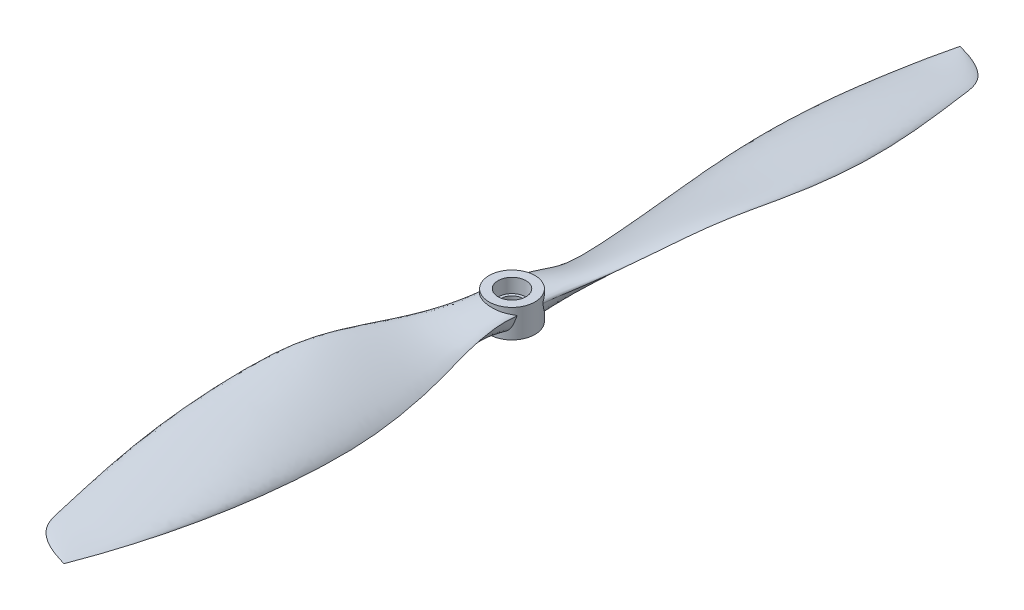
ISO-10303-21;
HEADER;
FILE_DESCRIPTION(('STEP AP214'),'2;1');
FILE_NAME('part.step','',(''),(''),'','','');
FILE_SCHEMA(('AUTOMOTIVE_DESIGN { 1 0 10303 214 1 1 1 1 }'));
ENDSEC;
DATA;
#1=APPLICATION_CONTEXT('core data for automotive mechanical design processes');
#2=APPLICATION_PROTOCOL_DEFINITION('international standard','automotive_design',2000,#1);
#3=PRODUCT_CONTEXT('',#1,'mechanical');
#4=PRODUCT('Part','Part','',(#3));
#5=PRODUCT_RELATED_PRODUCT_CATEGORY('part','',(#4));
#6=PRODUCT_DEFINITION_FORMATION('','',#4);
#7=PRODUCT_DEFINITION_CONTEXT('part definition',#1,'design');
#8=PRODUCT_DEFINITION('design','',#6,#7);
#9=PRODUCT_DEFINITION_SHAPE('','',#8);
#10=(LENGTH_UNIT() NAMED_UNIT(*) SI_UNIT(.MILLI.,.METRE.));
#11=(NAMED_UNIT(*) PLANE_ANGLE_UNIT() SI_UNIT($,.RADIAN.));
#12=(NAMED_UNIT(*) SI_UNIT($,.STERADIAN.) SOLID_ANGLE_UNIT());
#13=UNCERTAINTY_MEASURE_WITH_UNIT(LENGTH_MEASURE(1.E-05),#10,'distance_accuracy_value','');
#14=(GEOMETRIC_REPRESENTATION_CONTEXT(3) GLOBAL_UNCERTAINTY_ASSIGNED_CONTEXT((#13)) GLOBAL_UNIT_ASSIGNED_CONTEXT((#10,
#11,#12)) REPRESENTATION_CONTEXT('',''));
#15=CARTESIAN_POINT('',(0.,0.,0.));
#16=DIRECTION('',(0.,0.,1.));
#17=DIRECTION('',(1.,0.,0.));
#18=AXIS2_PLACEMENT_3D('',#15,#16,#17);
#19=CARTESIAN_POINT('',(0.,-4.32337971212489,0.));
#20=DIRECTION('',(0.,1.,0.));
#21=DIRECTION('',(0.,0.,1.));
#22=AXIS2_PLACEMENT_3D('',#19,#20,#21);
#23=CYLINDRICAL_SURFACE('',#22,3.175);
#24=CARTESIAN_POINT('',(0.,0.,0.));
#25=DIRECTION('',(0.,1.,0.));
#26=DIRECTION('',(0.,0.,1.));
#27=AXIS2_PLACEMENT_3D('',#24,#25,#26);
#28=CIRCLE('',#27,3.175);
#29=CARTESIAN_POINT('',(0.,0.,3.175));
#30=VERTEX_POINT('',#29);
#31=EDGE_CURVE('E146',#30,#30,#28,.F.);
#32=ORIENTED_EDGE('',*,*,#31,.F.);
#33=EDGE_LOOP('',(#32));
#34=FACE_BOUND('',#33,.T.);
#35=CARTESIAN_POINT('',(0.,-3.,0.));
#36=DIRECTION('',(0.,-1.,0.));
#37=DIRECTION('',(0.,0.,-1.));
#38=AXIS2_PLACEMENT_3D('',#35,#36,#37);
#39=CIRCLE('',#38,3.175);
#40=CARTESIAN_POINT('',(0.,-3.,-3.175));
#41=VERTEX_POINT('',#40);
#42=EDGE_CURVE('E111',#41,#41,#39,.F.);
#43=ORIENTED_EDGE('',*,*,#42,.F.);
#44=EDGE_LOOP('',(#43));
#45=FACE_BOUND('',#44,.T.);
#46=ADVANCED_FACE('F106',(#34,#45),#23,.F.);
#47=CARTESIAN_POINT('',(0.,4.,0.));
#48=DIRECTION('',(0.,-1.,0.));
#49=DIRECTION('',(0.,0.,-1.));
#50=AXIS2_PLACEMENT_3D('',#47,#48,#49);
#51=CYLINDRICAL_SURFACE('',#50,6.5);
#52=CARTESIAN_POINT('',(5.26041444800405,1.88128698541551,3.81811993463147));
#53=CARTESIAN_POINT('',(5.23874473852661,1.77479107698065,3.84796464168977));
#54=CARTESIAN_POINT('',(5.21698090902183,1.66820715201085,3.877425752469));
#55=CARTESIAN_POINT('',(5.17292076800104,1.45491772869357,3.93602055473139));
#56=CARTESIAN_POINT('',(5.15062385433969,1.34821223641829,3.96515381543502));
#57=CARTESIAN_POINT('',(5.10519218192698,1.13493595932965,4.02347794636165));
#58=CARTESIAN_POINT('',(5.0820570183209,1.02836526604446,4.05266883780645));
#59=CARTESIAN_POINT('',(5.03392131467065,0.812869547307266,4.11231637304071));
#60=CARTESIAN_POINT('',(5.00888789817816,0.703955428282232,4.14278618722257));
#61=CARTESIAN_POINT('',(4.95694859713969,0.486924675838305,4.20479447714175));
#62=CARTESIAN_POINT('',(4.93004347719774,0.378807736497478,4.2363325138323));
#63=CARTESIAN_POINT('',(4.87362672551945,0.163790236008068,4.30111737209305));
#64=CARTESIAN_POINT('',(4.84411574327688,0.0568893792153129,4.33436376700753));
#65=CARTESIAN_POINT('',(4.78401401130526,-0.146726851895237,4.40057360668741));
#66=CARTESIAN_POINT('',(4.75369219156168,-0.243580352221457,4.43335238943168));
#67=CARTESIAN_POINT('',(4.68911884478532,-0.43505416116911,4.50159695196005));
#68=CARTESIAN_POINT('',(4.6548665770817,-0.529674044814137,4.5370632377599));
#69=CARTESIAN_POINT('',(4.58159499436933,-0.715059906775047,4.61103917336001));
#70=CARTESIAN_POINT('',(4.54260796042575,-0.805846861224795,4.64952764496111));
#71=CARTESIAN_POINT('',(4.45853199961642,-0.982845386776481,4.73021006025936));
#72=CARTESIAN_POINT('',(4.41344604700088,-1.06905915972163,4.77240219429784));
#73=CARTESIAN_POINT('',(4.32901649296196,-1.21315192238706,4.84891061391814));
#74=CARTESIAN_POINT('',(4.2913315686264,-1.27247162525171,4.88233969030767));
#75=CARTESIAN_POINT('',(4.21174974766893,-1.38702239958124,4.95115450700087));
#76=CARTESIAN_POINT('',(4.16985335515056,-1.44225395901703,4.98654001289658));
#77=CARTESIAN_POINT('',(4.08172606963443,-1.5478920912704,5.05892846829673));
#78=CARTESIAN_POINT('',(4.03549960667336,-1.59830349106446,5.09592974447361));
#79=CARTESIAN_POINT('',(3.93871821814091,-1.69383160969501,5.17109758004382));
#80=CARTESIAN_POINT('',(3.88816327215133,-1.73894830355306,5.20926414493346));
#81=CARTESIAN_POINT('',(3.78297465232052,-1.82359677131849,5.2861464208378));
#82=CARTESIAN_POINT('',(3.72834128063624,-1.86312895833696,5.32486209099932));
#83=CARTESIAN_POINT('',(3.61538559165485,-1.93661388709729,5.40219135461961));
#84=CARTESIAN_POINT('',(3.55706315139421,-1.97056644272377,5.44080494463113));
#85=CARTESIAN_POINT('',(3.43707562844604,-2.03320923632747,5.51738937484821));
#86=CARTESIAN_POINT('',(3.37540413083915,-2.06188887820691,5.555358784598));
#87=CARTESIAN_POINT('',(3.24927890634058,-2.11434649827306,5.63005916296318));
#88=CARTESIAN_POINT('',(3.18482424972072,-2.1381228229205,5.6667897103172));
#89=CARTESIAN_POINT('',(3.01929823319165,-2.19256992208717,5.75732398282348));
#90=CARTESIAN_POINT('',(2.91667545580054,-2.22036114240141,5.81003167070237));
#91=CARTESIAN_POINT('',(2.70722256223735,-2.26775204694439,5.91053875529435));
#92=CARTESIAN_POINT('',(2.60039017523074,-2.28734724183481,5.95833545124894));
#93=CARTESIAN_POINT('',(2.38322296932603,-2.32014785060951,6.0484792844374));
#94=CARTESIAN_POINT('',(2.27288063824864,-2.3333384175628,6.09081359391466));
#95=CARTESIAN_POINT('',(2.04965198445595,-2.35475246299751,6.16951722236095));
#96=CARTESIAN_POINT('',(1.93676580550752,-2.362976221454,6.20588687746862));
#97=CARTESIAN_POINT('',(1.65588458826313,-2.37865511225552,6.28794796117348));
#98=CARTESIAN_POINT('',(1.48672256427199,-2.38396625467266,6.33008552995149));
#99=CARTESIAN_POINT('',(1.14545544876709,-2.38951643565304,6.40065046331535));
#100=CARTESIAN_POINT('',(0.97334918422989,-2.3897534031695,6.42907222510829));
#101=CARTESIAN_POINT('',(0.62745615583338,-2.38732749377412,6.47199060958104));
#102=CARTESIAN_POINT('',(0.453669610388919,-2.38466498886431,6.48648901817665));
#103=CARTESIAN_POINT('',(0.105550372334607,-2.37795018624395,6.50147745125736));
#104=CARTESIAN_POINT('',(-0.0687822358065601,-2.37389809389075,6.50196954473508));
#105=CARTESIAN_POINT('',(-0.419222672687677,-2.36449286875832,6.48886786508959));
#106=CARTESIAN_POINT('',(-0.595323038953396,-2.35912305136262,6.47508550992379));
#107=CARTESIAN_POINT('',(-0.945788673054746,-2.34694139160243,6.43324415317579));
#108=CARTESIAN_POINT('',(-1.12015375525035,-2.34012939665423,6.40518364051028));
#109=CARTESIAN_POINT('',(-1.46595072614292,-2.32445027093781,6.33499153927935));
#110=CARTESIAN_POINT('',(-1.63738235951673,-2.31558296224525,6.29285873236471));
#111=CARTESIAN_POINT('',(-1.97603750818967,-2.29434944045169,6.19486311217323));
#112=CARTESIAN_POINT('',(-2.14326191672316,-2.28198397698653,6.13900324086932));
#113=CARTESIAN_POINT('',(-2.43838525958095,-2.25477018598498,6.02692499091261));
#114=CARTESIAN_POINT('',(-2.56730654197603,-2.24095353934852,5.97313696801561));
#115=CARTESIAN_POINT('',(-2.82093789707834,-2.20846249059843,5.85762048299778));
#116=CARTESIAN_POINT('',(-2.94564790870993,-2.18978801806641,5.79589190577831));
#117=CARTESIAN_POINT('',(-3.18981163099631,-2.14601506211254,5.66517856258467));
#118=CARTESIAN_POINT('',(-3.30927295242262,-2.12092626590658,5.59620483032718));
#119=CARTESIAN_POINT('',(-3.54211194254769,-2.06244188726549,5.45180517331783));
#120=CARTESIAN_POINT('',(-3.65549188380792,-2.02904943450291,5.37638168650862));
#121=CARTESIAN_POINT('',(-3.84431518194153,-1.96270019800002,5.2422008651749));
#122=CARTESIAN_POINT('',(-3.92150877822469,-1.93222723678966,5.18467319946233));
#123=CARTESIAN_POINT('',(-4.07161397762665,-1.86516986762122,5.06764305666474));
#124=CARTESIAN_POINT('',(-4.14452689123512,-1.82858734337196,5.00814119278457));
#125=CARTESIAN_POINT('',(-4.28544314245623,-1.74874306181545,4.88810078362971));
#126=CARTESIAN_POINT('',(-4.35345520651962,-1.70549362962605,4.82756433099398));
#127=CARTESIAN_POINT('',(-4.48423482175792,-1.61184801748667,4.70633492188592));
#128=CARTESIAN_POINT('',(-4.54700248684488,-1.56145199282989,4.64564196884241));
#129=CARTESIAN_POINT('',(-4.66726427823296,-1.45309276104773,4.52481539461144));
#130=CARTESIAN_POINT('',(-4.72472611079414,-1.3950878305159,4.46468697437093));
#131=CARTESIAN_POINT('',(-4.83377184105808,-1.2719922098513,4.34639223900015));
#132=CARTESIAN_POINT('',(-4.88535582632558,-1.20690162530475,4.28822589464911));
#133=CARTESIAN_POINT('',(-4.98273056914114,-1.07015601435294,4.17468559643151));
#134=CARTESIAN_POINT('',(-5.02851606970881,-0.99849513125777,4.11931420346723));
#135=CARTESIAN_POINT('',(-5.11451064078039,-0.849467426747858,4.0120454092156));
#136=CARTESIAN_POINT('',(-5.15471895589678,-0.7720998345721,3.9601484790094));
#137=CARTESIAN_POINT('',(-5.24167359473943,-0.587810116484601,3.84468371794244));
#138=CARTESIAN_POINT('',(-5.2865816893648,-0.479162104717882,3.78248630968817));
#139=CARTESIAN_POINT('',(-5.36881533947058,-0.255543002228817,3.66482959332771));
#140=CARTESIAN_POINT('',(-5.4061373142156,-0.140568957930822,3.60937347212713));
#141=CARTESIAN_POINT('',(-5.47461631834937,0.0945746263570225,3.50464089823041));
#142=CARTESIAN_POINT('',(-5.50574424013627,0.214765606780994,3.45539400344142));
#143=CARTESIAN_POINT('',(-5.56278038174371,0.458541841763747,3.36279950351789));
#144=CARTESIAN_POINT('',(-5.58868948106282,0.582126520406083,3.31945090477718));
#145=CARTESIAN_POINT('',(-5.64654681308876,0.885489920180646,3.22041892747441));
#146=CARTESIAN_POINT('',(-5.67629813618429,1.06657157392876,3.16745157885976));
#147=CARTESIAN_POINT('',(-5.71601481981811,1.33950841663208,3.09481892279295));
#148=CARTESIAN_POINT('',(-5.72837837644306,1.43018439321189,3.07185664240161));
#149=CARTESIAN_POINT('',(-5.75175630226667,1.6121584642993,3.02785710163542));
#150=CARTESIAN_POINT('',(-5.76277092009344,1.7034564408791,3.00681948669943));
#151=CARTESIAN_POINT('',(-5.77321444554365,1.79501180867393,2.98663606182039));
#152=B_SPLINE_CURVE_WITH_KNOTS('',3,(#52,#53,#54,#55,#56,#57,#58,#59,#60,#61,#62,#63,#64,#65,
#66,#67,#68,#69,#70,#71,#72,#73,#74,#75,#76,#77,#78,#79,#80,#81,#82,#83,#84,#85,#86,#87,#88,#89,
#90,#91,#92,#93,#94,#95,#96,#97,#98,#99,#100,#101,#102,#103,#104,#105,#106,#107,#108,#109,#110,
#111,#112,#113,#114,#115,#116,#117,#118,#119,#120,#121,#122,#123,#124,#125,#126,#127,#128,#129,
#130,#131,#132,#133,#134,#135,#136,#137,#138,#139,#140,#141,#142,#143,#144,#145,#146,#147,#148,
#149,#150,#151),.UNSPECIFIED.,.F.,.F.,(4,2,2,2,2,2,2,2,2,2,2,2,2,2,2,2,2,2,2,2,2,2,2,2,2,2,2,2,
2,2,2,2,2,2,2,2,2,2,2,2,2,2,2,2,2,2,2,2,2,4),(0.,0.338104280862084,0.676610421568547,
1.01528229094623,1.362767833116,1.71011224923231,2.0573703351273,2.37722828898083,
2.69714661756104,3.01499480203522,3.3326885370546,3.56594472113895,3.7991730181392,
4.03216525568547,4.2651585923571,4.49813468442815,4.73111854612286,4.96456559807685,
5.19809124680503,5.5535145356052,5.90913225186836,6.26557045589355,6.62198856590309,
7.14449631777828,7.6672173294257,8.1898712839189,8.71244803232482,9.24201778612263,
9.77164359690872,10.301315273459,10.830873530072,11.2516596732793,11.6724519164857,
12.0926123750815,12.5126147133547,12.815296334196,13.1178848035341,13.4199204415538,
13.7219495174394,14.0257100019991,14.3294659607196,14.6334953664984,14.9375659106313,
15.3359147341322,15.7344511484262,16.1348183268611,16.5351179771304,17.1076239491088,
17.3906589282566,17.6736416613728),.UNSPECIFIED.);
#153=CARTESIAN_POINT('',(5.26041444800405,1.88128698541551,3.81811993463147));
#154=VERTEX_POINT('',#153);
#155=CARTESIAN_POINT('',(-5.77321444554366,1.79501180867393,2.98663606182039));
#156=VERTEX_POINT('',#155);
#157=EDGE_CURVE('E116',#154,#156,#152,.T.);
#158=ORIENTED_EDGE('',*,*,#157,.T.);
#159=CARTESIAN_POINT('',(-5.77321444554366,1.79501180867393,2.98663606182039));
#160=CARTESIAN_POINT('',(-5.77405253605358,1.80227376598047,2.98501592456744));
#161=CARTESIAN_POINT('',(-5.77475841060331,1.80960683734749,2.98364990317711));
#162=CARTESIAN_POINT('',(-5.7758868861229,1.82437875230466,2.98146478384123));
#163=CARTESIAN_POINT('',(-5.77630934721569,1.83181764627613,2.98064595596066));
#164=CARTESIAN_POINT('',(-5.77711803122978,1.85411083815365,2.9790786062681));
#165=CARTESIAN_POINT('',(-5.77705920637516,1.86905631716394,2.97919275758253));
#166=CARTESIAN_POINT('',(-5.7757320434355,1.8984152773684,2.98176474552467));
#167=CARTESIAN_POINT('',(-5.77448469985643,1.91283348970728,2.98418190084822));
#168=CARTESIAN_POINT('',(-5.77093003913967,1.94103628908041,2.99105018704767));
#169=CARTESIAN_POINT('',(-5.76862187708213,1.95482036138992,2.9955029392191));
#170=CARTESIAN_POINT('',(-5.76183360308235,1.98787387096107,3.00854598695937));
#171=CARTESIAN_POINT('',(-5.7568425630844,2.0066530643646,3.01809712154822));
#172=CARTESIAN_POINT('',(-5.74553076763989,2.04237408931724,3.03957633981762));
#173=CARTESIAN_POINT('',(-5.73920514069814,2.05930883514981,3.05151312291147));
#174=CARTESIAN_POINT('',(-5.72411827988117,2.09515423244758,3.0797368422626));
#175=CARTESIAN_POINT('',(-5.71512834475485,2.11366522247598,3.09640058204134));
#176=CARTESIAN_POINT('',(-5.69618262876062,2.14881702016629,3.13111753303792));
#177=CARTESIAN_POINT('',(-5.68622508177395,2.16545428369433,3.14917327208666));
#178=CARTESIAN_POINT('',(-5.66554019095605,2.197322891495,3.18623714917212));
#179=CARTESIAN_POINT('',(-5.65480928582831,2.21254688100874,3.20524955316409));
#180=CARTESIAN_POINT('',(-5.63277251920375,2.24178805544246,3.24381991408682));
#181=CARTESIAN_POINT('',(-5.62146714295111,2.25580623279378,3.26337740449));
#182=CARTESIAN_POINT('',(-5.59046714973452,2.29213020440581,3.31634684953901));
#183=CARTESIAN_POINT('',(-5.57031797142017,2.31355487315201,3.35009539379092));
#184=CARTESIAN_POINT('',(-5.52885301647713,2.35439915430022,3.41809516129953));
#185=CARTESIAN_POINT('',(-5.50753660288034,2.37381765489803,3.45234665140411));
#186=CARTESIAN_POINT('',(-5.46383394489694,2.41111117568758,3.5211050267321));
#187=CARTESIAN_POINT('',(-5.44144589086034,2.42898343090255,3.55561225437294));
#188=CARTESIAN_POINT('',(-5.39571280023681,2.46344080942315,3.6246378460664));
#189=CARTESIAN_POINT('',(-5.37236762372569,2.48002574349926,3.65915621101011));
#190=CARTESIAN_POINT('',(-5.30093282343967,2.52819928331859,3.76259621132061));
#191=CARTESIAN_POINT('',(-5.25148483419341,2.55817277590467,3.83133820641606));
#192=CARTESIAN_POINT('',(-5.14930688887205,2.6147871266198,3.9676060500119));
#193=CARTESIAN_POINT('',(-5.09657995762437,2.6414309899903,4.03513294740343));
#194=CARTESIAN_POINT('',(-4.9446187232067,2.71217056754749,4.22192558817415));
#195=CARTESIAN_POINT('',(-4.84184142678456,2.75323048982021,4.33948770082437));
#196=CARTESIAN_POINT('',(-4.62677562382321,2.82824889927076,4.56810968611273));
#197=CARTESIAN_POINT('',(-4.51448003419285,2.86220203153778,4.67916461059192));
#198=CARTESIAN_POINT('',(-4.28124646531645,2.92371594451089,4.89346279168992));
#199=CARTESIAN_POINT('',(-4.16031733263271,2.95128314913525,4.99671382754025));
#200=CARTESIAN_POINT('',(-3.91049455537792,3.00053708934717,5.1945567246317));
#201=CARTESIAN_POINT('',(-3.78160268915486,3.02222513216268,5.28915050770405));
#202=CARTESIAN_POINT('',(-3.51450643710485,3.06037876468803,5.47034753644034));
#203=CARTESIAN_POINT('',(-3.37618590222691,3.07675507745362,5.55679840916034));
#204=CARTESIAN_POINT('',(-3.09302323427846,3.10413200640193,5.71925290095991));
#205=CARTESIAN_POINT('',(-2.94818070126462,3.11513229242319,5.79525587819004));
#206=CARTESIAN_POINT('',(-2.65289178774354,3.13209028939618,5.93623963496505));
#207=CARTESIAN_POINT('',(-2.502443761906,3.1380465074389,6.00121714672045));
#208=CARTESIAN_POINT('',(-2.19697258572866,3.14525228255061,6.11965270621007));
#209=CARTESIAN_POINT('',(-2.04194935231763,3.14650175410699,6.17311054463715));
#210=CARTESIAN_POINT('',(-1.72281310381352,3.1446274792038,6.26982305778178));
#211=CARTESIAN_POINT('',(-1.55857213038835,3.14134843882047,6.31265294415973));
#212=CARTESIAN_POINT('',(-1.2273906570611,3.13040611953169,6.38531584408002));
#213=CARTESIAN_POINT('',(-1.0604501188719,3.12274277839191,6.41514867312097));
#214=CARTESIAN_POINT('',(-0.724978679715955,3.10323693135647,6.46166164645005));
#215=CARTESIAN_POINT('',(-0.556447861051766,3.09139464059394,6.47834246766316));
#216=CARTESIAN_POINT('',(-0.303350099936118,3.07061352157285,6.49346826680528));
#217=CARTESIAN_POINT('',(-0.218925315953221,3.06318262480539,6.49686080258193));
#218=CARTESIAN_POINT('',(-0.0500990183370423,3.04733543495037,6.50035528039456));
#219=CARTESIAN_POINT('',(0.0343024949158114,3.03891912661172,6.50045717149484));
#220=CARTESIAN_POINT('',(0.292139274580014,3.01185842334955,6.49574911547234));
#221=CARTESIAN_POINT('',(0.465360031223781,2.9918082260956,6.48563204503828));
#222=CARTESIAN_POINT('',(0.810072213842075,2.94887525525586,6.45165022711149));
#223=CARTESIAN_POINT('',(0.981563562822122,2.92599235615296,6.42778487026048));
#224=CARTESIAN_POINT('',(1.32188712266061,2.87807739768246,6.36651522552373));
#225=CARTESIAN_POINT('',(1.49071814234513,2.85304440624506,6.32910504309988));
#226=CARTESIAN_POINT('',(1.82470968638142,2.80137635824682,6.24101581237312));
#227=CARTESIAN_POINT('',(1.98986850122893,2.77474057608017,6.19033071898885));
#228=CARTESIAN_POINT('',(2.32375576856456,2.71888914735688,6.07314034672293));
#229=CARTESIAN_POINT('',(2.49223746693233,2.68961119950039,6.00596069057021));
#230=CARTESIAN_POINT('',(2.82278023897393,2.63002847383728,5.85787455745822));
#231=CARTESIAN_POINT('',(2.98484390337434,2.59972411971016,5.77697369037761));
#232=CARTESIAN_POINT('',(3.3013253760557,2.53816394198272,5.6021332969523));
#233=CARTESIAN_POINT('',(3.45575201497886,2.50690928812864,5.50820933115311));
#234=CARTESIAN_POINT('',(3.75601794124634,2.44319529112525,5.30799952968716));
#235=CARTESIAN_POINT('',(3.90186144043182,2.41073655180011,5.20171983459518));
#236=CARTESIAN_POINT('',(4.13439542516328,2.35558693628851,5.01701577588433));
#237=CARTESIAN_POINT('',(4.22388020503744,2.33346659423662,4.94190833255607));
#238=CARTESIAN_POINT('',(4.39839886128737,2.28797523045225,4.78723879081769));
#239=CARTESIAN_POINT('',(4.48343802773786,2.26460576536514,4.70768223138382));
#240=CARTESIAN_POINT('',(4.61967003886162,2.22432797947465,4.57321715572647));
#241=CARTESIAN_POINT('',(4.67223150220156,2.20804420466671,4.51950025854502));
#242=CARTESIAN_POINT('',(4.77534341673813,2.17409260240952,4.41041173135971));
#243=CARTESIAN_POINT('',(4.82589057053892,2.15642263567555,4.35503762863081));
#244=CARTESIAN_POINT('',(4.90597886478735,2.12593324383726,4.26421483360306));
#245=CARTESIAN_POINT('',(4.93622966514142,2.11380913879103,4.22915690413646));
#246=CARTESIAN_POINT('',(4.9956158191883,2.08832692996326,4.15883721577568));
#247=CARTESIAN_POINT('',(5.0247557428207,2.07497488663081,4.12357718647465));
#248=CARTESIAN_POINT('',(5.07065971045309,2.05182261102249,4.06683810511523));
#249=CARTESIAN_POINT('',(5.08779003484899,2.04268662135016,4.04538478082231));
#250=CARTESIAN_POINT('',(5.12175890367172,2.02315432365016,4.0022925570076));
#251=CARTESIAN_POINT('',(5.1385907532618,2.01274316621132,3.98065487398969));
#252=CARTESIAN_POINT('',(5.16342579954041,1.99559773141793,3.94831915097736));
#253=CARTESIAN_POINT('',(5.17170761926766,1.98956668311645,3.93746404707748));
#254=CARTESIAN_POINT('',(5.18803584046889,1.97680519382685,3.91592474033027));
#255=CARTESIAN_POINT('',(5.19608155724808,1.97007293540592,3.9052410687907));
#256=CARTESIAN_POINT('',(5.21157992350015,1.95580837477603,3.8845331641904));
#257=CARTESIAN_POINT('',(5.21904256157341,1.94830147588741,3.874499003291));
#258=CARTESIAN_POINT('',(5.23332330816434,1.93186775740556,3.85518713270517));
#259=CARTESIAN_POINT('',(5.24014484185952,1.92294925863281,3.84590544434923));
#260=CARTESIAN_POINT('',(5.24903958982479,1.90819368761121,3.8337456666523));
#261=CARTESIAN_POINT('',(5.25167096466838,1.90333490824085,3.83013935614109));
#262=CARTESIAN_POINT('',(5.25646904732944,1.89288860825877,3.82355214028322));
#263=CARTESIAN_POINT('',(5.25862759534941,1.88729061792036,3.82058223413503));
#264=CARTESIAN_POINT('',(5.26041444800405,1.88128698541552,3.81811993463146));
#265=B_SPLINE_CURVE_WITH_KNOTS('',3,(#159,#160,#161,#162,#163,#164,#165,#166,#167,#168,#169,
#170,#171,#172,#173,#174,#175,#176,#177,#178,#179,#180,#181,#182,#183,#184,#185,#186,#187,#188,
#189,#190,#191,#192,#193,#194,#195,#196,#197,#198,#199,#200,#201,#202,#203,#204,#205,#206,#207,
#208,#209,#210,#211,#212,#213,#214,#215,#216,#217,#218,#219,#220,#221,#222,#223,#224,#225,#226,
#227,#228,#229,#230,#231,#232,#233,#234,#235,#236,#237,#238,#239,#240,#241,#242,#243,#244,#245,
#246,#247,#248,#249,#250,#251,#252,#253,#254,#255,#256,#257,#258,#259,#260,#261,#262,#263,#264),
.UNSPECIFIED.,.F.,.F.,(4,2,2,2,2,2,2,2,2,2,2,2,2,2,2,2,2,2,2,2,2,2,2,2,2,2,2,2,2,2,2,2,2,2,2,2,
2,2,2,2,2,2,2,2,2,2,2,2,2,2,2,2,4),(0.,0.0224535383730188,0.0449181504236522,0.0894967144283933,
0.13330214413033,0.177142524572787,0.241724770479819,0.306546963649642,0.385802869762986,
0.465206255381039,0.545002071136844,0.624731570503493,0.758932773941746,0.893207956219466,
1.02771848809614,1.16224875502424,1.43155954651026,1.7006254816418,2.18435719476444,
2.66845209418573,3.15205788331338,3.63555605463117,4.12680372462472,4.61808156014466,
5.10950474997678,5.60093686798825,6.10964630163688,6.61836295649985,7.12705342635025,
7.38145045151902,7.63585141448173,8.15922726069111,8.68262630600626,9.20625340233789,
9.73011936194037,10.2806719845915,10.8310000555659,11.3806761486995,11.9300802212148,
12.2866390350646,12.6427634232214,12.8734145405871,13.1044288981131,13.2480094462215,
13.3909159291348,13.4777035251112,13.56562014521,13.6103879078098,13.6552747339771,
13.6989925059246,13.7424615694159,13.76218344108,13.7822227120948),.UNSPECIFIED.);
#266=EDGE_CURVE('E13',#156,#154,#265,.T.);
#267=ORIENTED_EDGE('',*,*,#266,.T.);
#268=EDGE_LOOP('',(#158,#267));
#269=FACE_BOUND('',#268,.T.);
#270=CARTESIAN_POINT('',(-5.26041444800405,1.88128698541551,-3.81811993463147));
#271=CARTESIAN_POINT('',(-5.23874473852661,1.77479107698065,-3.84796464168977));
#272=CARTESIAN_POINT('',(-5.21698090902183,1.66820715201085,-3.877425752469));
#273=CARTESIAN_POINT('',(-5.17292076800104,1.45491772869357,-3.93602055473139));
#274=CARTESIAN_POINT('',(-5.15062385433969,1.34821223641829,-3.96515381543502));
#275=CARTESIAN_POINT('',(-5.10519218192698,1.13493595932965,-4.02347794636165));
#276=CARTESIAN_POINT('',(-5.0820570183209,1.02836526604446,-4.05266883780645));
#277=CARTESIAN_POINT('',(-5.03392131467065,0.812869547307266,-4.11231637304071));
#278=CARTESIAN_POINT('',(-5.00888789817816,0.703955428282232,-4.14278618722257));
#279=CARTESIAN_POINT('',(-4.95694859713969,0.486924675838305,-4.20479447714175));
#280=CARTESIAN_POINT('',(-4.93004347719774,0.378807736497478,-4.2363325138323));
#281=CARTESIAN_POINT('',(-4.87362672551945,0.163790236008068,-4.30111737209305));
#282=CARTESIAN_POINT('',(-4.84411574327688,0.0568893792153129,-4.33436376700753));
#283=CARTESIAN_POINT('',(-4.78401401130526,-0.146726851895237,-4.40057360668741));
#284=CARTESIAN_POINT('',(-4.75369219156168,-0.243580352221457,-4.43335238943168));
#285=CARTESIAN_POINT('',(-4.68911884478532,-0.43505416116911,-4.50159695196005));
#286=CARTESIAN_POINT('',(-4.6548665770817,-0.529674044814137,-4.5370632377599));
#287=CARTESIAN_POINT('',(-4.58159499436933,-0.715059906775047,-4.61103917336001));
#288=CARTESIAN_POINT('',(-4.54260796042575,-0.805846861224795,-4.64952764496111));
#289=CARTESIAN_POINT('',(-4.45853199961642,-0.982845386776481,-4.73021006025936));
#290=CARTESIAN_POINT('',(-4.41344604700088,-1.06905915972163,-4.77240219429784));
#291=CARTESIAN_POINT('',(-4.32901649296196,-1.21315192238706,-4.84891061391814));
#292=CARTESIAN_POINT('',(-4.2913315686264,-1.27247162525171,-4.88233969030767));
#293=CARTESIAN_POINT('',(-4.21174974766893,-1.38702239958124,-4.95115450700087));
#294=CARTESIAN_POINT('',(-4.16985335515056,-1.44225395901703,-4.98654001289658));
#295=CARTESIAN_POINT('',(-4.08172606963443,-1.5478920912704,-5.05892846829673));
#296=CARTESIAN_POINT('',(-4.03549960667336,-1.59830349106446,-5.09592974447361));
#297=CARTESIAN_POINT('',(-3.93871821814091,-1.69383160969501,-5.17109758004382));
#298=CARTESIAN_POINT('',(-3.88816327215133,-1.73894830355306,-5.20926414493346));
#299=CARTESIAN_POINT('',(-3.78297465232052,-1.82359677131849,-5.2861464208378));
#300=CARTESIAN_POINT('',(-3.72834128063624,-1.86312895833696,-5.32486209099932));
#301=CARTESIAN_POINT('',(-3.61538559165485,-1.93661388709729,-5.40219135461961));
#302=CARTESIAN_POINT('',(-3.55706315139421,-1.97056644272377,-5.44080494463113));
#303=CARTESIAN_POINT('',(-3.43707562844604,-2.03320923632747,-5.51738937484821));
#304=CARTESIAN_POINT('',(-3.37540413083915,-2.06188887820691,-5.555358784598));
#305=CARTESIAN_POINT('',(-3.24927890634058,-2.11434649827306,-5.63005916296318));
#306=CARTESIAN_POINT('',(-3.18482424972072,-2.1381228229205,-5.6667897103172));
#307=CARTESIAN_POINT('',(-3.01929823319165,-2.19256992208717,-5.75732398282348));
#308=CARTESIAN_POINT('',(-2.91667545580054,-2.22036114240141,-5.81003167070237));
#309=CARTESIAN_POINT('',(-2.70722256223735,-2.26775204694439,-5.91053875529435));
#310=CARTESIAN_POINT('',(-2.60039017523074,-2.28734724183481,-5.95833545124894));
#311=CARTESIAN_POINT('',(-2.38322296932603,-2.32014785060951,-6.0484792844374));
#312=CARTESIAN_POINT('',(-2.27288063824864,-2.3333384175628,-6.09081359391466));
#313=CARTESIAN_POINT('',(-2.04965198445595,-2.35475246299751,-6.16951722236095));
#314=CARTESIAN_POINT('',(-1.93676580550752,-2.362976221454,-6.20588687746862));
#315=CARTESIAN_POINT('',(-1.65588458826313,-2.37865511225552,-6.28794796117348));
#316=CARTESIAN_POINT('',(-1.48672256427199,-2.38396625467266,-6.33008552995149));
#317=CARTESIAN_POINT('',(-1.14545544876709,-2.38951643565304,-6.40065046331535));
#318=CARTESIAN_POINT('',(-0.97334918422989,-2.3897534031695,-6.42907222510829));
#319=CARTESIAN_POINT('',(-0.62745615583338,-2.38732749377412,-6.47199060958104));
#320=CARTESIAN_POINT('',(-0.453669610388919,-2.38466498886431,-6.48648901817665));
#321=CARTESIAN_POINT('',(-0.105550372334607,-2.37795018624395,-6.50147745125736));
#322=CARTESIAN_POINT('',(0.0687822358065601,-2.37389809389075,-6.50196954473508));
#323=CARTESIAN_POINT('',(0.419222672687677,-2.36449286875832,-6.48886786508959));
#324=CARTESIAN_POINT('',(0.595323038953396,-2.35912305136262,-6.47508550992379));
#325=CARTESIAN_POINT('',(0.945788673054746,-2.34694139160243,-6.43324415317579));
#326=CARTESIAN_POINT('',(1.12015375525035,-2.34012939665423,-6.40518364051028));
#327=CARTESIAN_POINT('',(1.46595072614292,-2.32445027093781,-6.33499153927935));
#328=CARTESIAN_POINT('',(1.63738235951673,-2.31558296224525,-6.29285873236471));
#329=CARTESIAN_POINT('',(1.97603750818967,-2.29434944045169,-6.19486311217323));
#330=CARTESIAN_POINT('',(2.14326191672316,-2.28198397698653,-6.13900324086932));
#331=CARTESIAN_POINT('',(2.43838525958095,-2.25477018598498,-6.02692499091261));
#332=CARTESIAN_POINT('',(2.56730654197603,-2.24095353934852,-5.97313696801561));
#333=CARTESIAN_POINT('',(2.82093789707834,-2.20846249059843,-5.85762048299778));
#334=CARTESIAN_POINT('',(2.94564790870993,-2.18978801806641,-5.79589190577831));
#335=CARTESIAN_POINT('',(3.18981163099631,-2.14601506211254,-5.66517856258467));
#336=CARTESIAN_POINT('',(3.30927295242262,-2.12092626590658,-5.59620483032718));
#337=CARTESIAN_POINT('',(3.54211194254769,-2.06244188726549,-5.45180517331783));
#338=CARTESIAN_POINT('',(3.65549188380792,-2.02904943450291,-5.37638168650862));
#339=CARTESIAN_POINT('',(3.84431518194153,-1.96270019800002,-5.2422008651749));
#340=CARTESIAN_POINT('',(3.92150877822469,-1.93222723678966,-5.18467319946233));
#341=CARTESIAN_POINT('',(4.07161397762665,-1.86516986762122,-5.06764305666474));
#342=CARTESIAN_POINT('',(4.14452689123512,-1.82858734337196,-5.00814119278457));
#343=CARTESIAN_POINT('',(4.28544314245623,-1.74874306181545,-4.88810078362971));
#344=CARTESIAN_POINT('',(4.35345520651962,-1.70549362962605,-4.82756433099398));
#345=CARTESIAN_POINT('',(4.48423482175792,-1.61184801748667,-4.70633492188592));
#346=CARTESIAN_POINT('',(4.54700248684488,-1.56145199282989,-4.64564196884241));
#347=CARTESIAN_POINT('',(4.66726427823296,-1.45309276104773,-4.52481539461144));
#348=CARTESIAN_POINT('',(4.72472611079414,-1.3950878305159,-4.46468697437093));
#349=CARTESIAN_POINT('',(4.83377184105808,-1.2719922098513,-4.34639223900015));
#350=CARTESIAN_POINT('',(4.88535582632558,-1.20690162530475,-4.28822589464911));
#351=CARTESIAN_POINT('',(4.98273056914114,-1.07015601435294,-4.17468559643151));
#352=CARTESIAN_POINT('',(5.02851606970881,-0.99849513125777,-4.11931420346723));
#353=CARTESIAN_POINT('',(5.11451064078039,-0.849467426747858,-4.0120454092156));
#354=CARTESIAN_POINT('',(5.15471895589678,-0.7720998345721,-3.9601484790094));
#355=CARTESIAN_POINT('',(5.24167359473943,-0.587810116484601,-3.84468371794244));
#356=CARTESIAN_POINT('',(5.2865816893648,-0.479162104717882,-3.78248630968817));
#357=CARTESIAN_POINT('',(5.36881533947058,-0.255543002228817,-3.66482959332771));
#358=CARTESIAN_POINT('',(5.4061373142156,-0.140568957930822,-3.60937347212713));
#359=CARTESIAN_POINT('',(5.47461631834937,0.0945746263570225,-3.50464089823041));
#360=CARTESIAN_POINT('',(5.50574424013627,0.214765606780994,-3.45539400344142));
#361=CARTESIAN_POINT('',(5.56278038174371,0.458541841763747,-3.36279950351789));
#362=CARTESIAN_POINT('',(5.58868948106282,0.582126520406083,-3.31945090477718));
#363=CARTESIAN_POINT('',(5.64654681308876,0.885489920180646,-3.22041892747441));
#364=CARTESIAN_POINT('',(5.67629813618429,1.06657157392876,-3.16745157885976));
#365=CARTESIAN_POINT('',(5.71601481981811,1.33950841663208,-3.09481892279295));
#366=CARTESIAN_POINT('',(5.72837837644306,1.43018439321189,-3.07185664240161));
#367=CARTESIAN_POINT('',(5.75175630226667,1.6121584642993,-3.02785710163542));
#368=CARTESIAN_POINT('',(5.76277092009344,1.7034564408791,-3.00681948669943));
#369=CARTESIAN_POINT('',(5.77321444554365,1.79501180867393,-2.98663606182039));
#370=B_SPLINE_CURVE_WITH_KNOTS('',3,(#270,#271,#272,#273,#274,#275,#276,#277,#278,#279,#280,
#281,#282,#283,#284,#285,#286,#287,#288,#289,#290,#291,#292,#293,#294,#295,#296,#297,#298,#299,
#300,#301,#302,#303,#304,#305,#306,#307,#308,#309,#310,#311,#312,#313,#314,#315,#316,#317,#318,
#319,#320,#321,#322,#323,#324,#325,#326,#327,#328,#329,#330,#331,#332,#333,#334,#335,#336,#337,
#338,#339,#340,#341,#342,#343,#344,#345,#346,#347,#348,#349,#350,#351,#352,#353,#354,#355,#356,
#357,#358,#359,#360,#361,#362,#363,#364,#365,#366,#367,#368,#369),.UNSPECIFIED.,.F.,.F.,(4,2,2,
2,2,2,2,2,2,2,2,2,2,2,2,2,2,2,2,2,2,2,2,2,2,2,2,2,2,2,2,2,2,2,2,2,2,2,2,2,2,2,2,2,2,2,2,2,2,4),
(0.,0.338104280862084,0.676610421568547,1.01528229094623,1.362767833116,1.71011224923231,
2.0573703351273,2.37722828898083,2.69714661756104,3.01499480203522,3.3326885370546,
3.56594472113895,3.7991730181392,4.03216525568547,4.2651585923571,4.49813468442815,
4.73111854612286,4.96456559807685,5.19809124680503,5.5535145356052,5.90913225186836,
6.26557045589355,6.62198856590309,7.14449631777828,7.6672173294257,8.1898712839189,
8.71244803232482,9.24201778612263,9.77164359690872,10.301315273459,10.830873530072,
11.2516596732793,11.6724519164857,12.0926123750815,12.5126147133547,12.815296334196,
13.1178848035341,13.4199204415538,13.7219495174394,14.0257100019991,14.3294659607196,
14.6334953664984,14.9375659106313,15.3359147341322,15.7344511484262,16.1348183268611,
16.5351179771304,17.1076239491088,17.3906589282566,17.6736416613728),.UNSPECIFIED.);
#371=CARTESIAN_POINT('',(-5.26041444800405,1.88128698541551,-3.81811993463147));
#372=VERTEX_POINT('',#371);
#373=CARTESIAN_POINT('',(5.77321444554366,1.79501180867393,-2.98663606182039));
#374=VERTEX_POINT('',#373);
#375=EDGE_CURVE('E190',#372,#374,#370,.T.);
#376=ORIENTED_EDGE('',*,*,#375,.T.);
#377=CARTESIAN_POINT('',(5.77321444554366,1.79501180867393,-2.98663606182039));
#378=CARTESIAN_POINT('',(5.77405253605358,1.80227376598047,-2.98501592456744));
#379=CARTESIAN_POINT('',(5.77475841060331,1.80960683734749,-2.98364990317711));
#380=CARTESIAN_POINT('',(5.7758868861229,1.82437875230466,-2.98146478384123));
#381=CARTESIAN_POINT('',(5.77630934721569,1.83181764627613,-2.98064595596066));
#382=CARTESIAN_POINT('',(5.77711803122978,1.85411083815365,-2.9790786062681));
#383=CARTESIAN_POINT('',(5.77705920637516,1.86905631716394,-2.97919275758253));
#384=CARTESIAN_POINT('',(5.7757320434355,1.8984152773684,-2.98176474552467));
#385=CARTESIAN_POINT('',(5.77448469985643,1.91283348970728,-2.98418190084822));
#386=CARTESIAN_POINT('',(5.77093003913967,1.94103628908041,-2.99105018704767));
#387=CARTESIAN_POINT('',(5.76862187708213,1.95482036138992,-2.9955029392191));
#388=CARTESIAN_POINT('',(5.76183360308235,1.98787387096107,-3.00854598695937));
#389=CARTESIAN_POINT('',(5.7568425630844,2.0066530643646,-3.01809712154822));
#390=CARTESIAN_POINT('',(5.74553076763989,2.04237408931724,-3.03957633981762));
#391=CARTESIAN_POINT('',(5.73920514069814,2.05930883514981,-3.05151312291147));
#392=CARTESIAN_POINT('',(5.72411827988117,2.09515423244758,-3.0797368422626));
#393=CARTESIAN_POINT('',(5.71512834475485,2.11366522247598,-3.09640058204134));
#394=CARTESIAN_POINT('',(5.69618262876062,2.14881702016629,-3.13111753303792));
#395=CARTESIAN_POINT('',(5.68622508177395,2.16545428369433,-3.14917327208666));
#396=CARTESIAN_POINT('',(5.66554019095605,2.197322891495,-3.18623714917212));
#397=CARTESIAN_POINT('',(5.65480928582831,2.21254688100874,-3.20524955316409));
#398=CARTESIAN_POINT('',(5.63277251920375,2.24178805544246,-3.24381991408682));
#399=CARTESIAN_POINT('',(5.62146714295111,2.25580623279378,-3.26337740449));
#400=CARTESIAN_POINT('',(5.59046714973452,2.29213020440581,-3.31634684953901));
#401=CARTESIAN_POINT('',(5.57031797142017,2.31355487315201,-3.35009539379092));
#402=CARTESIAN_POINT('',(5.52885301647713,2.35439915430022,-3.41809516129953));
#403=CARTESIAN_POINT('',(5.50753660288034,2.37381765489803,-3.45234665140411));
#404=CARTESIAN_POINT('',(5.46383394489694,2.41111117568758,-3.5211050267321));
#405=CARTESIAN_POINT('',(5.44144589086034,2.42898343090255,-3.55561225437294));
#406=CARTESIAN_POINT('',(5.39571280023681,2.46344080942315,-3.6246378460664));
#407=CARTESIAN_POINT('',(5.37236762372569,2.48002574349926,-3.65915621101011));
#408=CARTESIAN_POINT('',(5.30093282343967,2.52819928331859,-3.76259621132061));
#409=CARTESIAN_POINT('',(5.25148483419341,2.55817277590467,-3.83133820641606));
#410=CARTESIAN_POINT('',(5.14930688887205,2.6147871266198,-3.9676060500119));
#411=CARTESIAN_POINT('',(5.09657995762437,2.6414309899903,-4.03513294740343));
#412=CARTESIAN_POINT('',(4.9446187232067,2.71217056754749,-4.22192558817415));
#413=CARTESIAN_POINT('',(4.84184142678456,2.75323048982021,-4.33948770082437));
#414=CARTESIAN_POINT('',(4.62677562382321,2.82824889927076,-4.56810968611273));
#415=CARTESIAN_POINT('',(4.51448003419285,2.86220203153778,-4.67916461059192));
#416=CARTESIAN_POINT('',(4.28124646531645,2.92371594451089,-4.89346279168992));
#417=CARTESIAN_POINT('',(4.16031733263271,2.95128314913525,-4.99671382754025));
#418=CARTESIAN_POINT('',(3.91049455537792,3.00053708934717,-5.1945567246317));
#419=CARTESIAN_POINT('',(3.78160268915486,3.02222513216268,-5.28915050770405));
#420=CARTESIAN_POINT('',(3.51450643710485,3.06037876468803,-5.47034753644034));
#421=CARTESIAN_POINT('',(3.37618590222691,3.07675507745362,-5.55679840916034));
#422=CARTESIAN_POINT('',(3.09302323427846,3.10413200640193,-5.71925290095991));
#423=CARTESIAN_POINT('',(2.94818070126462,3.11513229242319,-5.79525587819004));
#424=CARTESIAN_POINT('',(2.65289178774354,3.13209028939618,-5.93623963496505));
#425=CARTESIAN_POINT('',(2.502443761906,3.1380465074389,-6.00121714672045));
#426=CARTESIAN_POINT('',(2.19697258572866,3.14525228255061,-6.11965270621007));
#427=CARTESIAN_POINT('',(2.04194935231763,3.14650175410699,-6.17311054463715));
#428=CARTESIAN_POINT('',(1.72281310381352,3.1446274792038,-6.26982305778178));
#429=CARTESIAN_POINT('',(1.55857213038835,3.14134843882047,-6.31265294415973));
#430=CARTESIAN_POINT('',(1.2273906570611,3.13040611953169,-6.38531584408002));
#431=CARTESIAN_POINT('',(1.0604501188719,3.12274277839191,-6.41514867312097));
#432=CARTESIAN_POINT('',(0.724978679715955,3.10323693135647,-6.46166164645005));
#433=CARTESIAN_POINT('',(0.556447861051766,3.09139464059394,-6.47834246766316));
#434=CARTESIAN_POINT('',(0.303350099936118,3.07061352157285,-6.49346826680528));
#435=CARTESIAN_POINT('',(0.218925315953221,3.06318262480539,-6.49686080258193));
#436=CARTESIAN_POINT('',(0.0500990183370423,3.04733543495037,-6.50035528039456));
#437=CARTESIAN_POINT('',(-0.0343024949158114,3.03891912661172,-6.50045717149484));
#438=CARTESIAN_POINT('',(-0.292139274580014,3.01185842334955,-6.49574911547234));
#439=CARTESIAN_POINT('',(-0.465360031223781,2.9918082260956,-6.48563204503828));
#440=CARTESIAN_POINT('',(-0.810072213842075,2.94887525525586,-6.45165022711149));
#441=CARTESIAN_POINT('',(-0.981563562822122,2.92599235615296,-6.42778487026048));
#442=CARTESIAN_POINT('',(-1.32188712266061,2.87807739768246,-6.36651522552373));
#443=CARTESIAN_POINT('',(-1.49071814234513,2.85304440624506,-6.32910504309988));
#444=CARTESIAN_POINT('',(-1.82470968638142,2.80137635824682,-6.24101581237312));
#445=CARTESIAN_POINT('',(-1.98986850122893,2.77474057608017,-6.19033071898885));
#446=CARTESIAN_POINT('',(-2.32375576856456,2.71888914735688,-6.07314034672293));
#447=CARTESIAN_POINT('',(-2.49223746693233,2.68961119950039,-6.00596069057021));
#448=CARTESIAN_POINT('',(-2.82278023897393,2.63002847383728,-5.85787455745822));
#449=CARTESIAN_POINT('',(-2.98484390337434,2.59972411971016,-5.77697369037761));
#450=CARTESIAN_POINT('',(-3.3013253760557,2.53816394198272,-5.6021332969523));
#451=CARTESIAN_POINT('',(-3.45575201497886,2.50690928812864,-5.50820933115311));
#452=CARTESIAN_POINT('',(-3.75601794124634,2.44319529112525,-5.30799952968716));
#453=CARTESIAN_POINT('',(-3.90186144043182,2.41073655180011,-5.20171983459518));
#454=CARTESIAN_POINT('',(-4.13439542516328,2.35558693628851,-5.01701577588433));
#455=CARTESIAN_POINT('',(-4.22388020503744,2.33346659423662,-4.94190833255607));
#456=CARTESIAN_POINT('',(-4.39839886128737,2.28797523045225,-4.78723879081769));
#457=CARTESIAN_POINT('',(-4.48343802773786,2.26460576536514,-4.70768223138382));
#458=CARTESIAN_POINT('',(-4.61967003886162,2.22432797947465,-4.57321715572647));
#459=CARTESIAN_POINT('',(-4.67223150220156,2.20804420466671,-4.51950025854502));
#460=CARTESIAN_POINT('',(-4.77534341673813,2.17409260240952,-4.41041173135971));
#461=CARTESIAN_POINT('',(-4.82589057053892,2.15642263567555,-4.35503762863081));
#462=CARTESIAN_POINT('',(-4.90597886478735,2.12593324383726,-4.26421483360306));
#463=CARTESIAN_POINT('',(-4.93622966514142,2.11380913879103,-4.22915690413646));
#464=CARTESIAN_POINT('',(-4.9956158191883,2.08832692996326,-4.15883721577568));
#465=CARTESIAN_POINT('',(-5.0247557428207,2.07497488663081,-4.12357718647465));
#466=CARTESIAN_POINT('',(-5.07065971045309,2.05182261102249,-4.06683810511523));
#467=CARTESIAN_POINT('',(-5.08779003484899,2.04268662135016,-4.04538478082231));
#468=CARTESIAN_POINT('',(-5.12175890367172,2.02315432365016,-4.0022925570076));
#469=CARTESIAN_POINT('',(-5.1385907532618,2.01274316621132,-3.98065487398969));
#470=CARTESIAN_POINT('',(-5.16342579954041,1.99559773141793,-3.94831915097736));
#471=CARTESIAN_POINT('',(-5.17170761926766,1.98956668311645,-3.93746404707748));
#472=CARTESIAN_POINT('',(-5.18803584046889,1.97680519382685,-3.91592474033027));
#473=CARTESIAN_POINT('',(-5.19608155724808,1.97007293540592,-3.9052410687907));
#474=CARTESIAN_POINT('',(-5.21157992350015,1.95580837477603,-3.8845331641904));
#475=CARTESIAN_POINT('',(-5.21904256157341,1.94830147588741,-3.874499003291));
#476=CARTESIAN_POINT('',(-5.23332330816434,1.93186775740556,-3.85518713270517));
#477=CARTESIAN_POINT('',(-5.24014484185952,1.92294925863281,-3.84590544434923));
#478=CARTESIAN_POINT('',(-5.24903958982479,1.90819368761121,-3.8337456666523));
#479=CARTESIAN_POINT('',(-5.25167096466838,1.90333490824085,-3.83013935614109));
#480=CARTESIAN_POINT('',(-5.25646904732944,1.89288860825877,-3.82355214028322));
#481=CARTESIAN_POINT('',(-5.25862759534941,1.88729061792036,-3.82058223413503));
#482=CARTESIAN_POINT('',(-5.26041444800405,1.88128698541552,-3.81811993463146));
#483=B_SPLINE_CURVE_WITH_KNOTS('',3,(#377,#378,#379,#380,#381,#382,#383,#384,#385,#386,#387,
#388,#389,#390,#391,#392,#393,#394,#395,#396,#397,#398,#399,#400,#401,#402,#403,#404,#405,#406,
#407,#408,#409,#410,#411,#412,#413,#414,#415,#416,#417,#418,#419,#420,#421,#422,#423,#424,#425,
#426,#427,#428,#429,#430,#431,#432,#433,#434,#435,#436,#437,#438,#439,#440,#441,#442,#443,#444,
#445,#446,#447,#448,#449,#450,#451,#452,#453,#454,#455,#456,#457,#458,#459,#460,#461,#462,#463,
#464,#465,#466,#467,#468,#469,#470,#471,#472,#473,#474,#475,#476,#477,#478,#479,#480,#481,#482),
.UNSPECIFIED.,.F.,.F.,(4,2,2,2,2,2,2,2,2,2,2,2,2,2,2,2,2,2,2,2,2,2,2,2,2,2,2,2,2,2,2,2,2,2,2,2,
2,2,2,2,2,2,2,2,2,2,2,2,2,2,2,2,4),(0.,0.0224535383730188,0.0449181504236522,0.0894967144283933,
0.13330214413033,0.177142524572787,0.241724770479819,0.306546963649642,0.385802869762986,
0.465206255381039,0.545002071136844,0.624731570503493,0.758932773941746,0.893207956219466,
1.02771848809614,1.16224875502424,1.43155954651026,1.7006254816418,2.18435719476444,
2.66845209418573,3.15205788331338,3.63555605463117,4.12680372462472,4.61808156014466,
5.10950474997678,5.60093686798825,6.10964630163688,6.61836295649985,7.12705342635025,
7.38145045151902,7.63585141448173,8.15922726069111,8.68262630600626,9.20625340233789,
9.73011936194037,10.2806719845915,10.8310000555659,11.3806761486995,11.9300802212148,
12.2866390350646,12.6427634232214,12.8734145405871,13.1044288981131,13.2480094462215,
13.3909159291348,13.4777035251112,13.56562014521,13.6103879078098,13.6552747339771,
13.6989925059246,13.7424615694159,13.76218344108,13.7822227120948),.UNSPECIFIED.);
#484=EDGE_CURVE('E199',#374,#372,#483,.T.);
#485=ORIENTED_EDGE('',*,*,#484,.T.);
#486=EDGE_LOOP('',(#376,#485));
#487=FACE_BOUND('',#486,.T.);
#488=CARTESIAN_POINT('',(0.,4.,0.));
#489=DIRECTION('',(0.,1.,0.));
#490=DIRECTION('',(0.,0.,1.));
#491=AXIS2_PLACEMENT_3D('',#488,#489,#490);
#492=CIRCLE('',#491,6.5);
#493=CARTESIAN_POINT('',(0.,4.,6.5));
#494=VERTEX_POINT('',#493);
#495=EDGE_CURVE('E187',#494,#494,#492,.T.);
#496=ORIENTED_EDGE('',*,*,#495,.F.);
#497=EDGE_LOOP('',(#496));
#498=FACE_BOUND('',#497,.T.);
#499=CARTESIAN_POINT('',(0.,-4.,0.));
#500=DIRECTION('',(0.,1.,0.));
#501=DIRECTION('',(0.,0.,1.));
#502=AXIS2_PLACEMENT_3D('',#499,#500,#501);
#503=CIRCLE('',#502,6.5);
#504=CARTESIAN_POINT('',(0.,-4.,6.5));
#505=VERTEX_POINT('',#504);
#506=EDGE_CURVE('E172',#505,#505,#503,.T.);
#507=ORIENTED_EDGE('',*,*,#506,.T.);
#508=EDGE_LOOP('',(#507));
#509=FACE_BOUND('',#508,.T.);
#510=ADVANCED_FACE('F108',(#269,#487,#498,#509),#51,.T.);
#511=CARTESIAN_POINT('',(0.,4.,0.));
#512=DIRECTION('',(0.,1.,0.));
#513=DIRECTION('',(0.,0.,1.));
#514=AXIS2_PLACEMENT_3D('',#511,#512,#513);
#515=PLANE('',#514);
#516=CARTESIAN_POINT('',(0.,4.,0.));
#517=DIRECTION('',(0.,1.,0.));
#518=DIRECTION('',(0.,0.,1.));
#519=AXIS2_PLACEMENT_3D('',#516,#517,#518);
#520=CIRCLE('',#519,3.9624);
#521=CARTESIAN_POINT('',(0.,4.,3.9624));
#522=VERTEX_POINT('',#521);
#523=EDGE_CURVE('E154',#522,#522,#520,.T.);
#524=ORIENTED_EDGE('',*,*,#523,.F.);
#525=EDGE_LOOP('',(#524));
#526=FACE_BOUND('',#525,.T.);
#527=ORIENTED_EDGE('',*,*,#495,.T.);
#528=EDGE_LOOP('',(#527));
#529=FACE_BOUND('',#528,.T.);
#530=ADVANCED_FACE('F216',(#526,#529),#515,.T.);
#531=CARTESIAN_POINT('',(0.,-4.,0.));
#532=DIRECTION('',(0.,1.,0.));
#533=DIRECTION('',(0.,0.,1.));
#534=AXIS2_PLACEMENT_3D('',#531,#532,#533);
#535=PLANE('',#534);
#536=CARTESIAN_POINT('',(0.,-4.,0.));
#537=DIRECTION('',(0.,-1.,0.));
#538=DIRECTION('',(0.,0.,-1.));
#539=AXIS2_PLACEMENT_3D('',#536,#537,#538);
#540=CIRCLE('',#539,4.7625);
#541=CARTESIAN_POINT('',(0.,-4.,-4.7625));
#542=VERTEX_POINT('',#541);
#543=EDGE_CURVE('E272',#542,#542,#540,.T.);
#544=ORIENTED_EDGE('',*,*,#543,.F.);
#545=EDGE_LOOP('',(#544));
#546=FACE_BOUND('',#545,.T.);
#547=ORIENTED_EDGE('',*,*,#506,.F.);
#548=EDGE_LOOP('',(#547));
#549=FACE_BOUND('',#548,.T.);
#550=ADVANCED_FACE('F223',(#546,#549),#535,.F.);
#551=CARTESIAN_POINT('',(0.,0.,-127.000000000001));
#552=CARTESIAN_POINT('',(0.699709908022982,0.00895164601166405,-126.809962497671));
#553=CARTESIAN_POINT('',(2.08685772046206,0.0280981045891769,-126.404653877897));
#554=CARTESIAN_POINT('',(4.12842250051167,0.0622283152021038,-125.688133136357));
#555=CARTESIAN_POINT('',(6.12848941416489,0.103450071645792,-124.830197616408));
#556=CARTESIAN_POINT('',(8.02497497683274,0.155442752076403,-123.761988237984));
#557=CARTESIAN_POINT('',(9.75579570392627,0.221885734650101,-122.414645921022));
#558=CARTESIAN_POINT('',(10.9362855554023,0.291206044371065,-121.0364665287));
#559=CARTESIAN_POINT('',(11.649276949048,0.356178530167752,-119.767016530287));
#560=CARTESIAN_POINT('',(12.1425320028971,0.416913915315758,-118.594056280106));
#561=CARTESIAN_POINT('',(12.5259074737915,0.489494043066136,-117.214929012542));
#562=CARTESIAN_POINT('',(12.8272027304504,0.574242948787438,-115.635374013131));
#563=CARTESIAN_POINT('',(13.1119588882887,0.660907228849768,-114.051857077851));
#564=CARTESIAN_POINT('',(13.3630400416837,0.73951260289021,-112.643798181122));
#565=CARTESIAN_POINT('',(13.5904874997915,0.809341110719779,-111.413602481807));
#566=CARTESIAN_POINT('',(14.1156040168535,0.971002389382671,-108.603224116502));
#567=CARTESIAN_POINT('',(14.9478697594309,1.246150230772,-104.034092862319));
#568=CARTESIAN_POINT('',(16.0328725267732,1.6830472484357,-97.3462594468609));
#569=CARTESIAN_POINT('',(16.9354681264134,2.18664470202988,-90.2903943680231));
#570=CARTESIAN_POINT('',(17.4454964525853,2.66465453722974,-84.2304860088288));
#571=CARTESIAN_POINT('',(17.6697115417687,3.0642934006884,-79.5297140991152));
#572=CARTESIAN_POINT('',(17.7342574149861,3.28911323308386,-76.9974569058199));
#573=CARTESIAN_POINT('',(17.7540805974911,3.44747190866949,-75.2608666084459));
#574=CARTESIAN_POINT('',(17.7686009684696,3.70230346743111,-72.498320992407));
#575=CARTESIAN_POINT('',(17.6824766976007,4.14509946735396,-67.903524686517));
#576=CARTESIAN_POINT('',(17.3474695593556,4.71455389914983,-62.1979060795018));
#577=CARTESIAN_POINT('',(16.8960347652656,5.20986250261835,-57.2228215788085));
#578=CARTESIAN_POINT('',(16.4833897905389,5.51793899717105,-53.6750797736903));
#579=CARTESIAN_POINT('',(16.0993194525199,5.710557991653,-50.8380119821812));
#580=CARTESIAN_POINT('',(15.676342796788,5.84539760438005,-48.0016533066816));
#581=CARTESIAN_POINT('',(15.0691662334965,5.86457719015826,-44.4574570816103));
#582=CARTESIAN_POINT('',(14.3726229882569,5.69020100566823,-40.9373366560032));
#583=CARTESIAN_POINT('',(13.7709129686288,5.43792907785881,-38.149129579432));
#584=CARTESIAN_POINT('',(13.051085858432,5.07619072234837,-34.9697365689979));
#585=CARTESIAN_POINT('',(12.0188380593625,4.44705728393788,-30.7186053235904));
#586=CARTESIAN_POINT('',(11.0331068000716,3.8099764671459,-26.888044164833));
#587=CARTESIAN_POINT('',(10.423315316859,3.43835152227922,-24.5453464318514));
#588=CARTESIAN_POINT('',(10.0061937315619,3.18941369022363,-22.9463787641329));
#589=CARTESIAN_POINT('',(9.39287177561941,2.84475726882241,-20.6021274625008));
#590=CARTESIAN_POINT('',(8.77291369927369,2.53815019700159,-18.1934469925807));
#591=CARTESIAN_POINT('',(8.33984299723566,2.34813756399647,-16.4678548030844));
#592=CARTESIAN_POINT('',(7.99803554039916,2.20848946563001,-15.085103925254));
#593=CARTESIAN_POINT('',(7.5808929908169,2.05854255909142,-13.3519557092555));
#594=CARTESIAN_POINT('',(7.10648896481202,1.91925187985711,-11.2622516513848));
#595=CARTESIAN_POINT('',(6.66823217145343,1.82187127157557,-9.16023058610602));
#596=CARTESIAN_POINT('',(6.28080524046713,1.7678571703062,-7.04179950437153));
#597=CARTESIAN_POINT('',(5.95889080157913,1.75866601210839,-4.90286539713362));
#598=CARTESIAN_POINT('',(5.7336558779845,1.79365780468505,-2.75344904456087));
#599=CARTESIAN_POINT('',(5.63626749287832,1.87219255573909,-0.603571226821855));
#600=CARTESIAN_POINT('',(5.71033370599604,1.95281398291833,0.833022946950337));
#601=CARTESIAN_POINT('',(5.7955549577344,2.,1.55291427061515));
#602=CARTESIAN_POINT('',(0.,0.,-127.000000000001));
#603=CARTESIAN_POINT('',(0.617234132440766,0.0426762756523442,-126.747644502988));
#604=CARTESIAN_POINT('',(1.84217015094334,0.129046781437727,-126.221354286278));
#605=CARTESIAN_POINT('',(3.64861283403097,0.262830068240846,-125.339260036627));
#606=CARTESIAN_POINT('',(5.42172956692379,0.402014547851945,-124.336585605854));
#607=CARTESIAN_POINT('',(7.10842822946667,0.549470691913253,-123.154840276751));
#608=CARTESIAN_POINT('',(8.65561670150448,0.708068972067,-121.73553333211));
#609=CARTESIAN_POINT('',(9.7232497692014,0.850928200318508,-120.335442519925));
#610=CARTESIAN_POINT('',(10.38108252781,0.972477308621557,-119.073348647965));
#611=CARTESIAN_POINT('',(10.8458508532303,1.08161645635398,-117.916030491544));
#612=CARTESIAN_POINT('',(11.2239036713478,1.20824883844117,-116.560343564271));
#613=CARTESIAN_POINT('',(11.5387002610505,1.35216775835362,-115.011025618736));
#614=CARTESIAN_POINT('',(11.8391710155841,1.49643405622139,-113.457968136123));
#615=CARTESIAN_POINT('',(12.1041412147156,1.62477196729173,-112.076713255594));
#616=CARTESIAN_POINT('',(12.3421911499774,1.73699007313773,-110.869431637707));
#617=CARTESIAN_POINT('',(12.8899324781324,1.99337719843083,-108.110719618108));
#618=CARTESIAN_POINT('',(13.7567809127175,2.40954576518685,-103.623094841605));
#619=CARTESIAN_POINT('',(14.8886511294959,3.01235635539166,-97.0478597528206));
#620=CARTESIAN_POINT('',(15.8384319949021,3.63581218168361,-90.1026379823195));
#621=CARTESIAN_POINT('',(16.3814115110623,4.15604426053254,-84.1294983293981));
#622=CARTESIAN_POINT('',(16.6238972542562,4.54905188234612,-79.4910112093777));
#623=CARTESIAN_POINT('',(16.6948760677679,4.75654330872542,-76.9897809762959));
#624=CARTESIAN_POINT('',(16.7171788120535,4.8966696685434,-75.2729828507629));
#625=CARTESIAN_POINT('',(16.7344473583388,5.11812344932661,-72.5407642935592));
#626=CARTESIAN_POINT('',(16.6461088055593,5.47734960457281,-67.98809670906));
#627=CARTESIAN_POINT('',(16.3076831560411,5.89436575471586,-62.3147544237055));
#628=CARTESIAN_POINT('',(15.8629937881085,6.22989284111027,-57.3516451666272));
#629=CARTESIAN_POINT('',(15.4644211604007,6.42128885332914,-53.8052586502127));
#630=CARTESIAN_POINT('',(15.0993754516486,6.52655321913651,-50.9662140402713));
#631=CARTESIAN_POINT('',(14.7017972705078,6.58222527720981,-48.1261689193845));
#632=CARTESIAN_POINT('',(14.1405622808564,6.52565975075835,-44.5747798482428));
#633=CARTESIAN_POINT('',(13.5092340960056,6.30692624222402,-41.0417657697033));
#634=CARTESIAN_POINT('',(12.9714695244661,6.03826233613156,-38.2384706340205));
#635=CARTESIAN_POINT('',(12.3341544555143,5.67029153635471,-35.0387366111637));
#636=CARTESIAN_POINT('',(11.4357214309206,5.05814463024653,-30.7543279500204));
#637=CARTESIAN_POINT('',(10.5953461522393,4.46242060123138,-26.895356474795));
#638=CARTESIAN_POINT('',(10.0810895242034,4.12277510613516,-24.5392365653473));
#639=CARTESIAN_POINT('',(9.73023494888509,3.89683137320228,-22.9320120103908));
#640=CARTESIAN_POINT('',(9.21699871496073,3.58950137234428,-20.5792392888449));
#641=CARTESIAN_POINT('',(8.69080500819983,3.32624407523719,-18.1663088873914));
#642=CARTESIAN_POINT('',(8.31404751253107,3.16927521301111,-16.4392158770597));
#643=CARTESIAN_POINT('',(8.0126612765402,3.05628075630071,-15.0558312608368));
#644=CARTESIAN_POINT('',(7.63668121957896,2.93891101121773,-13.3228656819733));
#645=CARTESIAN_POINT('',(7.19990053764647,2.83032124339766,-11.2351207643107));
#646=CARTESIAN_POINT('',(6.79070624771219,2.74804200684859,-9.13697909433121));
#647=CARTESIAN_POINT('',(6.41967491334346,2.68981509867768,-7.02415180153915));
#648=CARTESIAN_POINT('',(6.09738309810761,2.65338231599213,-4.89235001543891));
#649=CARTESIAN_POINT('',(5.84839221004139,2.64053490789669,-2.75059516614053));
#650=CARTESIAN_POINT('',(5.69726365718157,2.65306412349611,-0.607908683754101));
#651=CARTESIAN_POINT('',(5.70608516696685,2.67890593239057,0.823453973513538));
#652=CARTESIAN_POINT('',(5.74897247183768,2.69634189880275,1.54043253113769));
#653=CARTESIAN_POINT('',(0.,0.,-127.000000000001));
#654=CARTESIAN_POINT('',(0.419962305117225,0.0515333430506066,-126.673392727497));
#655=CARTESIAN_POINT('',(1.25369963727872,0.155343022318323,-126.0030606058));
#656=CARTESIAN_POINT('',(2.48413649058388,0.313995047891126,-124.924269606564));
#657=CARTESIAN_POINT('',(3.69279688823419,0.476293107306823,-123.750245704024));
#658=CARTESIAN_POINT('',(4.83835246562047,0.644274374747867,-122.435112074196));
#659=CARTESIAN_POINT('',(5.87947485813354,0.819976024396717,-120.932991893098));
#660=CARTESIAN_POINT('',(6.57770568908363,0.973754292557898,-119.510169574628));
#661=CARTESIAN_POINT('',(6.98526155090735,1.10174898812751,-118.260138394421));
#662=CARTESIAN_POINT('',(7.25667392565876,1.21547660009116,-117.124529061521));
#663=CARTESIAN_POINT('',(7.44929110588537,1.34625690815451,-115.800314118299));
#664=CARTESIAN_POINT('',(7.58269445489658,1.49351410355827,-114.290927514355));
#665=CARTESIAN_POINT('',(7.7082331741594,1.63994203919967,-112.777858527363));
#666=CARTESIAN_POINT('',(7.8212473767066,1.76912121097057,-111.431610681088));
#667=CARTESIAN_POINT('',(7.9273092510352,1.88126277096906,-110.254138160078));
#668=CARTESIAN_POINT('',(8.17690206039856,2.13591217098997,-107.562382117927));
#669=CARTESIAN_POINT('',(8.58938559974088,2.53993205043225,-103.178697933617));
#670=CARTESIAN_POINT('',(9.15726042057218,3.09643585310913,-96.7414445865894));
#671=CARTESIAN_POINT('',(9.65553071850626,3.63267387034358,-89.9235872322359));
#672=CARTESIAN_POINT('',(9.963867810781,4.03610807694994,-84.0405946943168));
#673=CARTESIAN_POINT('',(10.1214355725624,4.31148996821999,-79.4599292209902));
#674=CARTESIAN_POINT('',(10.1798341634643,4.44623079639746,-76.984657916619));
#675=CARTESIAN_POINT('',(10.2085032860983,4.532155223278,-75.2828682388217));
#676=CARTESIAN_POINT('',(10.2461567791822,4.66447313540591,-72.5724935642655));
#677=CARTESIAN_POINT('',(10.257033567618,4.8571458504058,-68.0424280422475));
#678=CARTESIAN_POINT('',(10.1632325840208,5.04481910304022,-62.3711886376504));
#679=CARTESIAN_POINT('',(10.006263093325,5.17631802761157,-57.3936298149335));
#680=CARTESIAN_POINT('',(9.84940874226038,5.2361079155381,-53.831945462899));
#681=CARTESIAN_POINT('',(9.69592313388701,5.25419095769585,-50.9802755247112));
#682=CARTESIAN_POINT('',(9.52140880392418,5.24001945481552,-48.1281055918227));
#683=CARTESIAN_POINT('',(9.25941084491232,5.13853661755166,-44.5639212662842));
#684=CARTESIAN_POINT('',(8.94455466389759,4.93267539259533,-41.0202789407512));
#685=CARTESIAN_POINT('',(8.66432388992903,4.70974711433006,-38.2091930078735));
#686=CARTESIAN_POINT('',(8.32339865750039,4.41895979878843,-35.0022111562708));
#687=CARTESIAN_POINT('',(7.82165302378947,3.96481759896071,-30.7148487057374));
#688=CARTESIAN_POINT('',(7.31143738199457,3.57547037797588,-26.8768888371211));
#689=CARTESIAN_POINT('',(6.97955120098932,3.38192154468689,-24.5472830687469));
#690=CARTESIAN_POINT('',(6.74940332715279,3.25925268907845,-22.9608720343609));
#691=CARTESIAN_POINT('',(6.40016973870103,3.11468361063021,-20.6482421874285));
#692=CARTESIAN_POINT('',(6.00810561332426,3.03426802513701,-18.2893322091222));
#693=CARTESIAN_POINT('',(5.70467303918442,3.01444978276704,-16.6057240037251));
#694=CARTESIAN_POINT('',(5.45271892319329,3.01295776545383,-15.2589621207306));
#695=CARTESIAN_POINT('',(5.1207861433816,3.03673630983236,-13.5749817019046));
#696=CARTESIAN_POINT('',(4.71365573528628,3.09102208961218,-11.5509665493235));
#697=CARTESIAN_POINT('',(4.31608739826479,3.15578121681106,-9.52131900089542));
#698=CARTESIAN_POINT('',(3.93490666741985,3.22368557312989,-7.48110773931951));
#699=CARTESIAN_POINT('',(3.57693907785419,3.28740704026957,-5.42540144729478));
#700=CARTESIAN_POINT('',(3.25994331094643,3.35117045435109,-3.36159812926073));
#701=CARTESIAN_POINT('',(3.00167804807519,3.41920065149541,-1.29709578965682));
#702=CARTESIAN_POINT('',(2.90231737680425,3.46924326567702,0.0813413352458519));
#703=CARTESIAN_POINT('',(2.87925670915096,3.49589801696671,0.771494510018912));
#704=CARTESIAN_POINT('',(0.,0.,-127.000000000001));
#705=CARTESIAN_POINT('',(0.0544304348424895,0.0265204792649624,-126.539438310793));
#706=CARTESIAN_POINT('',(0.163156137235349,0.0798069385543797,-125.609269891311));
#707=CARTESIAN_POINT('',(0.325579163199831,0.160648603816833,-124.175754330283));
#708=CARTESIAN_POINT('',(0.487076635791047,0.242577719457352,-122.692848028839));
#709=CARTESIAN_POINT('',(0.627581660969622,0.326432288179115,-121.137487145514));
#710=CARTESIAN_POINT('',(0.727027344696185,0.413050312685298,-119.486607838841));
#711=CARTESIAN_POINT('',(0.735094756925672,0.487845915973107,-118.023514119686));
#712=CARTESIAN_POINT('',(0.672313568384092,0.54943737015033,-116.795965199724));
#713=CARTESIAN_POINT('',(0.578521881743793,0.603744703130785,-115.700190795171));
#714=CARTESIAN_POINT('',(0.418004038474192,0.665532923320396,-114.433527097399));
#715=CARTESIAN_POINT('',(0.203283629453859,0.734115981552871,-112.997031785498));
#716=CARTESIAN_POINT('',(-0.00772053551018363,0.801216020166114,-111.55691179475));
#717=CARTESIAN_POINT('',(-0.18755804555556,0.859354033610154,-110.274489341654));
#718=CARTESIAN_POINT('',(-0.336063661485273,0.9089890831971,-109.151341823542));
#719=CARTESIAN_POINT('',(-0.662097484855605,1.02009862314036,-106.581556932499));
#720=CARTESIAN_POINT('',(-1.13145411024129,1.18686275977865,-102.386878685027));
#721=CARTESIAN_POINT('',(-1.6743986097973,1.38598459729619,-96.1993870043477));
#722=CARTESIAN_POINT('',(-2.09240105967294,1.53324035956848,-89.6103264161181));
#723=CARTESIAN_POINT('',(-2.29834367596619,1.59061470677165,-83.8870723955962));
#724=CARTESIAN_POINT('',(-2.3668980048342,1.59031504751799,-79.4071396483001));
#725=CARTESIAN_POINT('',(-2.37132117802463,1.57423273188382,-76.9762944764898));
#726=CARTESIAN_POINT('',(-2.35908146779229,1.55574340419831,-75.2997077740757));
#727=CARTESIAN_POINT('',(-2.32927408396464,1.52130604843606,-72.6256186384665));
#728=CARTESIAN_POINT('',(-2.21462410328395,1.43255781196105,-68.1303000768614));
#729=CARTESIAN_POINT('',(-1.95709742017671,1.27917412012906,-62.4549121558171));
#730=CARTESIAN_POINT('',(-1.66690737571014,1.13197260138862,-57.4450115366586));
#731=CARTESIAN_POINT('',(-1.43349842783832,1.02916632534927,-53.8520341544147));
#732=CARTESIAN_POINT('',(-1.23765058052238,0.954180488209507,-50.9753437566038));
#733=CARTESIAN_POINT('',(-1.03886979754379,0.880379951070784,-48.0996106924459));
#734=CARTESIAN_POINT('',(-0.790796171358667,0.783500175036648,-44.5114199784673));
#735=CARTESIAN_POINT('',(-0.554017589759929,0.68624032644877,-40.9496380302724));
#736=CARTESIAN_POINT('',(-0.377826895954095,0.611679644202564,-38.1267224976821));
#737=CARTESIAN_POINT('',(-0.187512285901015,0.532860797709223,-34.9103765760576));
#738=CARTESIAN_POINT('',(0.0368931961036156,0.452835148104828,-30.6257022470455));
#739=CARTESIAN_POINT('',(0.154595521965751,0.497778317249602,-26.8376341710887));
#740=CARTESIAN_POINT('',(0.180610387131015,0.596532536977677,-24.565147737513));
#741=CARTESIAN_POINT('',(0.189615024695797,0.678111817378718,-23.0229818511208));
#742=CARTESIAN_POINT('',(0.173050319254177,0.847976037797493,-20.7937600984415));
#743=CARTESIAN_POINT('',(0.0682506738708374,1.11104536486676,-18.5452140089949));
#744=CARTESIAN_POINT('',(-0.0675043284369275,1.34525004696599,-16.9499455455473));
#745=CARTESIAN_POINT('',(-0.200816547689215,1.54900163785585,-15.6774189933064));
#746=CARTESIAN_POINT('',(-0.414439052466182,1.83042203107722,-14.0924647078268));
#747=CARTESIAN_POINT('',(-0.718630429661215,2.17915129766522,-12.1968345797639));
#748=CARTESIAN_POINT('',(-1.04333898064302,2.50716070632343,-10.3047082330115));
#749=CARTESIAN_POINT('',(-1.38894805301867,2.7983721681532,-8.40990596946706));
#750=CARTESIAN_POINT('',(-1.75584099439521,3.03670759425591,-6.50624809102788));
#751=CARTESIAN_POINT('',(-2.1389894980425,3.2312180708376,-4.59810931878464));
#752=CARTESIAN_POINT('',(-2.53336525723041,3.39095468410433,-2.68986437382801));
#753=CARTESIAN_POINT('',(-2.78969124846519,3.47869383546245,-1.41710863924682));
#754=CARTESIAN_POINT('',(-2.91268744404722,3.51898309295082,-0.780452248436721));
#755=CARTESIAN_POINT('',(0.,0.,-127.000000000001));
#756=CARTESIAN_POINT('',(-0.125772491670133,-0.00601524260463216,-126.465896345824));
#757=CARTESIAN_POINT('',(-0.374140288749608,-0.0180725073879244,-125.393062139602));
#758=CARTESIAN_POINT('',(-0.736906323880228,-0.0361858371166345,-123.764725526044));
#759=CARTESIAN_POINT('',(-1.08963259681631,-0.0542736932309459,-122.112098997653));
#760=CARTESIAN_POINT('',(-1.44097273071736,-0.0719852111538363,-120.424609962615));
#761=CARTESIAN_POINT('',(-1.79958034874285,-0.0889695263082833,-118.691685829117));
#762=CARTESIAN_POINT('',(-2.12239709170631,-0.102401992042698,-117.206051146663));
#763=CARTESIAN_POINT('',(-2.40578921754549,-0.112646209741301,-115.990423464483));
#764=CARTESIAN_POINT('',(-2.66767611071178,-0.121595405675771,-114.916126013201));
#765=CARTESIAN_POINT('',(-2.98579442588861,-0.132199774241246,-113.680605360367));
#766=CARTESIAN_POINT('',(-3.35188680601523,-0.144899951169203,-112.283628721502));
#767=CARTESIAN_POINT('',(-3.70899207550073,-0.158632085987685,-110.883085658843));
#768=CARTESIAN_POINT('',(-4.01628309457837,-0.17185114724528,-109.635311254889));
#769=CARTESIAN_POINT('',(-4.27620621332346,-0.184225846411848,-108.541668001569));
#770=CARTESIAN_POINT('',(-4.85505512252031,-0.21403416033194,-106.038156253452));
#771=CARTESIAN_POINT('',(-5.71523769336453,-0.271396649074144,-101.946370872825));
#772=CARTESIAN_POINT('',(-6.76164795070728,-0.383158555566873,-95.8955116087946));
#773=CARTESIAN_POINT('',(-7.61225521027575,-0.538992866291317,-89.4326333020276));
#774=CARTESIAN_POINT('',(-8.08641172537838,-0.713597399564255,-83.7987695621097));
#775=CARTESIAN_POINT('',(-8.29839593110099,-0.87503636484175,-79.3762356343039));
#776=CARTESIAN_POINT('',(-8.35835132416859,-0.971170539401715,-76.9711885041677));
#777=CARTESIAN_POINT('',(-8.37451512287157,-1.04136656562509,-75.3095347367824));
#778=CARTESIAN_POINT('',(-8.38316122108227,-1.1559258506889,-72.6571939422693));
#779=CARTESIAN_POINT('',(-8.28889670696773,-1.36469840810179,-68.1844801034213));
#780=CARTESIAN_POINT('',(-7.96542534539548,-1.63956352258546,-62.5114631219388));
#781=CARTESIAN_POINT('',(-7.55310763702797,-1.87330115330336,-57.487478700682));
#782=CARTESIAN_POINT('',(-7.19670646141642,-2.01579031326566,-53.8794837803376));
#783=CARTESIAN_POINT('',(-6.88164395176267,-2.10274301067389,-50.9903701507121));
#784=CARTESIAN_POINT('',(-6.54942562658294,-2.17111692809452,-48.1026894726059));
#785=CARTESIAN_POINT('',(-6.10724537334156,-2.22071218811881,-44.5018593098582));
#786=CARTESIAN_POINT('',(-5.64504387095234,-2.22047566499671,-40.9295131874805));
#787=CARTESIAN_POINT('',(-5.27278304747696,-2.18918601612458,-38.0988005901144));
#788=CARTESIAN_POINT('',(-4.84671614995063,-2.12885200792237,-34.8751414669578));
#789=CARTESIAN_POINT('',(-4.28087085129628,-1.98693769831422,-30.587250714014));
#790=CARTESIAN_POINT('',(-3.83945421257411,-1.7124837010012,-26.8195585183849));
#791=CARTESIAN_POINT('',(-3.61629120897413,-1.4691347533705,-24.572995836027));
#792=CARTESIAN_POINT('',(-3.47306943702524,-1.288167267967,-23.051201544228));
#793=CARTESIAN_POINT('',(-3.29464488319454,-0.970578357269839,-20.8613402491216));
#794=CARTESIAN_POINT('',(-3.21769190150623,-0.553194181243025,-18.6658298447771));
#795=CARTESIAN_POINT('',(-3.23954412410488,-0.207569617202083,-17.1132716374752));
#796=CARTESIAN_POINT('',(-3.28847602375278,0.0850837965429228,-15.8767214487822));
#797=CARTESIAN_POINT('',(-3.40996487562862,0.475857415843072,-14.3398974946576));
#798=CARTESIAN_POINT('',(-3.62065667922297,0.944433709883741,-12.5069012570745));
#799=CARTESIAN_POINT('',(-3.86464048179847,1.37237494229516,-10.6821079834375));
#800=CARTESIAN_POINT('',(-4.14685971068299,1.73928794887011,-8.85870491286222));
#801=CARTESIAN_POINT('',(-4.47225779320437,2.02477956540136,-7.02987928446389));
#802=CARTESIAN_POINT('',(-4.84338844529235,2.24101614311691,-5.19840134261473));
#803=CARTESIAN_POINT('',(-5.26280538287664,2.40016403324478,-3.36704133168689));
#804=CARTESIAN_POINT('',(-5.57166104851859,2.47436538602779,-2.14633508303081));
#805=CARTESIAN_POINT('',(-5.73266335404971,2.50503222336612,-1.53606251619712));
#806=CARTESIAN_POINT('',(0.,0.,-127.000000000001));
#807=CARTESIAN_POINT('',(-0.186553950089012,-0.0307436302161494,-126.404331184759));
#808=CARTESIAN_POINT('',(-0.553777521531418,-0.0924802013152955,-125.211977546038));
#809=CARTESIAN_POINT('',(-1.08706414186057,-0.185866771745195,-123.420071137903));
#810=CARTESIAN_POINT('',(-1.60290627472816,-0.280068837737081,-121.624460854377));
#811=CARTESIAN_POINT('',(-2.10140816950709,-0.375120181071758,-119.824818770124));
#812=CARTESIAN_POINT('',(-2.58267407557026,-0.471054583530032,-118.020816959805));
#813=CARTESIAN_POINT('',(-2.96940980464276,-0.551769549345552,-116.513555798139));
#814=CARTESIAN_POINT('',(-3.27023335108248,-0.61682354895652,-115.305215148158));
#815=CARTESIAN_POINT('',(-3.52846611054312,-0.674032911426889,-114.246389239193));
#816=CARTESIAN_POINT('',(-3.81647581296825,-0.739833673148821,-113.034046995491));
#817=CARTESIAN_POINT('',(-4.13089888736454,-0.814441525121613,-111.666965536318));
#818=CARTESIAN_POINT('',(-4.43574943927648,-0.88964821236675,-110.29653611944));
#819=CARTESIAN_POINT('',(-4.69821952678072,-0.957045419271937,-109.075260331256));
#820=CARTESIAN_POINT('',(-4.92167750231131,-1.01642728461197,-108.004269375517));
#821=CARTESIAN_POINT('',(-5.42111246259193,-1.15291702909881,-105.551832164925));
#822=CARTESIAN_POINT('',(-6.16837443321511,-1.37909839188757,-101.54060954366));
#823=CARTESIAN_POINT('',(-7.0979286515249,-1.72216485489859,-95.6010112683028));
#824=CARTESIAN_POINT('',(-7.88934044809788,-2.09925177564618,-89.2474128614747));
#825=CARTESIAN_POINT('',(-8.3887556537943,-2.43803783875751,-83.6991902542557));
#826=CARTESIAN_POINT('',(-8.672303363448,-2.70971113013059,-79.3380904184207));
#827=CARTESIAN_POINT('',(-8.78995433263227,-2.85909041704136,-76.9636294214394));
#828=CARTESIAN_POINT('',(-8.85493332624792,-2.96290422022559,-75.3214773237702));
#829=CARTESIAN_POINT('',(-8.94727928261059,-3.12901515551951,-72.69901154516));
#830=CARTESIAN_POINT('',(-9.02885277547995,-3.41162433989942,-68.2677520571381));
#831=CARTESIAN_POINT('',(-8.96511459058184,-3.75482470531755,-62.6264035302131));
#832=CARTESIAN_POINT('',(-8.78197762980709,-4.0328051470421,-57.6140775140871));
#833=CARTESIAN_POINT('',(-8.57983622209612,-4.18960728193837,-54.0073201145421));
#834=CARTESIAN_POINT('',(-8.37619630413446,-4.27259513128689,-51.1161919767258));
#835=CARTESIAN_POINT('',(-8.14485102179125,-4.32337971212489,-48.2248230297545));
#836=CARTESIAN_POINT('',(-7.80418279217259,-4.3191655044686,-44.6168615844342));
#837=CARTESIAN_POINT('',(-7.40348811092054,-4.22624049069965,-41.0318059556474));
#838=CARTESIAN_POINT('',(-7.05208992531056,-4.09960345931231,-38.186248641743));
#839=CARTESIAN_POINT('',(-6.62647613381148,-3.91671464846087,-34.942596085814));
#840=CARTESIAN_POINT('',(-6.00031917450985,-3.58492442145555,-30.6220499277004));
#841=CARTESIAN_POINT('',(-5.41738632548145,-3.12048409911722,-26.8266195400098));
#842=CARTESIAN_POINT('',(-5.07419864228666,-2.7596579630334,-24.5670516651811));
#843=CARTESIAN_POINT('',(-4.84308653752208,-2.49833555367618,-23.0372839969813));
#844=CARTESIAN_POINT('',(-4.51685390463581,-2.06259059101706,-20.8393057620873));
#845=CARTESIAN_POINT('',(-4.27455513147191,-1.52354972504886,-18.6399509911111));
#846=CARTESIAN_POINT('',(-4.17962427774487,-1.09079438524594,-17.0861815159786));
#847=CARTESIAN_POINT('',(-4.13622334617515,-0.728908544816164,-15.8492293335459));
#848=CARTESIAN_POINT('',(-4.14540647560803,-0.253539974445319,-14.3128781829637));
#849=CARTESIAN_POINT('',(-4.22436378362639,0.306558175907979,-12.4821854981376));
#850=CARTESIAN_POINT('',(-4.33770132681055,0.809150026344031,-10.6616076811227));
#851=CARTESIAN_POINT('',(-4.49564816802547,1.23041489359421,-8.84413602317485));
#852=CARTESIAN_POINT('',(-4.70843337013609,1.5465320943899,-7.02276181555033));
#853=CARTESIAN_POINT('',(-4.98636607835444,1.77231317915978,-5.19926543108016));
#854=CARTESIAN_POINT('',(-5.33975543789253,1.92256969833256,-3.37542724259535));
#855=CARTESIAN_POINT('',(-5.6328414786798,1.98003388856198,-2.16016924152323));
#856=CARTESIAN_POINT('',(-5.79555495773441,2.,-1.55291427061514));
#857=B_SPLINE_SURFACE_WITH_KNOTS('',3,3,((#551,#552,#553,#554,#555,#556,#557,#558,#559,#560,
#561,#562,#563,#564,#565,#566,#567,#568,#569,#570,#571,#572,#573,#574,#575,#576,#577,#578,#579,
#580,#581,#582,#583,#584,#585,#586,#587,#588,#589,#590,#591,#592,#593,#594,#595,#596,#597,#598,
#599,#600,#601),(#602,#603,#604,#605,#606,#607,#608,#609,#610,#611,#612,#613,#614,#615,#616,
#617,#618,#619,#620,#621,#622,#623,#624,#625,#626,#627,#628,#629,#630,#631,#632,#633,#634,#635,
#636,#637,#638,#639,#640,#641,#642,#643,#644,#645,#646,#647,#648,#649,#650,#651,#652),(#653,
#654,#655,#656,#657,#658,#659,#660,#661,#662,#663,#664,#665,#666,#667,#668,#669,#670,#671,#672,
#673,#674,#675,#676,#677,#678,#679,#680,#681,#682,#683,#684,#685,#686,#687,#688,#689,#690,#691,
#692,#693,#694,#695,#696,#697,#698,#699,#700,#701,#702,#703),(#704,#705,#706,#707,#708,#709,
#710,#711,#712,#713,#714,#715,#716,#717,#718,#719,#720,#721,#722,#723,#724,#725,#726,#727,#728,
#729,#730,#731,#732,#733,#734,#735,#736,#737,#738,#739,#740,#741,#742,#743,#744,#745,#746,#747,
#748,#749,#750,#751,#752,#753,#754),(#755,#756,#757,#758,#759,#760,#761,#762,#763,#764,#765,
#766,#767,#768,#769,#770,#771,#772,#773,#774,#775,#776,#777,#778,#779,#780,#781,#782,#783,#784,
#785,#786,#787,#788,#789,#790,#791,#792,#793,#794,#795,#796,#797,#798,#799,#800,#801,#802,#803,
#804,#805),(#806,#807,#808,#809,#810,#811,#812,#813,#814,#815,#816,#817,#818,#819,#820,#821,
#822,#823,#824,#825,#826,#827,#828,#829,#830,#831,#832,#833,#834,#835,#836,#837,#838,#839,#840,
#841,#842,#843,#844,#845,#846,#847,#848,#849,#850,#851,#852,#853,#854,#855,#856)),.UNSPECIFIED.,
.F.,.F.,.F.,(4,1,1,4),(4,1,1,1,1,1,1,1,1,1,1,1,1,1,1,1,1,1,1,1,1,1,1,1,1,1,1,1,1,1,1,1,1,1,1,1,
1,1,1,1,1,1,1,1,1,1,1,1,4),(0.,0.452694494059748,0.552694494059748,1.),(0.,0.015625,0.03125,
0.046875,0.0625,0.078125,0.09375,0.1015625,0.109375,0.12109375,0.1328125,0.14453125,0.15625,
0.1640625,0.171875,0.21875,0.265625,0.3203125,0.375,0.399386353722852,0.423772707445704,
0.430636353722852,0.4375,0.484375,0.53125,0.5625,0.59375,0.609375,0.625,0.65625,0.6875,0.703125,
0.71875,0.759133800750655,0.79951760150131,0.806008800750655,0.8125,0.8359375,0.859375,
0.8671875,0.875,0.890625,0.90625,0.921875,0.9375,0.953125,0.96875,0.984375,1.),.UNSPECIFIED.);
#858=CARTESIAN_POINT('',(0.,0.,-127.000000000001));
#859=CARTESIAN_POINT('',(0.699709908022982,0.00895164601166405,-126.809962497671));
#860=CARTESIAN_POINT('',(2.08685772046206,0.0280981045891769,-126.404653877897));
#861=CARTESIAN_POINT('',(4.12842250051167,0.0622283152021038,-125.688133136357));
#862=CARTESIAN_POINT('',(6.12848941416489,0.103450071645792,-124.830197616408));
#863=CARTESIAN_POINT('',(8.02497497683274,0.155442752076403,-123.761988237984));
#864=CARTESIAN_POINT('',(9.75579570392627,0.221885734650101,-122.414645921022));
#865=CARTESIAN_POINT('',(10.9362855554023,0.291206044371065,-121.0364665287));
#866=CARTESIAN_POINT('',(11.649276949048,0.356178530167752,-119.767016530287));
#867=CARTESIAN_POINT('',(12.1425320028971,0.416913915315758,-118.594056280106));
#868=CARTESIAN_POINT('',(12.5259074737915,0.489494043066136,-117.214929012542));
#869=CARTESIAN_POINT('',(12.8272027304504,0.574242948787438,-115.635374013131));
#870=CARTESIAN_POINT('',(13.1119588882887,0.660907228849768,-114.051857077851));
#871=CARTESIAN_POINT('',(13.3630400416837,0.73951260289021,-112.643798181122));
#872=CARTESIAN_POINT('',(13.5904874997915,0.809341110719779,-111.413602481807));
#873=CARTESIAN_POINT('',(14.1156040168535,0.971002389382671,-108.603224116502));
#874=CARTESIAN_POINT('',(14.9478697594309,1.246150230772,-104.034092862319));
#875=CARTESIAN_POINT('',(16.0328725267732,1.6830472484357,-97.3462594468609));
#876=CARTESIAN_POINT('',(16.9354681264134,2.18664470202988,-90.2903943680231));
#877=CARTESIAN_POINT('',(17.4454964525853,2.66465453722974,-84.2304860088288));
#878=CARTESIAN_POINT('',(17.6697115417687,3.0642934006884,-79.5297140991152));
#879=CARTESIAN_POINT('',(17.7342574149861,3.28911323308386,-76.9974569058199));
#880=CARTESIAN_POINT('',(17.7540805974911,3.44747190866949,-75.2608666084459));
#881=CARTESIAN_POINT('',(17.7686009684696,3.70230346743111,-72.498320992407));
#882=CARTESIAN_POINT('',(17.6824766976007,4.14509946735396,-67.903524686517));
#883=CARTESIAN_POINT('',(17.3474695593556,4.71455389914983,-62.1979060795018));
#884=CARTESIAN_POINT('',(16.8960347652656,5.20986250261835,-57.2228215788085));
#885=CARTESIAN_POINT('',(16.4833897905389,5.51793899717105,-53.6750797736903));
#886=CARTESIAN_POINT('',(16.0993194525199,5.710557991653,-50.8380119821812));
#887=CARTESIAN_POINT('',(15.676342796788,5.84539760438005,-48.0016533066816));
#888=CARTESIAN_POINT('',(15.0691662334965,5.86457719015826,-44.4574570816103));
#889=CARTESIAN_POINT('',(14.3726229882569,5.69020100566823,-40.9373366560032));
#890=CARTESIAN_POINT('',(13.7709129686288,5.43792907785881,-38.149129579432));
#891=CARTESIAN_POINT('',(13.051085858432,5.07619072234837,-34.9697365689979));
#892=CARTESIAN_POINT('',(12.0188380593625,4.44705728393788,-30.7186053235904));
#893=CARTESIAN_POINT('',(11.0331068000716,3.8099764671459,-26.888044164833));
#894=CARTESIAN_POINT('',(10.423315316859,3.43835152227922,-24.5453464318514));
#895=CARTESIAN_POINT('',(10.0061937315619,3.18941369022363,-22.9463787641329));
#896=CARTESIAN_POINT('',(9.39287177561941,2.84475726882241,-20.6021274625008));
#897=CARTESIAN_POINT('',(8.77291369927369,2.53815019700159,-18.1934469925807));
#898=CARTESIAN_POINT('',(8.33984299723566,2.34813756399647,-16.4678548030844));
#899=CARTESIAN_POINT('',(7.99803554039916,2.20848946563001,-15.085103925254));
#900=CARTESIAN_POINT('',(7.5808929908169,2.05854255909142,-13.3519557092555));
#901=CARTESIAN_POINT('',(7.10648896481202,1.91925187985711,-11.2622516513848));
#902=CARTESIAN_POINT('',(6.66823217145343,1.82187127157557,-9.16023058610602));
#903=CARTESIAN_POINT('',(6.28080524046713,1.7678571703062,-7.04179950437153));
#904=CARTESIAN_POINT('',(5.95889080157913,1.75866601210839,-4.90286539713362));
#905=CARTESIAN_POINT('',(5.7336558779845,1.79365780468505,-2.75344904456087));
#906=CARTESIAN_POINT('',(5.63626749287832,1.87219255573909,-0.603571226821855));
#907=CARTESIAN_POINT('',(5.71033370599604,1.95281398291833,0.833022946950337));
#908=CARTESIAN_POINT('',(5.7955549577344,2.,1.55291427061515));
#909=B_SPLINE_CURVE_WITH_KNOTS('',3,(#858,#859,#860,#861,#862,#863,#864,#865,#866,#867,#868,
#869,#870,#871,#872,#873,#874,#875,#876,#877,#878,#879,#880,#881,#882,#883,#884,#885,#886,#887,
#888,#889,#890,#891,#892,#893,#894,#895,#896,#897,#898,#899,#900,#901,#902,#903,#904,#905,#906,
#907,#908),.UNSPECIFIED.,.F.,.F.,(4,1,1,1,1,1,1,1,1,1,1,1,1,1,1,1,1,1,1,1,1,1,1,1,1,1,1,1,1,1,1,
1,1,1,1,1,1,1,1,1,1,1,1,1,1,1,1,1,4),(0.,0.015625,0.03125,0.046875,0.0625,0.078125,0.09375,
0.1015625,0.109375,0.12109375,0.1328125,0.14453125,0.15625,0.1640625,0.171875,0.21875,0.265625,
0.3203125,0.375,0.399386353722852,0.423772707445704,0.430636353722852,0.4375,0.484375,0.53125,
0.5625,0.59375,0.609375,0.625,0.65625,0.6875,0.703125,0.71875,0.759133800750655,
0.79951760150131,0.806008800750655,0.8125,0.8359375,0.859375,0.8671875,0.875,0.890625,0.90625,
0.921875,0.9375,0.953125,0.96875,0.984375,1.),.UNSPECIFIED.);
#910=CARTESIAN_POINT('',(0.,0.,-127.000000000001));
#911=VERTEX_POINT('',#910);
#912=EDGE_CURVE('E132',#374,#911,#909,.F.);
#913=CARTESIAN_POINT('',(0.,0.,-127.000000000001));
#914=CARTESIAN_POINT('',(-0.186553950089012,-0.0307436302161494,-126.404331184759));
#915=CARTESIAN_POINT('',(-0.553777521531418,-0.0924802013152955,-125.211977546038));
#916=CARTESIAN_POINT('',(-1.08706414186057,-0.185866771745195,-123.420071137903));
#917=CARTESIAN_POINT('',(-1.60290627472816,-0.280068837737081,-121.624460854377));
#918=CARTESIAN_POINT('',(-2.10140816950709,-0.375120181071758,-119.824818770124));
#919=CARTESIAN_POINT('',(-2.58267407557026,-0.471054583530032,-118.020816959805));
#920=CARTESIAN_POINT('',(-2.96940980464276,-0.551769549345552,-116.513555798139));
#921=CARTESIAN_POINT('',(-3.27023335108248,-0.61682354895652,-115.305215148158));
#922=CARTESIAN_POINT('',(-3.52846611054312,-0.674032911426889,-114.246389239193));
#923=CARTESIAN_POINT('',(-3.81647581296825,-0.739833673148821,-113.034046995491));
#924=CARTESIAN_POINT('',(-4.13089888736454,-0.814441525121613,-111.666965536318));
#925=CARTESIAN_POINT('',(-4.43574943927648,-0.88964821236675,-110.29653611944));
#926=CARTESIAN_POINT('',(-4.69821952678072,-0.957045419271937,-109.075260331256));
#927=CARTESIAN_POINT('',(-4.92167750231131,-1.01642728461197,-108.004269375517));
#928=CARTESIAN_POINT('',(-5.42111246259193,-1.15291702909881,-105.551832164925));
#929=CARTESIAN_POINT('',(-6.16837443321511,-1.37909839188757,-101.54060954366));
#930=CARTESIAN_POINT('',(-7.0979286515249,-1.72216485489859,-95.6010112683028));
#931=CARTESIAN_POINT('',(-7.88934044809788,-2.09925177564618,-89.2474128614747));
#932=CARTESIAN_POINT('',(-8.3887556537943,-2.43803783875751,-83.6991902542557));
#933=CARTESIAN_POINT('',(-8.672303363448,-2.70971113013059,-79.3380904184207));
#934=CARTESIAN_POINT('',(-8.78995433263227,-2.85909041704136,-76.9636294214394));
#935=CARTESIAN_POINT('',(-8.85493332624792,-2.96290422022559,-75.3214773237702));
#936=CARTESIAN_POINT('',(-8.94727928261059,-3.12901515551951,-72.69901154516));
#937=CARTESIAN_POINT('',(-9.02885277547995,-3.41162433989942,-68.2677520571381));
#938=CARTESIAN_POINT('',(-8.96511459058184,-3.75482470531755,-62.6264035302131));
#939=CARTESIAN_POINT('',(-8.78197762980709,-4.0328051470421,-57.6140775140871));
#940=CARTESIAN_POINT('',(-8.57983622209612,-4.18960728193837,-54.0073201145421));
#941=CARTESIAN_POINT('',(-8.37619630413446,-4.27259513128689,-51.1161919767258));
#942=CARTESIAN_POINT('',(-8.14485102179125,-4.32337971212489,-48.2248230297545));
#943=CARTESIAN_POINT('',(-7.80418279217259,-4.3191655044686,-44.6168615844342));
#944=CARTESIAN_POINT('',(-7.40348811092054,-4.22624049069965,-41.0318059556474));
#945=CARTESIAN_POINT('',(-7.05208992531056,-4.09960345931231,-38.186248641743));
#946=CARTESIAN_POINT('',(-6.62647613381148,-3.91671464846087,-34.942596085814));
#947=CARTESIAN_POINT('',(-6.00031917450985,-3.58492442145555,-30.6220499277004));
#948=CARTESIAN_POINT('',(-5.41738632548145,-3.12048409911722,-26.8266195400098));
#949=CARTESIAN_POINT('',(-5.07419864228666,-2.7596579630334,-24.5670516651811));
#950=CARTESIAN_POINT('',(-4.84308653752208,-2.49833555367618,-23.0372839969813));
#951=CARTESIAN_POINT('',(-4.51685390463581,-2.06259059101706,-20.8393057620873));
#952=CARTESIAN_POINT('',(-4.27455513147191,-1.52354972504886,-18.6399509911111));
#953=CARTESIAN_POINT('',(-4.17962427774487,-1.09079438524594,-17.0861815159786));
#954=CARTESIAN_POINT('',(-4.13622334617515,-0.728908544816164,-15.8492293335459));
#955=CARTESIAN_POINT('',(-4.14540647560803,-0.253539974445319,-14.3128781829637));
#956=CARTESIAN_POINT('',(-4.22436378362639,0.306558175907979,-12.4821854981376));
#957=CARTESIAN_POINT('',(-4.33770132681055,0.809150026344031,-10.6616076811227));
#958=CARTESIAN_POINT('',(-4.49564816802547,1.23041489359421,-8.84413602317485));
#959=CARTESIAN_POINT('',(-4.70843337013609,1.5465320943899,-7.02276181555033));
#960=CARTESIAN_POINT('',(-4.98636607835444,1.77231317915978,-5.19926543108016));
#961=CARTESIAN_POINT('',(-5.33975543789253,1.92256969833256,-3.37542724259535));
#962=CARTESIAN_POINT('',(-5.6328414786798,1.98003388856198,-2.16016924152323));
#963=CARTESIAN_POINT('',(-5.79555495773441,2.,-1.55291427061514));
#964=B_SPLINE_CURVE_WITH_KNOTS('',3,(#913,#914,#915,#916,#917,#918,#919,#920,#921,#922,#923,
#924,#925,#926,#927,#928,#929,#930,#931,#932,#933,#934,#935,#936,#937,#938,#939,#940,#941,#942,
#943,#944,#945,#946,#947,#948,#949,#950,#951,#952,#953,#954,#955,#956,#957,#958,#959,#960,#961,
#962,#963),.UNSPECIFIED.,.F.,.F.,(4,1,1,1,1,1,1,1,1,1,1,1,1,1,1,1,1,1,1,1,1,1,1,1,1,1,1,1,1,1,1,
1,1,1,1,1,1,1,1,1,1,1,1,1,1,1,1,1,4),(0.,0.015625,0.03125,0.046875,0.0625,0.078125,0.09375,
0.1015625,0.109375,0.12109375,0.1328125,0.14453125,0.15625,0.1640625,0.171875,0.21875,0.265625,
0.3203125,0.375,0.399386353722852,0.423772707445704,0.430636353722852,0.4375,0.484375,0.53125,
0.5625,0.59375,0.609375,0.625,0.65625,0.6875,0.703125,0.71875,0.759133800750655,
0.79951760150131,0.806008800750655,0.8125,0.8359375,0.859375,0.8671875,0.875,0.890625,0.90625,
0.921875,0.9375,0.953125,0.96875,0.984375,1.),.UNSPECIFIED.);
#965=EDGE_CURVE('E150',#911,#372,#964,.T.);
#966=ORIENTED_EDGE('',*,*,#484,.F.);
#967=ORIENTED_EDGE('',*,*,#912,.T.);
#968=ORIENTED_EDGE('',*,*,#965,.T.);
#969=EDGE_LOOP('',(#966,#967,#968));
#970=FACE_BOUND('',#969,.T.);
#971=ADVANCED_FACE('F211',(#970),#857,.T.);
#972=CARTESIAN_POINT('',(-1.6331476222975E-13,0.,-127.));
#973=CARTESIAN_POINT('',(-0.186553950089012,-0.0307436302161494,-126.404331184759));
#974=CARTESIAN_POINT('',(-0.553777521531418,-0.0924802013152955,-125.211977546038));
#975=CARTESIAN_POINT('',(-1.08706414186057,-0.185866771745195,-123.420071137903));
#976=CARTESIAN_POINT('',(-1.60290627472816,-0.280068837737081,-121.624460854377));
#977=CARTESIAN_POINT('',(-2.10140816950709,-0.375120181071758,-119.824818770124));
#978=CARTESIAN_POINT('',(-2.58267407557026,-0.471054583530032,-118.020816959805));
#979=CARTESIAN_POINT('',(-2.96940980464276,-0.551769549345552,-116.513555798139));
#980=CARTESIAN_POINT('',(-3.27023335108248,-0.61682354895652,-115.305215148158));
#981=CARTESIAN_POINT('',(-3.52846611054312,-0.674032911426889,-114.246389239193));
#982=CARTESIAN_POINT('',(-3.81647581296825,-0.739833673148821,-113.034046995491));
#983=CARTESIAN_POINT('',(-4.13089888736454,-0.814441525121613,-111.666965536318));
#984=CARTESIAN_POINT('',(-4.43574943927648,-0.88964821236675,-110.29653611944));
#985=CARTESIAN_POINT('',(-4.69821952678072,-0.957045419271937,-109.075260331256));
#986=CARTESIAN_POINT('',(-4.92167750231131,-1.01642728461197,-108.004269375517));
#987=CARTESIAN_POINT('',(-5.42111246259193,-1.15291702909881,-105.551832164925));
#988=CARTESIAN_POINT('',(-6.16837443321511,-1.37909839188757,-101.54060954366));
#989=CARTESIAN_POINT('',(-7.0979286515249,-1.72216485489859,-95.6010112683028));
#990=CARTESIAN_POINT('',(-7.88934044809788,-2.09925177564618,-89.2474128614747));
#991=CARTESIAN_POINT('',(-8.3887556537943,-2.43803783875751,-83.6991902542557));
#992=CARTESIAN_POINT('',(-8.672303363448,-2.70971113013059,-79.3380904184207));
#993=CARTESIAN_POINT('',(-8.78995433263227,-2.85909041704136,-76.9636294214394));
#994=CARTESIAN_POINT('',(-8.85493332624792,-2.96290422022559,-75.3214773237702));
#995=CARTESIAN_POINT('',(-8.94727928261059,-3.12901515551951,-72.69901154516));
#996=CARTESIAN_POINT('',(-9.02885277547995,-3.41162433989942,-68.2677520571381));
#997=CARTESIAN_POINT('',(-8.96511459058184,-3.75482470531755,-62.6264035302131));
#998=CARTESIAN_POINT('',(-8.78197762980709,-4.0328051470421,-57.6140775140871));
#999=CARTESIAN_POINT('',(-8.57983622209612,-4.18960728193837,-54.0073201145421));
#1000=CARTESIAN_POINT('',(-8.37619630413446,-4.27259513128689,-51.1161919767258));
#1001=CARTESIAN_POINT('',(-8.14485102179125,-4.32337971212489,-48.2248230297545));
#1002=CARTESIAN_POINT('',(-7.80418279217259,-4.3191655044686,-44.6168615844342));
#1003=CARTESIAN_POINT('',(-7.40348811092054,-4.22624049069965,-41.0318059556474));
#1004=CARTESIAN_POINT('',(-7.05208992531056,-4.09960345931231,-38.186248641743));
#1005=CARTESIAN_POINT('',(-6.62647613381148,-3.91671464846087,-34.942596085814));
#1006=CARTESIAN_POINT('',(-6.00031917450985,-3.58492442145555,-30.6220499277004));
#1007=CARTESIAN_POINT('',(-5.41738632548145,-3.12048409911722,-26.8266195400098));
#1008=CARTESIAN_POINT('',(-5.07419864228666,-2.7596579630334,-24.5670516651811));
#1009=CARTESIAN_POINT('',(-4.84308653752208,-2.49833555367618,-23.0372839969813));
#1010=CARTESIAN_POINT('',(-4.51685390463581,-2.06259059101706,-20.8393057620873));
#1011=CARTESIAN_POINT('',(-4.27455513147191,-1.52354972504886,-18.6399509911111));
#1012=CARTESIAN_POINT('',(-4.17962427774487,-1.09079438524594,-17.0861815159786));
#1013=CARTESIAN_POINT('',(-4.13622334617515,-0.728908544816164,-15.8492293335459));
#1014=CARTESIAN_POINT('',(-4.14540647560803,-0.253539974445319,-14.3128781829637));
#1015=CARTESIAN_POINT('',(-4.22436378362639,0.306558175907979,-12.4821854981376));
#1016=CARTESIAN_POINT('',(-4.33770132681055,0.809150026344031,-10.6616076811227));
#1017=CARTESIAN_POINT('',(-4.49564816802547,1.23041489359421,-8.84413602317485));
#1018=CARTESIAN_POINT('',(-4.70843337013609,1.5465320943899,-7.02276181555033));
#1019=CARTESIAN_POINT('',(-4.98636607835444,1.77231317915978,-5.19926543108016));
#1020=CARTESIAN_POINT('',(-5.33975543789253,1.92256969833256,-3.37542724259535));
#1021=CARTESIAN_POINT('',(-5.6328414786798,1.98003388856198,-2.16016924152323));
#1022=CARTESIAN_POINT('',(-5.79555495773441,2.00000000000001,-1.55291427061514));
#1023=CARTESIAN_POINT('',(-1.6331476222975E-13,0.,-127.));
#1024=CARTESIAN_POINT('',(-0.101968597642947,-0.0300331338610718,-126.470577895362));
#1025=CARTESIAN_POINT('',(-0.302949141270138,-0.0901080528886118,-125.40681263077));
#1026=CARTESIAN_POINT('',(-0.59546074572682,-0.179820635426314,-123.790807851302));
#1027=CARTESIAN_POINT('',(-0.878923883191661,-0.268707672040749,-122.148852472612));
#1028=CARTESIAN_POINT('',(-1.16288268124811,-0.356021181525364,-120.469547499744));
#1029=CARTESIAN_POINT('',(-1.45688126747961,-0.441013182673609,-118.741493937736));
#1030=CARTESIAN_POINT('',(-1.72978540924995,-0.509473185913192,-117.256888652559));
#1031=CARTESIAN_POINT('',(-1.97657521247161,-0.5625619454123,-116.040105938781));
#1032=CARTESIAN_POINT('',(-2.20834314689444,-0.608282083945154,-114.964072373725));
#1033=CARTESIAN_POINT('',(-2.49471830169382,-0.659840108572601,-113.726143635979));
#1034=CARTESIAN_POINT('',(-2.82739533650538,-0.717033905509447,-112.326182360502));
#1035=CARTESIAN_POINT('',(-3.15206069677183,-0.773546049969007,-110.922675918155));
#1036=CARTESIAN_POINT('',(-3.43128106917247,-0.823137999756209,-109.672327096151));
#1037=CARTESIAN_POINT('',(-3.66712551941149,-0.866037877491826,-108.576504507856));
#1038=CARTESIAN_POINT('',(-4.19197518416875,-0.963119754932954,-106.068125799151));
#1039=CARTESIAN_POINT('',(-4.97118822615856,-1.11491535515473,-101.968970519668));
#1040=CARTESIAN_POINT('',(-5.92114043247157,-1.3173029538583,-95.9089544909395));
#1041=CARTESIAN_POINT('',(-6.70075001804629,-1.50297852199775,-89.4385802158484));
#1042=CARTESIAN_POINT('',(-7.14766966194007,-1.63029276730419,-83.8006161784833));
#1043=CARTESIAN_POINT('',(-7.36035711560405,-1.70749063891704,-79.3763972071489));
#1044=CARTESIAN_POINT('',(-7.42831327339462,-1.74149554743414,-76.9710303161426));
#1045=CARTESIAN_POINT('',(-7.45348009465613,-1.7612964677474,-75.3094558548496));
#1046=CARTESIAN_POINT('',(-7.4788122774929,-1.79067522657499,-72.6574472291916));
#1047=CARTESIAN_POINT('',(-7.42708032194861,-1.82794323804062,-68.1866090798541));
#1048=CARTESIAN_POINT('',(-7.1799687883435,-1.86561820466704,-62.5178081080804));
#1049=CARTESIAN_POINT('',(-6.8453266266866,-1.90419057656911,-57.4981698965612));
#1050=CARTESIAN_POINT('',(-6.54820218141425,-1.92649333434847,-53.8931625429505));
#1051=CARTESIAN_POINT('',(-6.2813904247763,-1.93611449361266,-51.0060733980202));
#1052=CARTESIAN_POINT('',(-5.99753024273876,-1.94226679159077,-48.1200821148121));
#1053=CARTESIAN_POINT('',(-5.61516367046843,-1.94722524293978,-44.520564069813));
#1054=CARTESIAN_POINT('',(-5.20924962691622,-1.95771029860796,-40.9483217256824));
#1055=CARTESIAN_POINT('',(-4.87829450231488,-1.9749158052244,-38.1168818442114));
#1056=CARTESIAN_POINT('',(-4.49612124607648,-2.00305410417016,-34.8916475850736));
#1057=CARTESIAN_POINT('',(-3.9795697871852,-2.06527496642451,-30.5995535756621));
#1058=CARTESIAN_POINT('',(-3.56452392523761,-2.10687972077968,-26.8239741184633));
#1059=CARTESIAN_POINT('',(-3.3490591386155,-2.11058895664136,-24.570655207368));
#1060=CARTESIAN_POINT('',(-3.20953764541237,-2.10805512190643,-23.0438821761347));
#1061=CARTESIAN_POINT('',(-3.03142263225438,-2.08399938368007,-20.8454736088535));
#1062=CARTESIAN_POINT('',(-2.94656132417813,-2.01245935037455,-18.6394897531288));
#1063=CARTESIAN_POINT('',(-2.95883830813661,-1.93225122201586,-17.0787744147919));
#1064=CARTESIAN_POINT('',(-2.99857826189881,-1.85883072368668,-15.8354441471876));
#1065=CARTESIAN_POINT('',(-3.10577792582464,-1.75418369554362,-14.2896982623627));
#1066=CARTESIAN_POINT('',(-3.29551144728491,-1.6452868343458,-12.4453399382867));
#1067=CARTESIAN_POINT('',(-3.51539326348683,-1.59034336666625,-10.6085879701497));
#1068=CARTESIAN_POINT('',(-3.77044538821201,-1.60701844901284,-8.77271903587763));
#1069=CARTESIAN_POINT('',(-4.06568983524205,-1.71297723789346,-6.93100981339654));
#1070=CARTESIAN_POINT('',(-4.40355770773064,-1.89382008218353,-5.08638466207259));
#1071=CARTESIAN_POINT('',(-4.78648010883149,-2.13514733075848,-3.24176794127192));
#1072=CARTESIAN_POINT('',(-5.06836537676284,-2.32868133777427,-2.01213957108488));
#1073=CARTESIAN_POINT('',(-5.2151007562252,-2.43169219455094,-1.3973820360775));
#1074=CARTESIAN_POINT('',(-1.6331476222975E-13,0.,-127.));
#1075=CARTESIAN_POINT('',(0.0749489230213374,-0.00381826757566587,-126.55083497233));
#1076=CARTESIAN_POINT('',(0.224270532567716,-0.0111730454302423,-125.642871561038));
#1077=CARTESIAN_POINT('',(0.446228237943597,-0.0207551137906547,-124.240070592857));
#1078=CARTESIAN_POINT('',(0.665865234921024,-0.0282822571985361,-122.784457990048));
#1079=CARTESIAN_POINT('',(0.861627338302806,-0.0324385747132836,-121.251267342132));
#1080=CARTESIAN_POINT('',(1.01196036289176,-0.0319081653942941,-119.615732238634));
#1081=CARTESIAN_POINT('',(1.05580119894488,-0.0268792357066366,-118.159159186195));
#1082=CARTESIAN_POINT('',(1.01586438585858,-0.0196951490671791,-116.932720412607));
#1083=CARTESIAN_POINT('',(0.938802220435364,-0.0121579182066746,-115.83637212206));
#1084=CARTESIAN_POINT('',(0.792903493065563,-0.00260333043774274,-114.568059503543));
#1085=CARTESIAN_POINT('',(0.591318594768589,0.00899635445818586,-113.128941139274));
#1086=CARTESIAN_POINT('',(0.3929034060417,0.0210277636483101,-111.686002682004));
#1087=CARTESIAN_POINT('',(0.224084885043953,0.0320604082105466,-110.40096416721));
#1088=CARTESIAN_POINT('',(0.0853254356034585,0.041927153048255,-109.275492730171));
#1089=CARTESIAN_POINT('',(-0.218450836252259,0.0649199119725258,-106.700276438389));
#1090=CARTESIAN_POINT('',(-0.65294695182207,0.105073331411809,-102.495774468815));
#1091=CARTESIAN_POINT('',(-1.14964108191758,0.171860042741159,-96.29053585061));
#1092=CARTESIAN_POINT('',(-1.5259401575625,0.252665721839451,-89.6779151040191));
#1093=CARTESIAN_POINT('',(-1.70312930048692,0.33405940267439,-83.9289368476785));
#1094=CARTESIAN_POINT('',(-1.75361477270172,0.405264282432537,-79.4254099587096));
#1095=CARTESIAN_POINT('',(-1.74965903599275,0.446311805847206,-76.9806934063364));
#1096=CARTESIAN_POINT('',(-1.73224644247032,0.475650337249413,-75.2941034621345));
#1097=CARTESIAN_POINT('',(-1.69470606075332,0.522843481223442,-72.6038279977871));
#1098=CARTESIAN_POINT('',(-1.57103992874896,0.602728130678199,-68.0802597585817));
#1099=CARTESIAN_POINT('',(-1.31974079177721,0.682503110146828,-62.371901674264));
#1100=CARTESIAN_POINT('',(-1.05437626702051,0.721486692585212,-57.3384290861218));
#1101=CARTESIAN_POINT('',(-0.852279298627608,0.726656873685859,-53.732611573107));
#1102=CARTESIAN_POINT('',(-0.691133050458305,0.714149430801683,-50.8486362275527));
#1103=CARTESIAN_POINT('',(-0.534063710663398,0.683655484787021,-47.9678201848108));
#1104=CARTESIAN_POINT('',(-0.352351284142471,0.598893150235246,-44.377799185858));
#1105=CARTESIAN_POINT('',(-0.20286570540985,0.444852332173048,-40.8219002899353));
#1106=CARTESIAN_POINT('',(-0.110250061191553,0.27580141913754,-38.0093284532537));
#1107=CARTESIAN_POINT('',(-0.0266982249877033,0.0485845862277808,-34.8093511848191));
#1108=CARTESIAN_POINT('',(0.026432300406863,-0.334128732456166,-30.5580846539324));
#1109=CARTESIAN_POINT('',(-0.0496350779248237,-0.720385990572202,-26.8160599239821));
#1110=CARTESIAN_POINT('',(-0.156822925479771,-0.949213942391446,-24.5776763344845));
#1111=CARTESIAN_POINT('',(-0.241387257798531,-1.1028659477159,-23.0598420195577));
#1112=CARTESIAN_POINT('',(-0.403676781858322,-1.31576578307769,-20.8696265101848));
#1113=CARTESIAN_POINT('',(-0.667820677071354,-1.49841395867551,-18.665848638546));
#1114=CARTESIAN_POINT('',(-0.920341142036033,-1.60440581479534,-17.1045625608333));
#1115=CARTESIAN_POINT('',(-1.14808260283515,-1.68096588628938,-15.8599814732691));
#1116=CARTESIAN_POINT('',(-1.48134382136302,-1.76414402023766,-14.3113035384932));
#1117=CARTESIAN_POINT('',(-1.93156008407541,-1.87164131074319,-12.4610269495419));
#1118=CARTESIAN_POINT('',(-2.40464691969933,-2.01454078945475,-10.6157467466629));
#1119=CARTESIAN_POINT('',(-2.8997047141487,-2.20545691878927,-8.76901447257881));
#1120=CARTESIAN_POINT('',(-3.41583385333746,-2.45700416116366,-6.91438167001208));
#1121=CARTESIAN_POINT('',(-3.94632067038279,-2.75765721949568,-5.05608365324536));
#1122=CARTESIAN_POINT('',(-4.48445149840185,-3.0958907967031,-3.19835573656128));
#1123=CARTESIAN_POINT('',(-4.83229287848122,-3.34030738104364,-1.95940781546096));
#1124=CARTESIAN_POINT('',(-4.9994833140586,-3.46571601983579,-1.3396075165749));
#1125=CARTESIAN_POINT('',(-1.6331476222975E-13,0.,-127.));
#1126=CARTESIAN_POINT('',(0.425185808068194,0.0224226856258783,-126.68258001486));
#1127=CARTESIAN_POINT('',(1.26892907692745,0.0680473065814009,-126.030034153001));
#1128=CARTESIAN_POINT('',(2.51294646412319,0.139885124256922,-124.975383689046));
#1129=CARTESIAN_POINT('',(3.73365386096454,0.216186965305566,-123.822187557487));
#1130=CARTESIAN_POINT('',(4.88816642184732,0.299393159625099,-122.522920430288));
#1131=CARTESIAN_POINT('',(5.93359930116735,0.391944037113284,-121.030056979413));
#1132=CARTESIAN_POINT('',(6.62850121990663,0.478091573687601,-119.608907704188));
#1133=CARTESIAN_POINT('',(7.02741201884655,0.553163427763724,-118.35627076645));
#1134=CARTESIAN_POINT('',(7.28786948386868,0.621278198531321,-117.216938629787));
#1135=CARTESIAN_POINT('',(7.46326462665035,0.700929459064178,-115.887633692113));
#1136=CARTESIAN_POINT('',(7.57368056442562,0.792120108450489,-114.371988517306));
#1137=CARTESIAN_POINT('',(7.67535452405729,0.884038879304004,-112.852724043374));
#1138=CARTESIAN_POINT('',(7.76666439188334,0.966264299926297,-111.501108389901));
#1139=CARTESIAN_POINT('',(7.85358726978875,1.03849772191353,-110.319101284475));
#1140=CARTESIAN_POINT('',(8.05893007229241,1.20418752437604,-107.617239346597));
#1141=CARTESIAN_POINT('',(8.3953135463,1.47710972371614,-103.21839034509));
#1142=CARTESIAN_POINT('',(8.83806333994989,1.88477977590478,-96.7627744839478));
#1143=CARTESIAN_POINT('',(9.18489939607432,2.32343565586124,-89.930665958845));
#1144=CARTESIAN_POINT('',(9.3424839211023,2.70893480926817,-84.0409878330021));
#1145=CARTESIAN_POINT('',(9.37000422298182,3.01335254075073,-79.4587007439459));
#1146=CARTESIAN_POINT('',(9.35385515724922,3.17884637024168,-76.9839338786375));
#1147=CARTESIAN_POINT('',(9.32936258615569,3.29288098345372,-75.2831813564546));
#1148=CARTESIAN_POINT('',(9.28122507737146,3.47440399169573,-72.574927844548));
#1149=CARTESIAN_POINT('',(9.14276966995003,3.77540446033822,-68.0513803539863));
#1150=CARTESIAN_POINT('',(8.86783208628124,4.1147686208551,-62.3921523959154));
#1151=CARTESIAN_POINT('',(8.56967436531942,4.3618495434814,-57.4260754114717));
#1152=CARTESIAN_POINT('',(8.32726684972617,4.48165221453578,-53.8719928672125));
#1153=CARTESIAN_POINT('',(8.11775980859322,4.52656969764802,-51.0253517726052));
#1154=CARTESIAN_POINT('',(7.8965123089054,4.52229439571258,-48.1772921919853));
#1155=CARTESIAN_POINT('',(7.5954025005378,4.39613314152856,-44.6161172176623));
#1156=CARTESIAN_POINT('',(7.27311816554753,4.10539579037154,-41.0721917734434));
#1157=CARTESIAN_POINT('',(7.00952161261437,3.7719682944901,-38.2586312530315));
#1158=CARTESIAN_POINT('',(6.70625143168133,3.31985224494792,-35.0468116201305));
#1159=CARTESIAN_POINT('',(6.30323937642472,2.55983748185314,-30.747427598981));
#1160=CARTESIAN_POINT('',(5.95722560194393,1.75883895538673,-26.8883487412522));
#1161=CARTESIAN_POINT('',(5.756609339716,1.25900177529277,-24.5411139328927));
#1162=CARTESIAN_POINT('',(5.6217118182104,0.917341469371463,-22.9417809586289));
#1163=CARTESIAN_POINT('',(5.43062594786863,0.419380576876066,-20.6072063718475));
#1164=CARTESIAN_POINT('',(5.22880565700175,-0.0688223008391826,-18.2216680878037));
#1165=CARTESIAN_POINT('',(5.07390193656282,-0.398547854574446,-16.5173972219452));
#1166=CARTESIAN_POINT('',(4.94564303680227,-0.654912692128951,-15.1534868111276));
#1167=CARTESIAN_POINT('',(4.77711947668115,-0.961803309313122,-13.4469835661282));
#1168=CARTESIAN_POINT('',(4.5781710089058,-1.32004570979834,-11.3943585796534));
#1169=CARTESIAN_POINT('',(4.39890204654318,-1.67994011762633,-9.33467577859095));
#1170=CARTESIAN_POINT('',(4.24534261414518,-2.04577718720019,-7.2632214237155));
#1171=CARTESIAN_POINT('',(4.12352273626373,-2.42184757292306,-5.17528177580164));
#1172=CARTESIAN_POINT('',(4.05080798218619,-2.8018783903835,-3.07860176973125));
#1173=CARTESIAN_POINT('',(4.04456392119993,-3.17959675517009,-0.980926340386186));
#1174=CARTESIAN_POINT('',(4.1189243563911,-3.42661134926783,0.419820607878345));
#1175=CARTESIAN_POINT('',(4.18428769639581,-3.548105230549,1.12117650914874));
#1176=CARTESIAN_POINT('',(-1.6331476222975E-13,0.,-127.));
#1177=CARTESIAN_POINT('',(0.596770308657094,0.0237572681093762,-126.752891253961));
#1178=CARTESIAN_POINT('',(1.78055814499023,0.0723078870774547,-126.236800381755));
#1179=CARTESIAN_POINT('',(3.52474606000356,0.149624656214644,-125.368719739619));
#1180=CARTESIAN_POINT('',(5.23520463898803,0.232814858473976,-124.378370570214));
#1181=CARTESIAN_POINT('',(6.85824521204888,0.324982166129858,-123.206421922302));
#1182=CARTESIAN_POINT('',(8.34017910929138,0.429230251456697,-121.793542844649));
#1183=CARTESIAN_POINT('',(9.35072991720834,0.527760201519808,-120.395721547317));
#1184=CARTESIAN_POINT('',(9.96045097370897,0.614531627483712,-119.133423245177));
#1185=CARTESIAN_POINT('',(10.381770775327,0.693647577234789,-117.975174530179));
#1186=CARTESIAN_POINT('',(10.7083469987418,0.78655992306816,-116.617959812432));
#1187=CARTESIAN_POINT('',(10.9642181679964,0.893408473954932,-115.066587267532));
#1188=CARTESIAN_POINT('',(11.2061935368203,1.00153428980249,-113.511430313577));
#1189=CARTESIAN_POINT('',(11.4197625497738,1.09864300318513,-112.128304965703));
#1190=CARTESIAN_POINT('',(11.6134250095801,1.18423904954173,-110.919409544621));
#1191=CARTESIAN_POINT('',(12.0607292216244,1.38112661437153,-108.157026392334));
#1192=CARTESIAN_POINT('',(12.7698484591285,1.70865816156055,-103.663398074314));
#1193=CARTESIAN_POINT('',(13.6884053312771,2.20751344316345,-97.0791636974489));
#1194=CARTESIAN_POINT('',(14.4372453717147,2.75690897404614,-90.1240645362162));
#1195=CARTESIAN_POINT('',(14.8348481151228,3.25301580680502,-84.1419541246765));
#1196=CARTESIAN_POINT('',(14.9825203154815,3.65305596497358,-79.4961609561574));
#1197=CARTESIAN_POINT('',(15.0088086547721,3.87339591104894,-76.9909333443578));
#1198=CARTESIAN_POINT('',(15.0034564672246,4.0265429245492,-75.2713901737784));
#1199=CARTESIAN_POINT('',(14.9788232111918,4.27138414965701,-72.5348203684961));
#1200=CARTESIAN_POINT('',(14.8343962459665,4.6851766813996,-67.9751342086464));
#1201=CARTESIAN_POINT('',(14.4558422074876,5.17826326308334,-62.2945007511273));
#1202=CARTESIAN_POINT('',(13.9978400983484,5.56755274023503,-57.32677024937));
#1203=CARTESIAN_POINT('',(13.6023267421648,5.78212972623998,-53.7781418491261));
#1204=CARTESIAN_POINT('',(13.2473363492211,5.89206230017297,-50.9379716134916));
#1205=CARTESIAN_POINT('',(12.8648708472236,5.94143433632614,-48.0972640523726));
#1206=CARTESIAN_POINT('',(12.3319819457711,5.85320863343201,-44.5459490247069));
#1207=CARTESIAN_POINT('',(11.7419872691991,5.56416838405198,-41.014616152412));
#1208=CARTESIAN_POINT('',(11.2453102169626,5.21191132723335,-38.2138729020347));
#1209=CARTESIAN_POINT('',(10.6612912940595,4.72581729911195,-35.0179887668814));
#1210=CARTESIAN_POINT('',(9.84971986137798,3.89748663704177,-30.7409985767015));
#1211=CARTESIAN_POINT('',(9.10895193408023,3.01905896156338,-26.8913212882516));
#1212=CARTESIAN_POINT('',(8.66348739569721,2.47127141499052,-24.5416791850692));
#1213=CARTESIAN_POINT('',(8.36103184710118,2.09683896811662,-22.9390060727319));
#1214=CARTESIAN_POINT('',(7.92349531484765,1.55091112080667,-20.5932785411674));
#1215=CARTESIAN_POINT('',(7.48263478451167,1.013633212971,-18.188139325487));
#1216=CARTESIAN_POINT('',(7.17056565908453,0.648888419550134,-16.4668684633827));
#1217=CARTESIAN_POINT('',(6.92238997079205,0.365167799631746,-15.0882396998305));
#1218=CARTESIAN_POINT('',(6.61559546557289,0.0265302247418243,-13.3613941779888));
#1219=CARTESIAN_POINT('',(6.26547105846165,-0.357993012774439,-11.2812084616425));
#1220=CARTESIAN_POINT('',(5.94592448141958,-0.724453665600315,-9.19077587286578));
#1221=CARTESIAN_POINT('',(5.66747908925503,-1.07322699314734,-7.08577256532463));
#1222=CARTESIAN_POINT('',(5.44065823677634,-1.40468825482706,-4.96187469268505));
#1223=CARTESIAN_POINT('',(5.29017132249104,-1.71565796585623,-2.82813338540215));
#1224=CARTESIAN_POINT('',(5.24072774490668,-2.00295664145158,-0.693599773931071));
#1225=CARTESIAN_POINT('',(5.31996302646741,-2.17718865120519,0.732329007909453));
#1226=CARTESIAN_POINT('',(5.39883894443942,-2.25959960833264,1.44661453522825));
#1227=CARTESIAN_POINT('',(-1.6331476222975E-13,0.,-127.));
#1228=CARTESIAN_POINT('',(0.699709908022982,0.00895164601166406,-126.809962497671));
#1229=CARTESIAN_POINT('',(2.08685772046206,0.028098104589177,-126.404653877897));
#1230=CARTESIAN_POINT('',(4.12842250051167,0.0622283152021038,-125.688133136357));
#1231=CARTESIAN_POINT('',(6.12848941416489,0.103450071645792,-124.830197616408));
#1232=CARTESIAN_POINT('',(8.02497497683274,0.155442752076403,-123.761988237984));
#1233=CARTESIAN_POINT('',(9.75579570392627,0.221885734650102,-122.414645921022));
#1234=CARTESIAN_POINT('',(10.9362855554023,0.291206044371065,-121.0364665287));
#1235=CARTESIAN_POINT('',(11.649276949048,0.356178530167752,-119.767016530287));
#1236=CARTESIAN_POINT('',(12.1425320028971,0.416913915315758,-118.594056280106));
#1237=CARTESIAN_POINT('',(12.5259074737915,0.489494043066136,-117.214929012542));
#1238=CARTESIAN_POINT('',(12.8272027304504,0.574242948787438,-115.635374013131));
#1239=CARTESIAN_POINT('',(13.1119588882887,0.660907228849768,-114.051857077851));
#1240=CARTESIAN_POINT('',(13.3630400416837,0.73951260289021,-112.643798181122));
#1241=CARTESIAN_POINT('',(13.5904874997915,0.809341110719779,-111.413602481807));
#1242=CARTESIAN_POINT('',(14.1156040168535,0.971002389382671,-108.603224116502));
#1243=CARTESIAN_POINT('',(14.9478697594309,1.246150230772,-104.034092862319));
#1244=CARTESIAN_POINT('',(16.0328725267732,1.6830472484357,-97.3462594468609));
#1245=CARTESIAN_POINT('',(16.9354681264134,2.18664470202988,-90.2903943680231));
#1246=CARTESIAN_POINT('',(17.4454964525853,2.66465453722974,-84.2304860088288));
#1247=CARTESIAN_POINT('',(17.6697115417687,3.0642934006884,-79.5297140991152));
#1248=CARTESIAN_POINT('',(17.7342574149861,3.28911323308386,-76.9974569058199));
#1249=CARTESIAN_POINT('',(17.7540805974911,3.44747190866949,-75.2608666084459));
#1250=CARTESIAN_POINT('',(17.7686009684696,3.70230346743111,-72.498320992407));
#1251=CARTESIAN_POINT('',(17.6824766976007,4.14509946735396,-67.903524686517));
#1252=CARTESIAN_POINT('',(17.3474695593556,4.71455389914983,-62.1979060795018));
#1253=CARTESIAN_POINT('',(16.8960347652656,5.20986250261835,-57.2228215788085));
#1254=CARTESIAN_POINT('',(16.4833897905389,5.51793899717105,-53.6750797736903));
#1255=CARTESIAN_POINT('',(16.0993194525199,5.710557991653,-50.8380119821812));
#1256=CARTESIAN_POINT('',(15.676342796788,5.84539760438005,-48.0016533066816));
#1257=CARTESIAN_POINT('',(15.0691662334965,5.86457719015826,-44.4574570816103));
#1258=CARTESIAN_POINT('',(14.3726229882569,5.69020100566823,-40.9373366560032));
#1259=CARTESIAN_POINT('',(13.7709129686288,5.43792907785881,-38.149129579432));
#1260=CARTESIAN_POINT('',(13.051085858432,5.07619072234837,-34.9697365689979));
#1261=CARTESIAN_POINT('',(12.0188380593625,4.44705728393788,-30.7186053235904));
#1262=CARTESIAN_POINT('',(11.0331068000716,3.8099764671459,-26.888044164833));
#1263=CARTESIAN_POINT('',(10.423315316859,3.43835152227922,-24.5453464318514));
#1264=CARTESIAN_POINT('',(10.0061937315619,3.18941369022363,-22.9463787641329));
#1265=CARTESIAN_POINT('',(9.39287177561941,2.84475726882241,-20.6021274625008));
#1266=CARTESIAN_POINT('',(8.77291369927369,2.53815019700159,-18.1934469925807));
#1267=CARTESIAN_POINT('',(8.33984299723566,2.34813756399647,-16.4678548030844));
#1268=CARTESIAN_POINT('',(7.99803554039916,2.20848946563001,-15.085103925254));
#1269=CARTESIAN_POINT('',(7.5808929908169,2.05854255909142,-13.3519557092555));
#1270=CARTESIAN_POINT('',(7.10648896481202,1.91925187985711,-11.2622516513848));
#1271=CARTESIAN_POINT('',(6.66823217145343,1.82187127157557,-9.16023058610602));
#1272=CARTESIAN_POINT('',(6.28080524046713,1.7678571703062,-7.04179950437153));
#1273=CARTESIAN_POINT('',(5.95889080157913,1.75866601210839,-4.90286539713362));
#1274=CARTESIAN_POINT('',(5.7336558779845,1.79365780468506,-2.75344904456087));
#1275=CARTESIAN_POINT('',(5.63626749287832,1.87219255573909,-0.603571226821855));
#1276=CARTESIAN_POINT('',(5.71033370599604,1.95281398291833,0.833022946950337));
#1277=CARTESIAN_POINT('',(5.7955549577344,2.,1.55291427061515));
#1278=B_SPLINE_SURFACE_WITH_KNOTS('',3,3,((#972,#973,#974,#975,#976,#977,#978,#979,#980,#981,
#982,#983,#984,#985,#986,#987,#988,#989,#990,#991,#992,#993,#994,#995,#996,#997,#998,#999,#1000,
#1001,#1002,#1003,#1004,#1005,#1006,#1007,#1008,#1009,#1010,#1011,#1012,#1013,#1014,#1015,#1016,
#1017,#1018,#1019,#1020,#1021,#1022),(#1023,#1024,#1025,#1026,#1027,#1028,#1029,#1030,#1031,
#1032,#1033,#1034,#1035,#1036,#1037,#1038,#1039,#1040,#1041,#1042,#1043,#1044,#1045,#1046,#1047,
#1048,#1049,#1050,#1051,#1052,#1053,#1054,#1055,#1056,#1057,#1058,#1059,#1060,#1061,#1062,#1063,
#1064,#1065,#1066,#1067,#1068,#1069,#1070,#1071,#1072,#1073),(#1074,#1075,#1076,#1077,#1078,
#1079,#1080,#1081,#1082,#1083,#1084,#1085,#1086,#1087,#1088,#1089,#1090,#1091,#1092,#1093,#1094,
#1095,#1096,#1097,#1098,#1099,#1100,#1101,#1102,#1103,#1104,#1105,#1106,#1107,#1108,#1109,#1110,
#1111,#1112,#1113,#1114,#1115,#1116,#1117,#1118,#1119,#1120,#1121,#1122,#1123,#1124),(#1125,
#1126,#1127,#1128,#1129,#1130,#1131,#1132,#1133,#1134,#1135,#1136,#1137,#1138,#1139,#1140,#1141,
#1142,#1143,#1144,#1145,#1146,#1147,#1148,#1149,#1150,#1151,#1152,#1153,#1154,#1155,#1156,#1157,
#1158,#1159,#1160,#1161,#1162,#1163,#1164,#1165,#1166,#1167,#1168,#1169,#1170,#1171,#1172,#1173,
#1174,#1175),(#1176,#1177,#1178,#1179,#1180,#1181,#1182,#1183,#1184,#1185,#1186,#1187,#1188,
#1189,#1190,#1191,#1192,#1193,#1194,#1195,#1196,#1197,#1198,#1199,#1200,#1201,#1202,#1203,#1204,
#1205,#1206,#1207,#1208,#1209,#1210,#1211,#1212,#1213,#1214,#1215,#1216,#1217,#1218,#1219,#1220,
#1221,#1222,#1223,#1224,#1225,#1226),(#1227,#1228,#1229,#1230,#1231,#1232,#1233,#1234,#1235,
#1236,#1237,#1238,#1239,#1240,#1241,#1242,#1243,#1244,#1245,#1246,#1247,#1248,#1249,#1250,#1251,
#1252,#1253,#1254,#1255,#1256,#1257,#1258,#1259,#1260,#1261,#1262,#1263,#1264,#1265,#1266,#1267,
#1268,#1269,#1270,#1271,#1272,#1273,#1274,#1275,#1276,#1277)),.UNSPECIFIED.,.F.,.F.,.F.,(4,1,1,
4),(4,1,1,1,1,1,1,1,1,1,1,1,1,1,1,1,1,1,1,1,1,1,1,1,1,1,1,1,1,1,1,1,1,1,1,1,1,1,1,1,1,1,1,1,1,1,
1,1,4),(0.,0.483744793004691,0.583744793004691,1.),(0.,0.015625,0.03125,0.046875,0.0625,
0.078125,0.09375,0.1015625,0.109375,0.12109375,0.1328125,0.14453125,0.15625,0.1640625,0.171875,
0.21875,0.265625,0.3203125,0.375,0.399386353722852,0.423772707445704,0.430636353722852,0.4375,
0.484375,0.53125,0.5625,0.59375,0.609375,0.625,0.65625,0.6875,0.703125,0.71875,
0.759133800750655,0.79951760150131,0.806008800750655,0.8125,0.8359375,0.859375,0.8671875,0.875,
0.890625,0.90625,0.921875,0.9375,0.953125,0.96875,0.984375,1.),.UNSPECIFIED.);
#1279=ORIENTED_EDGE('',*,*,#375,.F.);
#1280=ORIENTED_EDGE('',*,*,#965,.F.);
#1281=ORIENTED_EDGE('',*,*,#912,.F.);
#1282=EDGE_LOOP('',(#1279,#1280,#1281));
#1283=FACE_BOUND('',#1282,.T.);
#1284=ADVANCED_FACE('F205',(#1283),#1278,.T.);
#1285=CARTESIAN_POINT('',(0.,0.,127.000000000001));
#1286=CARTESIAN_POINT('',(-0.699709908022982,0.00895164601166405,126.809962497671));
#1287=CARTESIAN_POINT('',(-2.08685772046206,0.0280981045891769,126.404653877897));
#1288=CARTESIAN_POINT('',(-4.12842250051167,0.0622283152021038,125.688133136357));
#1289=CARTESIAN_POINT('',(-6.12848941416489,0.103450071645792,124.830197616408));
#1290=CARTESIAN_POINT('',(-8.02497497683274,0.155442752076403,123.761988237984));
#1291=CARTESIAN_POINT('',(-9.75579570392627,0.221885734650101,122.414645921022));
#1292=CARTESIAN_POINT('',(-10.9362855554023,0.291206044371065,121.0364665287));
#1293=CARTESIAN_POINT('',(-11.649276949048,0.356178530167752,119.767016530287));
#1294=CARTESIAN_POINT('',(-12.1425320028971,0.416913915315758,118.594056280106));
#1295=CARTESIAN_POINT('',(-12.5259074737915,0.489494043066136,117.214929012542));
#1296=CARTESIAN_POINT('',(-12.8272027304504,0.574242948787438,115.635374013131));
#1297=CARTESIAN_POINT('',(-13.1119588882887,0.660907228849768,114.051857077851));
#1298=CARTESIAN_POINT('',(-13.3630400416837,0.73951260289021,112.643798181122));
#1299=CARTESIAN_POINT('',(-13.5904874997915,0.809341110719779,111.413602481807));
#1300=CARTESIAN_POINT('',(-14.1156040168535,0.971002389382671,108.603224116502));
#1301=CARTESIAN_POINT('',(-14.9478697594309,1.246150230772,104.034092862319));
#1302=CARTESIAN_POINT('',(-16.0328725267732,1.6830472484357,97.3462594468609));
#1303=CARTESIAN_POINT('',(-16.9354681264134,2.18664470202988,90.2903943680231));
#1304=CARTESIAN_POINT('',(-17.4454964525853,2.66465453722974,84.2304860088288));
#1305=CARTESIAN_POINT('',(-17.6697115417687,3.0642934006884,79.5297140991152));
#1306=CARTESIAN_POINT('',(-17.7342574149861,3.28911323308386,76.9974569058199));
#1307=CARTESIAN_POINT('',(-17.7540805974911,3.44747190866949,75.2608666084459));
#1308=CARTESIAN_POINT('',(-17.7686009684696,3.70230346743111,72.498320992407));
#1309=CARTESIAN_POINT('',(-17.6824766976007,4.14509946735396,67.903524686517));
#1310=CARTESIAN_POINT('',(-17.3474695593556,4.71455389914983,62.1979060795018));
#1311=CARTESIAN_POINT('',(-16.8960347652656,5.20986250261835,57.2228215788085));
#1312=CARTESIAN_POINT('',(-16.4833897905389,5.51793899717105,53.6750797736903));
#1313=CARTESIAN_POINT('',(-16.0993194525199,5.710557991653,50.8380119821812));
#1314=CARTESIAN_POINT('',(-15.676342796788,5.84539760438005,48.0016533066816));
#1315=CARTESIAN_POINT('',(-15.0691662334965,5.86457719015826,44.4574570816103));
#1316=CARTESIAN_POINT('',(-14.3726229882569,5.69020100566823,40.9373366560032));
#1317=CARTESIAN_POINT('',(-13.7709129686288,5.43792907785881,38.149129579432));
#1318=CARTESIAN_POINT('',(-13.051085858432,5.07619072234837,34.9697365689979));
#1319=CARTESIAN_POINT('',(-12.0188380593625,4.44705728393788,30.7186053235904));
#1320=CARTESIAN_POINT('',(-11.0331068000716,3.8099764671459,26.888044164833));
#1321=CARTESIAN_POINT('',(-10.423315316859,3.43835152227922,24.5453464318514));
#1322=CARTESIAN_POINT('',(-10.0061937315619,3.18941369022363,22.9463787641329));
#1323=CARTESIAN_POINT('',(-9.39287177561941,2.84475726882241,20.6021274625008));
#1324=CARTESIAN_POINT('',(-8.77291369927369,2.53815019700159,18.1934469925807));
#1325=CARTESIAN_POINT('',(-8.33984299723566,2.34813756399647,16.4678548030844));
#1326=CARTESIAN_POINT('',(-7.99803554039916,2.20848946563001,15.085103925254));
#1327=CARTESIAN_POINT('',(-7.5808929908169,2.05854255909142,13.3519557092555));
#1328=CARTESIAN_POINT('',(-7.10648896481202,1.91925187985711,11.2622516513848));
#1329=CARTESIAN_POINT('',(-6.66823217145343,1.82187127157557,9.16023058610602));
#1330=CARTESIAN_POINT('',(-6.28080524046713,1.7678571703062,7.04179950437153));
#1331=CARTESIAN_POINT('',(-5.95889080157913,1.75866601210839,4.90286539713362));
#1332=CARTESIAN_POINT('',(-5.7336558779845,1.79365780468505,2.75344904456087));
#1333=CARTESIAN_POINT('',(-5.63626749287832,1.87219255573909,0.603571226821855));
#1334=CARTESIAN_POINT('',(-5.71033370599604,1.95281398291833,-0.833022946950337));
#1335=CARTESIAN_POINT('',(-5.7955549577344,2.,-1.55291427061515));
#1336=CARTESIAN_POINT('',(0.,0.,127.000000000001));
#1337=CARTESIAN_POINT('',(-0.617234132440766,0.0426762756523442,126.747644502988));
#1338=CARTESIAN_POINT('',(-1.84217015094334,0.129046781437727,126.221354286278));
#1339=CARTESIAN_POINT('',(-3.64861283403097,0.262830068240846,125.339260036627));
#1340=CARTESIAN_POINT('',(-5.42172956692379,0.402014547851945,124.336585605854));
#1341=CARTESIAN_POINT('',(-7.10842822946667,0.549470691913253,123.154840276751));
#1342=CARTESIAN_POINT('',(-8.65561670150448,0.708068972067,121.73553333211));
#1343=CARTESIAN_POINT('',(-9.7232497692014,0.850928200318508,120.335442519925));
#1344=CARTESIAN_POINT('',(-10.38108252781,0.972477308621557,119.073348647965));
#1345=CARTESIAN_POINT('',(-10.8458508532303,1.08161645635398,117.916030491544));
#1346=CARTESIAN_POINT('',(-11.2239036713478,1.20824883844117,116.560343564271));
#1347=CARTESIAN_POINT('',(-11.5387002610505,1.35216775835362,115.011025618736));
#1348=CARTESIAN_POINT('',(-11.8391710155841,1.49643405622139,113.457968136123));
#1349=CARTESIAN_POINT('',(-12.1041412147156,1.62477196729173,112.076713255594));
#1350=CARTESIAN_POINT('',(-12.3421911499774,1.73699007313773,110.869431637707));
#1351=CARTESIAN_POINT('',(-12.8899324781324,1.99337719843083,108.110719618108));
#1352=CARTESIAN_POINT('',(-13.7567809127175,2.40954576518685,103.623094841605));
#1353=CARTESIAN_POINT('',(-14.8886511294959,3.01235635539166,97.0478597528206));
#1354=CARTESIAN_POINT('',(-15.8384319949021,3.63581218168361,90.1026379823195));
#1355=CARTESIAN_POINT('',(-16.3814115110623,4.15604426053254,84.1294983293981));
#1356=CARTESIAN_POINT('',(-16.6238972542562,4.54905188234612,79.4910112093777));
#1357=CARTESIAN_POINT('',(-16.6948760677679,4.75654330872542,76.9897809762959));
#1358=CARTESIAN_POINT('',(-16.7171788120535,4.8966696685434,75.2729828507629));
#1359=CARTESIAN_POINT('',(-16.7344473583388,5.11812344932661,72.5407642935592));
#1360=CARTESIAN_POINT('',(-16.6461088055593,5.47734960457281,67.98809670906));
#1361=CARTESIAN_POINT('',(-16.3076831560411,5.89436575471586,62.3147544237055));
#1362=CARTESIAN_POINT('',(-15.8629937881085,6.22989284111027,57.3516451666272));
#1363=CARTESIAN_POINT('',(-15.4644211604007,6.42128885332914,53.8052586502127));
#1364=CARTESIAN_POINT('',(-15.0993754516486,6.52655321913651,50.9662140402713));
#1365=CARTESIAN_POINT('',(-14.7017972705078,6.58222527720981,48.1261689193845));
#1366=CARTESIAN_POINT('',(-14.1405622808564,6.52565975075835,44.5747798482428));
#1367=CARTESIAN_POINT('',(-13.5092340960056,6.30692624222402,41.0417657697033));
#1368=CARTESIAN_POINT('',(-12.9714695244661,6.03826233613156,38.2384706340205));
#1369=CARTESIAN_POINT('',(-12.3341544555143,5.67029153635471,35.0387366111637));
#1370=CARTESIAN_POINT('',(-11.4357214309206,5.05814463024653,30.7543279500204));
#1371=CARTESIAN_POINT('',(-10.5953461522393,4.46242060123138,26.895356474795));
#1372=CARTESIAN_POINT('',(-10.0810895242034,4.12277510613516,24.5392365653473));
#1373=CARTESIAN_POINT('',(-9.73023494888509,3.89683137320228,22.9320120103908));
#1374=CARTESIAN_POINT('',(-9.21699871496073,3.58950137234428,20.5792392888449));
#1375=CARTESIAN_POINT('',(-8.69080500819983,3.32624407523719,18.1663088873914));
#1376=CARTESIAN_POINT('',(-8.31404751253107,3.16927521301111,16.4392158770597));
#1377=CARTESIAN_POINT('',(-8.0126612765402,3.05628075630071,15.0558312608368));
#1378=CARTESIAN_POINT('',(-7.63668121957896,2.93891101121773,13.3228656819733));
#1379=CARTESIAN_POINT('',(-7.19990053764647,2.83032124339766,11.2351207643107));
#1380=CARTESIAN_POINT('',(-6.79070624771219,2.74804200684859,9.13697909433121));
#1381=CARTESIAN_POINT('',(-6.41967491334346,2.68981509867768,7.02415180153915));
#1382=CARTESIAN_POINT('',(-6.09738309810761,2.65338231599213,4.89235001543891));
#1383=CARTESIAN_POINT('',(-5.84839221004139,2.64053490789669,2.75059516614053));
#1384=CARTESIAN_POINT('',(-5.69726365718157,2.65306412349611,0.607908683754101));
#1385=CARTESIAN_POINT('',(-5.70608516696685,2.67890593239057,-0.823453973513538));
#1386=CARTESIAN_POINT('',(-5.74897247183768,2.69634189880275,-1.54043253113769));
#1387=CARTESIAN_POINT('',(0.,0.,127.000000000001));
#1388=CARTESIAN_POINT('',(-0.419962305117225,0.0515333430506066,126.673392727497));
#1389=CARTESIAN_POINT('',(-1.25369963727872,0.155343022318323,126.0030606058));
#1390=CARTESIAN_POINT('',(-2.48413649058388,0.313995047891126,124.924269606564));
#1391=CARTESIAN_POINT('',(-3.69279688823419,0.476293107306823,123.750245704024));
#1392=CARTESIAN_POINT('',(-4.83835246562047,0.644274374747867,122.435112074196));
#1393=CARTESIAN_POINT('',(-5.87947485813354,0.819976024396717,120.932991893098));
#1394=CARTESIAN_POINT('',(-6.57770568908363,0.973754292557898,119.510169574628));
#1395=CARTESIAN_POINT('',(-6.98526155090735,1.10174898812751,118.260138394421));
#1396=CARTESIAN_POINT('',(-7.25667392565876,1.21547660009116,117.124529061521));
#1397=CARTESIAN_POINT('',(-7.44929110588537,1.34625690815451,115.800314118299));
#1398=CARTESIAN_POINT('',(-7.58269445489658,1.49351410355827,114.290927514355));
#1399=CARTESIAN_POINT('',(-7.7082331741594,1.63994203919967,112.777858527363));
#1400=CARTESIAN_POINT('',(-7.8212473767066,1.76912121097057,111.431610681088));
#1401=CARTESIAN_POINT('',(-7.9273092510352,1.88126277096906,110.254138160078));
#1402=CARTESIAN_POINT('',(-8.17690206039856,2.13591217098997,107.562382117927));
#1403=CARTESIAN_POINT('',(-8.58938559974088,2.53993205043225,103.178697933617));
#1404=CARTESIAN_POINT('',(-9.15726042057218,3.09643585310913,96.7414445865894));
#1405=CARTESIAN_POINT('',(-9.65553071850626,3.63267387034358,89.9235872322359));
#1406=CARTESIAN_POINT('',(-9.963867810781,4.03610807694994,84.0405946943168));
#1407=CARTESIAN_POINT('',(-10.1214355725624,4.31148996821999,79.4599292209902));
#1408=CARTESIAN_POINT('',(-10.1798341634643,4.44623079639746,76.984657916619));
#1409=CARTESIAN_POINT('',(-10.2085032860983,4.532155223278,75.2828682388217));
#1410=CARTESIAN_POINT('',(-10.2461567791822,4.66447313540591,72.5724935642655));
#1411=CARTESIAN_POINT('',(-10.257033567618,4.8571458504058,68.0424280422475));
#1412=CARTESIAN_POINT('',(-10.1632325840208,5.04481910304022,62.3711886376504));
#1413=CARTESIAN_POINT('',(-10.006263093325,5.17631802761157,57.3936298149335));
#1414=CARTESIAN_POINT('',(-9.84940874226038,5.2361079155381,53.831945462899));
#1415=CARTESIAN_POINT('',(-9.69592313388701,5.25419095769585,50.9802755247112));
#1416=CARTESIAN_POINT('',(-9.52140880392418,5.24001945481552,48.1281055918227));
#1417=CARTESIAN_POINT('',(-9.25941084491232,5.13853661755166,44.5639212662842));
#1418=CARTESIAN_POINT('',(-8.94455466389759,4.93267539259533,41.0202789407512));
#1419=CARTESIAN_POINT('',(-8.66432388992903,4.70974711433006,38.2091930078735));
#1420=CARTESIAN_POINT('',(-8.32339865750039,4.41895979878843,35.0022111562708));
#1421=CARTESIAN_POINT('',(-7.82165302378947,3.96481759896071,30.7148487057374));
#1422=CARTESIAN_POINT('',(-7.31143738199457,3.57547037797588,26.8768888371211));
#1423=CARTESIAN_POINT('',(-6.97955120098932,3.38192154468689,24.5472830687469));
#1424=CARTESIAN_POINT('',(-6.74940332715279,3.25925268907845,22.9608720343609));
#1425=CARTESIAN_POINT('',(-6.40016973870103,3.11468361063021,20.6482421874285));
#1426=CARTESIAN_POINT('',(-6.00810561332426,3.03426802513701,18.2893322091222));
#1427=CARTESIAN_POINT('',(-5.70467303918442,3.01444978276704,16.6057240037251));
#1428=CARTESIAN_POINT('',(-5.45271892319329,3.01295776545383,15.2589621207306));
#1429=CARTESIAN_POINT('',(-5.1207861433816,3.03673630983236,13.5749817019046));
#1430=CARTESIAN_POINT('',(-4.71365573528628,3.09102208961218,11.5509665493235));
#1431=CARTESIAN_POINT('',(-4.31608739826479,3.15578121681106,9.52131900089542));
#1432=CARTESIAN_POINT('',(-3.93490666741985,3.22368557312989,7.48110773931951));
#1433=CARTESIAN_POINT('',(-3.57693907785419,3.28740704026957,5.42540144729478));
#1434=CARTESIAN_POINT('',(-3.25994331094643,3.35117045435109,3.36159812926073));
#1435=CARTESIAN_POINT('',(-3.00167804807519,3.41920065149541,1.29709578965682));
#1436=CARTESIAN_POINT('',(-2.90231737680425,3.46924326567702,-0.0813413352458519));
#1437=CARTESIAN_POINT('',(-2.87925670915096,3.49589801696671,-0.771494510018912));
#1438=CARTESIAN_POINT('',(0.,0.,127.000000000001));
#1439=CARTESIAN_POINT('',(-0.0544304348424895,0.0265204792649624,126.539438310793));
#1440=CARTESIAN_POINT('',(-0.163156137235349,0.0798069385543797,125.609269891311));
#1441=CARTESIAN_POINT('',(-0.325579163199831,0.160648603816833,124.175754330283));
#1442=CARTESIAN_POINT('',(-0.487076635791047,0.242577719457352,122.692848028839));
#1443=CARTESIAN_POINT('',(-0.627581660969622,0.326432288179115,121.137487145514));
#1444=CARTESIAN_POINT('',(-0.727027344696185,0.413050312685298,119.486607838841));
#1445=CARTESIAN_POINT('',(-0.735094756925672,0.487845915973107,118.023514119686));
#1446=CARTESIAN_POINT('',(-0.672313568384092,0.54943737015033,116.795965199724));
#1447=CARTESIAN_POINT('',(-0.578521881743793,0.603744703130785,115.700190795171));
#1448=CARTESIAN_POINT('',(-0.418004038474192,0.665532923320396,114.433527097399));
#1449=CARTESIAN_POINT('',(-0.203283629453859,0.734115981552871,112.997031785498));
#1450=CARTESIAN_POINT('',(0.00772053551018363,0.801216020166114,111.55691179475));
#1451=CARTESIAN_POINT('',(0.18755804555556,0.859354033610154,110.274489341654));
#1452=CARTESIAN_POINT('',(0.336063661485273,0.9089890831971,109.151341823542));
#1453=CARTESIAN_POINT('',(0.662097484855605,1.02009862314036,106.581556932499));
#1454=CARTESIAN_POINT('',(1.13145411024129,1.18686275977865,102.386878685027));
#1455=CARTESIAN_POINT('',(1.6743986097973,1.38598459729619,96.1993870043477));
#1456=CARTESIAN_POINT('',(2.09240105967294,1.53324035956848,89.6103264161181));
#1457=CARTESIAN_POINT('',(2.29834367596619,1.59061470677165,83.8870723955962));
#1458=CARTESIAN_POINT('',(2.3668980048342,1.59031504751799,79.4071396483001));
#1459=CARTESIAN_POINT('',(2.37132117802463,1.57423273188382,76.9762944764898));
#1460=CARTESIAN_POINT('',(2.35908146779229,1.55574340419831,75.2997077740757));
#1461=CARTESIAN_POINT('',(2.32927408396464,1.52130604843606,72.6256186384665));
#1462=CARTESIAN_POINT('',(2.21462410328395,1.43255781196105,68.1303000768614));
#1463=CARTESIAN_POINT('',(1.95709742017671,1.27917412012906,62.4549121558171));
#1464=CARTESIAN_POINT('',(1.66690737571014,1.13197260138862,57.4450115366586));
#1465=CARTESIAN_POINT('',(1.43349842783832,1.02916632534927,53.8520341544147));
#1466=CARTESIAN_POINT('',(1.23765058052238,0.954180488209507,50.9753437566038));
#1467=CARTESIAN_POINT('',(1.03886979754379,0.880379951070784,48.0996106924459));
#1468=CARTESIAN_POINT('',(0.790796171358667,0.783500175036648,44.5114199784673));
#1469=CARTESIAN_POINT('',(0.554017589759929,0.68624032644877,40.9496380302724));
#1470=CARTESIAN_POINT('',(0.377826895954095,0.611679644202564,38.1267224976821));
#1471=CARTESIAN_POINT('',(0.187512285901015,0.532860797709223,34.9103765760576));
#1472=CARTESIAN_POINT('',(-0.0368931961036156,0.452835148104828,30.6257022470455));
#1473=CARTESIAN_POINT('',(-0.154595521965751,0.497778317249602,26.8376341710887));
#1474=CARTESIAN_POINT('',(-0.180610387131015,0.596532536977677,24.565147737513));
#1475=CARTESIAN_POINT('',(-0.189615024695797,0.678111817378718,23.0229818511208));
#1476=CARTESIAN_POINT('',(-0.173050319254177,0.847976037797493,20.7937600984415));
#1477=CARTESIAN_POINT('',(-0.0682506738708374,1.11104536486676,18.5452140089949));
#1478=CARTESIAN_POINT('',(0.0675043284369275,1.34525004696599,16.9499455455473));
#1479=CARTESIAN_POINT('',(0.200816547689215,1.54900163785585,15.6774189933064));
#1480=CARTESIAN_POINT('',(0.414439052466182,1.83042203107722,14.0924647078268));
#1481=CARTESIAN_POINT('',(0.718630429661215,2.17915129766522,12.1968345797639));
#1482=CARTESIAN_POINT('',(1.04333898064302,2.50716070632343,10.3047082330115));
#1483=CARTESIAN_POINT('',(1.38894805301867,2.7983721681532,8.40990596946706));
#1484=CARTESIAN_POINT('',(1.75584099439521,3.03670759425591,6.50624809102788));
#1485=CARTESIAN_POINT('',(2.1389894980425,3.2312180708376,4.59810931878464));
#1486=CARTESIAN_POINT('',(2.53336525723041,3.39095468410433,2.68986437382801));
#1487=CARTESIAN_POINT('',(2.78969124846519,3.47869383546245,1.41710863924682));
#1488=CARTESIAN_POINT('',(2.91268744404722,3.51898309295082,0.780452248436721));
#1489=CARTESIAN_POINT('',(0.,0.,127.000000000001));
#1490=CARTESIAN_POINT('',(0.125772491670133,-0.00601524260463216,126.465896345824));
#1491=CARTESIAN_POINT('',(0.374140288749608,-0.0180725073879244,125.393062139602));
#1492=CARTESIAN_POINT('',(0.736906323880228,-0.0361858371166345,123.764725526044));
#1493=CARTESIAN_POINT('',(1.08963259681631,-0.0542736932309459,122.112098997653));
#1494=CARTESIAN_POINT('',(1.44097273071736,-0.0719852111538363,120.424609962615));
#1495=CARTESIAN_POINT('',(1.79958034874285,-0.0889695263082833,118.691685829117));
#1496=CARTESIAN_POINT('',(2.12239709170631,-0.102401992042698,117.206051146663));
#1497=CARTESIAN_POINT('',(2.40578921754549,-0.112646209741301,115.990423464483));
#1498=CARTESIAN_POINT('',(2.66767611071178,-0.121595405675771,114.916126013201));
#1499=CARTESIAN_POINT('',(2.98579442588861,-0.132199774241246,113.680605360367));
#1500=CARTESIAN_POINT('',(3.35188680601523,-0.144899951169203,112.283628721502));
#1501=CARTESIAN_POINT('',(3.70899207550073,-0.158632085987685,110.883085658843));
#1502=CARTESIAN_POINT('',(4.01628309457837,-0.17185114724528,109.635311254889));
#1503=CARTESIAN_POINT('',(4.27620621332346,-0.184225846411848,108.541668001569));
#1504=CARTESIAN_POINT('',(4.85505512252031,-0.21403416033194,106.038156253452));
#1505=CARTESIAN_POINT('',(5.71523769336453,-0.271396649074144,101.946370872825));
#1506=CARTESIAN_POINT('',(6.76164795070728,-0.383158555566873,95.8955116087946));
#1507=CARTESIAN_POINT('',(7.61225521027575,-0.538992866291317,89.4326333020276));
#1508=CARTESIAN_POINT('',(8.08641172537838,-0.713597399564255,83.7987695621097));
#1509=CARTESIAN_POINT('',(8.29839593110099,-0.87503636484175,79.3762356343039));
#1510=CARTESIAN_POINT('',(8.35835132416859,-0.971170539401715,76.9711885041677));
#1511=CARTESIAN_POINT('',(8.37451512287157,-1.04136656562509,75.3095347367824));
#1512=CARTESIAN_POINT('',(8.38316122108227,-1.1559258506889,72.6571939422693));
#1513=CARTESIAN_POINT('',(8.28889670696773,-1.36469840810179,68.1844801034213));
#1514=CARTESIAN_POINT('',(7.96542534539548,-1.63956352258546,62.5114631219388));
#1515=CARTESIAN_POINT('',(7.55310763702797,-1.87330115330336,57.487478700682));
#1516=CARTESIAN_POINT('',(7.19670646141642,-2.01579031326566,53.8794837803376));
#1517=CARTESIAN_POINT('',(6.88164395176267,-2.10274301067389,50.9903701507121));
#1518=CARTESIAN_POINT('',(6.54942562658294,-2.17111692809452,48.1026894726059));
#1519=CARTESIAN_POINT('',(6.10724537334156,-2.22071218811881,44.5018593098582));
#1520=CARTESIAN_POINT('',(5.64504387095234,-2.22047566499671,40.9295131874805));
#1521=CARTESIAN_POINT('',(5.27278304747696,-2.18918601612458,38.0988005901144));
#1522=CARTESIAN_POINT('',(4.84671614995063,-2.12885200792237,34.8751414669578));
#1523=CARTESIAN_POINT('',(4.28087085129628,-1.98693769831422,30.587250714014));
#1524=CARTESIAN_POINT('',(3.83945421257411,-1.7124837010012,26.8195585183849));
#1525=CARTESIAN_POINT('',(3.61629120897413,-1.4691347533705,24.572995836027));
#1526=CARTESIAN_POINT('',(3.47306943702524,-1.288167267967,23.051201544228));
#1527=CARTESIAN_POINT('',(3.29464488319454,-0.970578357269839,20.8613402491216));
#1528=CARTESIAN_POINT('',(3.21769190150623,-0.553194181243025,18.6658298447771));
#1529=CARTESIAN_POINT('',(3.23954412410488,-0.207569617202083,17.1132716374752));
#1530=CARTESIAN_POINT('',(3.28847602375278,0.0850837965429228,15.8767214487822));
#1531=CARTESIAN_POINT('',(3.40996487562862,0.475857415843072,14.3398974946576));
#1532=CARTESIAN_POINT('',(3.62065667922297,0.944433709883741,12.5069012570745));
#1533=CARTESIAN_POINT('',(3.86464048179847,1.37237494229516,10.6821079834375));
#1534=CARTESIAN_POINT('',(4.14685971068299,1.73928794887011,8.85870491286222));
#1535=CARTESIAN_POINT('',(4.47225779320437,2.02477956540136,7.02987928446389));
#1536=CARTESIAN_POINT('',(4.84338844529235,2.24101614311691,5.19840134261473));
#1537=CARTESIAN_POINT('',(5.26280538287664,2.40016403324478,3.36704133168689));
#1538=CARTESIAN_POINT('',(5.57166104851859,2.47436538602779,2.14633508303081));
#1539=CARTESIAN_POINT('',(5.73266335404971,2.50503222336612,1.53606251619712));
#1540=CARTESIAN_POINT('',(0.,0.,127.000000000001));
#1541=CARTESIAN_POINT('',(0.186553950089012,-0.0307436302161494,126.404331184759));
#1542=CARTESIAN_POINT('',(0.553777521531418,-0.0924802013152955,125.211977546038));
#1543=CARTESIAN_POINT('',(1.08706414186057,-0.185866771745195,123.420071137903));
#1544=CARTESIAN_POINT('',(1.60290627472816,-0.280068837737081,121.624460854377));
#1545=CARTESIAN_POINT('',(2.10140816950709,-0.375120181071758,119.824818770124));
#1546=CARTESIAN_POINT('',(2.58267407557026,-0.471054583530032,118.020816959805));
#1547=CARTESIAN_POINT('',(2.96940980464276,-0.551769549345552,116.513555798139));
#1548=CARTESIAN_POINT('',(3.27023335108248,-0.61682354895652,115.305215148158));
#1549=CARTESIAN_POINT('',(3.52846611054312,-0.674032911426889,114.246389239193));
#1550=CARTESIAN_POINT('',(3.81647581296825,-0.739833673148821,113.034046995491));
#1551=CARTESIAN_POINT('',(4.13089888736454,-0.814441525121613,111.666965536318));
#1552=CARTESIAN_POINT('',(4.43574943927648,-0.88964821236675,110.29653611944));
#1553=CARTESIAN_POINT('',(4.69821952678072,-0.957045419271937,109.075260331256));
#1554=CARTESIAN_POINT('',(4.92167750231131,-1.01642728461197,108.004269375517));
#1555=CARTESIAN_POINT('',(5.42111246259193,-1.15291702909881,105.551832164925));
#1556=CARTESIAN_POINT('',(6.16837443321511,-1.37909839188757,101.54060954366));
#1557=CARTESIAN_POINT('',(7.0979286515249,-1.72216485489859,95.6010112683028));
#1558=CARTESIAN_POINT('',(7.88934044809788,-2.09925177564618,89.2474128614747));
#1559=CARTESIAN_POINT('',(8.3887556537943,-2.43803783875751,83.6991902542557));
#1560=CARTESIAN_POINT('',(8.672303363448,-2.70971113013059,79.3380904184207));
#1561=CARTESIAN_POINT('',(8.78995433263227,-2.85909041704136,76.9636294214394));
#1562=CARTESIAN_POINT('',(8.85493332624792,-2.96290422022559,75.3214773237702));
#1563=CARTESIAN_POINT('',(8.94727928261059,-3.12901515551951,72.69901154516));
#1564=CARTESIAN_POINT('',(9.02885277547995,-3.41162433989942,68.2677520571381));
#1565=CARTESIAN_POINT('',(8.96511459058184,-3.75482470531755,62.6264035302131));
#1566=CARTESIAN_POINT('',(8.78197762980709,-4.0328051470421,57.6140775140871));
#1567=CARTESIAN_POINT('',(8.57983622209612,-4.18960728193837,54.0073201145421));
#1568=CARTESIAN_POINT('',(8.37619630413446,-4.27259513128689,51.1161919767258));
#1569=CARTESIAN_POINT('',(8.14485102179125,-4.32337971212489,48.2248230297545));
#1570=CARTESIAN_POINT('',(7.80418279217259,-4.3191655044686,44.6168615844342));
#1571=CARTESIAN_POINT('',(7.40348811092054,-4.22624049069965,41.0318059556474));
#1572=CARTESIAN_POINT('',(7.05208992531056,-4.09960345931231,38.186248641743));
#1573=CARTESIAN_POINT('',(6.62647613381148,-3.91671464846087,34.942596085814));
#1574=CARTESIAN_POINT('',(6.00031917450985,-3.58492442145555,30.6220499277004));
#1575=CARTESIAN_POINT('',(5.41738632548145,-3.12048409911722,26.8266195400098));
#1576=CARTESIAN_POINT('',(5.07419864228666,-2.7596579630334,24.5670516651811));
#1577=CARTESIAN_POINT('',(4.84308653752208,-2.49833555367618,23.0372839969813));
#1578=CARTESIAN_POINT('',(4.51685390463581,-2.06259059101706,20.8393057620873));
#1579=CARTESIAN_POINT('',(4.27455513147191,-1.52354972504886,18.6399509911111));
#1580=CARTESIAN_POINT('',(4.17962427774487,-1.09079438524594,17.0861815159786));
#1581=CARTESIAN_POINT('',(4.13622334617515,-0.728908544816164,15.8492293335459));
#1582=CARTESIAN_POINT('',(4.14540647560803,-0.253539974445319,14.3128781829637));
#1583=CARTESIAN_POINT('',(4.22436378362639,0.306558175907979,12.4821854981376));
#1584=CARTESIAN_POINT('',(4.33770132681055,0.809150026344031,10.6616076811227));
#1585=CARTESIAN_POINT('',(4.49564816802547,1.23041489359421,8.84413602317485));
#1586=CARTESIAN_POINT('',(4.70843337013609,1.5465320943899,7.02276181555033));
#1587=CARTESIAN_POINT('',(4.98636607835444,1.77231317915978,5.19926543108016));
#1588=CARTESIAN_POINT('',(5.33975543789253,1.92256969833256,3.37542724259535));
#1589=CARTESIAN_POINT('',(5.6328414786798,1.98003388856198,2.16016924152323));
#1590=CARTESIAN_POINT('',(5.79555495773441,2.,1.55291427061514));
#1591=B_SPLINE_SURFACE_WITH_KNOTS('',3,3,((#1285,#1286,#1287,#1288,#1289,#1290,#1291,#1292,
#1293,#1294,#1295,#1296,#1297,#1298,#1299,#1300,#1301,#1302,#1303,#1304,#1305,#1306,#1307,#1308,
#1309,#1310,#1311,#1312,#1313,#1314,#1315,#1316,#1317,#1318,#1319,#1320,#1321,#1322,#1323,#1324,
#1325,#1326,#1327,#1328,#1329,#1330,#1331,#1332,#1333,#1334,#1335),(#1336,#1337,#1338,#1339,
#1340,#1341,#1342,#1343,#1344,#1345,#1346,#1347,#1348,#1349,#1350,#1351,#1352,#1353,#1354,#1355,
#1356,#1357,#1358,#1359,#1360,#1361,#1362,#1363,#1364,#1365,#1366,#1367,#1368,#1369,#1370,#1371,
#1372,#1373,#1374,#1375,#1376,#1377,#1378,#1379,#1380,#1381,#1382,#1383,#1384,#1385,#1386),
(#1387,#1388,#1389,#1390,#1391,#1392,#1393,#1394,#1395,#1396,#1397,#1398,#1399,#1400,#1401,
#1402,#1403,#1404,#1405,#1406,#1407,#1408,#1409,#1410,#1411,#1412,#1413,#1414,#1415,#1416,#1417,
#1418,#1419,#1420,#1421,#1422,#1423,#1424,#1425,#1426,#1427,#1428,#1429,#1430,#1431,#1432,#1433,
#1434,#1435,#1436,#1437),(#1438,#1439,#1440,#1441,#1442,#1443,#1444,#1445,#1446,#1447,#1448,
#1449,#1450,#1451,#1452,#1453,#1454,#1455,#1456,#1457,#1458,#1459,#1460,#1461,#1462,#1463,#1464,
#1465,#1466,#1467,#1468,#1469,#1470,#1471,#1472,#1473,#1474,#1475,#1476,#1477,#1478,#1479,#1480,
#1481,#1482,#1483,#1484,#1485,#1486,#1487,#1488),(#1489,#1490,#1491,#1492,#1493,#1494,#1495,
#1496,#1497,#1498,#1499,#1500,#1501,#1502,#1503,#1504,#1505,#1506,#1507,#1508,#1509,#1510,#1511,
#1512,#1513,#1514,#1515,#1516,#1517,#1518,#1519,#1520,#1521,#1522,#1523,#1524,#1525,#1526,#1527,
#1528,#1529,#1530,#1531,#1532,#1533,#1534,#1535,#1536,#1537,#1538,#1539),(#1540,#1541,#1542,
#1543,#1544,#1545,#1546,#1547,#1548,#1549,#1550,#1551,#1552,#1553,#1554,#1555,#1556,#1557,#1558,
#1559,#1560,#1561,#1562,#1563,#1564,#1565,#1566,#1567,#1568,#1569,#1570,#1571,#1572,#1573,#1574,
#1575,#1576,#1577,#1578,#1579,#1580,#1581,#1582,#1583,#1584,#1585,#1586,#1587,#1588,#1589,
#1590)),.UNSPECIFIED.,.F.,.F.,.F.,(4,1,1,4),(4,1,1,1,1,1,1,1,1,1,1,1,1,1,1,1,1,1,1,1,1,1,1,1,1,
1,1,1,1,1,1,1,1,1,1,1,1,1,1,1,1,1,1,1,1,1,1,1,4),(0.,0.452694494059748,0.552694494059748,1.),
(0.,0.015625,0.03125,0.046875,0.0625,0.078125,0.09375,0.1015625,0.109375,0.12109375,0.1328125,
0.14453125,0.15625,0.1640625,0.171875,0.21875,0.265625,0.3203125,0.375,0.399386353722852,
0.423772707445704,0.430636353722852,0.4375,0.484375,0.53125,0.5625,0.59375,0.609375,0.625,
0.65625,0.6875,0.703125,0.71875,0.759133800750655,0.79951760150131,0.806008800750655,0.8125,
0.8359375,0.859375,0.8671875,0.875,0.890625,0.90625,0.921875,0.9375,0.953125,0.96875,0.984375,
1.),.UNSPECIFIED.);
#1592=CARTESIAN_POINT('',(0.,0.,127.000000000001));
#1593=CARTESIAN_POINT('',(-0.699709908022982,0.00895164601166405,126.809962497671));
#1594=CARTESIAN_POINT('',(-2.08685772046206,0.0280981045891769,126.404653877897));
#1595=CARTESIAN_POINT('',(-4.12842250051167,0.0622283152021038,125.688133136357));
#1596=CARTESIAN_POINT('',(-6.12848941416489,0.103450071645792,124.830197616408));
#1597=CARTESIAN_POINT('',(-8.02497497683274,0.155442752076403,123.761988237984));
#1598=CARTESIAN_POINT('',(-9.75579570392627,0.221885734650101,122.414645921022));
#1599=CARTESIAN_POINT('',(-10.9362855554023,0.291206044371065,121.0364665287));
#1600=CARTESIAN_POINT('',(-11.649276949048,0.356178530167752,119.767016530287));
#1601=CARTESIAN_POINT('',(-12.1425320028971,0.416913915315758,118.594056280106));
#1602=CARTESIAN_POINT('',(-12.5259074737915,0.489494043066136,117.214929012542));
#1603=CARTESIAN_POINT('',(-12.8272027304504,0.574242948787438,115.635374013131));
#1604=CARTESIAN_POINT('',(-13.1119588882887,0.660907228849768,114.051857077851));
#1605=CARTESIAN_POINT('',(-13.3630400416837,0.73951260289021,112.643798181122));
#1606=CARTESIAN_POINT('',(-13.5904874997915,0.809341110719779,111.413602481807));
#1607=CARTESIAN_POINT('',(-14.1156040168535,0.971002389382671,108.603224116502));
#1608=CARTESIAN_POINT('',(-14.9478697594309,1.246150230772,104.034092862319));
#1609=CARTESIAN_POINT('',(-16.0328725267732,1.6830472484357,97.3462594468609));
#1610=CARTESIAN_POINT('',(-16.9354681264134,2.18664470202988,90.2903943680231));
#1611=CARTESIAN_POINT('',(-17.4454964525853,2.66465453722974,84.2304860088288));
#1612=CARTESIAN_POINT('',(-17.6697115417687,3.0642934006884,79.5297140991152));
#1613=CARTESIAN_POINT('',(-17.7342574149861,3.28911323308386,76.9974569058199));
#1614=CARTESIAN_POINT('',(-17.7540805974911,3.44747190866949,75.2608666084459));
#1615=CARTESIAN_POINT('',(-17.7686009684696,3.70230346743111,72.498320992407));
#1616=CARTESIAN_POINT('',(-17.6824766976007,4.14509946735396,67.903524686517));
#1617=CARTESIAN_POINT('',(-17.3474695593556,4.71455389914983,62.1979060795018));
#1618=CARTESIAN_POINT('',(-16.8960347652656,5.20986250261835,57.2228215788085));
#1619=CARTESIAN_POINT('',(-16.4833897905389,5.51793899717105,53.6750797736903));
#1620=CARTESIAN_POINT('',(-16.0993194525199,5.710557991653,50.8380119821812));
#1621=CARTESIAN_POINT('',(-15.676342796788,5.84539760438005,48.0016533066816));
#1622=CARTESIAN_POINT('',(-15.0691662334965,5.86457719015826,44.4574570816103));
#1623=CARTESIAN_POINT('',(-14.3726229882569,5.69020100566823,40.9373366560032));
#1624=CARTESIAN_POINT('',(-13.7709129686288,5.43792907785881,38.149129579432));
#1625=CARTESIAN_POINT('',(-13.051085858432,5.07619072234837,34.9697365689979));
#1626=CARTESIAN_POINT('',(-12.0188380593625,4.44705728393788,30.7186053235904));
#1627=CARTESIAN_POINT('',(-11.0331068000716,3.8099764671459,26.888044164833));
#1628=CARTESIAN_POINT('',(-10.423315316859,3.43835152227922,24.5453464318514));
#1629=CARTESIAN_POINT('',(-10.0061937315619,3.18941369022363,22.9463787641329));
#1630=CARTESIAN_POINT('',(-9.39287177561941,2.84475726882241,20.6021274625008));
#1631=CARTESIAN_POINT('',(-8.77291369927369,2.53815019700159,18.1934469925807));
#1632=CARTESIAN_POINT('',(-8.33984299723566,2.34813756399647,16.4678548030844));
#1633=CARTESIAN_POINT('',(-7.99803554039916,2.20848946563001,15.085103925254));
#1634=CARTESIAN_POINT('',(-7.5808929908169,2.05854255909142,13.3519557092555));
#1635=CARTESIAN_POINT('',(-7.10648896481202,1.91925187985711,11.2622516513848));
#1636=CARTESIAN_POINT('',(-6.66823217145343,1.82187127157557,9.16023058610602));
#1637=CARTESIAN_POINT('',(-6.28080524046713,1.7678571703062,7.04179950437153));
#1638=CARTESIAN_POINT('',(-5.95889080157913,1.75866601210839,4.90286539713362));
#1639=CARTESIAN_POINT('',(-5.7336558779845,1.79365780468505,2.75344904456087));
#1640=CARTESIAN_POINT('',(-5.63626749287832,1.87219255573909,0.603571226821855));
#1641=CARTESIAN_POINT('',(-5.71033370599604,1.95281398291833,-0.833022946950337));
#1642=CARTESIAN_POINT('',(-5.7955549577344,2.,-1.55291427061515));
#1643=B_SPLINE_CURVE_WITH_KNOTS('',3,(#1592,#1593,#1594,#1595,#1596,#1597,#1598,#1599,#1600,
#1601,#1602,#1603,#1604,#1605,#1606,#1607,#1608,#1609,#1610,#1611,#1612,#1613,#1614,#1615,#1616,
#1617,#1618,#1619,#1620,#1621,#1622,#1623,#1624,#1625,#1626,#1627,#1628,#1629,#1630,#1631,#1632,
#1633,#1634,#1635,#1636,#1637,#1638,#1639,#1640,#1641,#1642),.UNSPECIFIED.,.F.,.F.,(4,1,1,1,1,1,
1,1,1,1,1,1,1,1,1,1,1,1,1,1,1,1,1,1,1,1,1,1,1,1,1,1,1,1,1,1,1,1,1,1,1,1,1,1,1,1,1,1,4),(0.,
0.015625,0.03125,0.046875,0.0625,0.078125,0.09375,0.1015625,0.109375,0.12109375,0.1328125,
0.14453125,0.15625,0.1640625,0.171875,0.21875,0.265625,0.3203125,0.375,0.399386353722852,
0.423772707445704,0.430636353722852,0.4375,0.484375,0.53125,0.5625,0.59375,0.609375,0.625,
0.65625,0.6875,0.703125,0.71875,0.759133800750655,0.79951760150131,0.806008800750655,0.8125,
0.8359375,0.859375,0.8671875,0.875,0.890625,0.90625,0.921875,0.9375,0.953125,0.96875,0.984375,
1.),.UNSPECIFIED.);
#1644=CARTESIAN_POINT('',(0.,0.,127.000000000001));
#1645=VERTEX_POINT('',#1644);
#1646=EDGE_CURVE('E124',#156,#1645,#1643,.F.);
#1647=CARTESIAN_POINT('',(0.,0.,127.000000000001));
#1648=CARTESIAN_POINT('',(0.186553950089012,-0.0307436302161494,126.404331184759));
#1649=CARTESIAN_POINT('',(0.553777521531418,-0.0924802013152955,125.211977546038));
#1650=CARTESIAN_POINT('',(1.08706414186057,-0.185866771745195,123.420071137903));
#1651=CARTESIAN_POINT('',(1.60290627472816,-0.280068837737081,121.624460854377));
#1652=CARTESIAN_POINT('',(2.10140816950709,-0.375120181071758,119.824818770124));
#1653=CARTESIAN_POINT('',(2.58267407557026,-0.471054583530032,118.020816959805));
#1654=CARTESIAN_POINT('',(2.96940980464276,-0.551769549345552,116.513555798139));
#1655=CARTESIAN_POINT('',(3.27023335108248,-0.61682354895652,115.305215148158));
#1656=CARTESIAN_POINT('',(3.52846611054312,-0.674032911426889,114.246389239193));
#1657=CARTESIAN_POINT('',(3.81647581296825,-0.739833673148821,113.034046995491));
#1658=CARTESIAN_POINT('',(4.13089888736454,-0.814441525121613,111.666965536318));
#1659=CARTESIAN_POINT('',(4.43574943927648,-0.88964821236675,110.29653611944));
#1660=CARTESIAN_POINT('',(4.69821952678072,-0.957045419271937,109.075260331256));
#1661=CARTESIAN_POINT('',(4.92167750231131,-1.01642728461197,108.004269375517));
#1662=CARTESIAN_POINT('',(5.42111246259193,-1.15291702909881,105.551832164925));
#1663=CARTESIAN_POINT('',(6.16837443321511,-1.37909839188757,101.54060954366));
#1664=CARTESIAN_POINT('',(7.0979286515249,-1.72216485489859,95.6010112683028));
#1665=CARTESIAN_POINT('',(7.88934044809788,-2.09925177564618,89.2474128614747));
#1666=CARTESIAN_POINT('',(8.3887556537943,-2.43803783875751,83.6991902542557));
#1667=CARTESIAN_POINT('',(8.672303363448,-2.70971113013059,79.3380904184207));
#1668=CARTESIAN_POINT('',(8.78995433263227,-2.85909041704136,76.9636294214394));
#1669=CARTESIAN_POINT('',(8.85493332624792,-2.96290422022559,75.3214773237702));
#1670=CARTESIAN_POINT('',(8.94727928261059,-3.12901515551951,72.69901154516));
#1671=CARTESIAN_POINT('',(9.02885277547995,-3.41162433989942,68.2677520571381));
#1672=CARTESIAN_POINT('',(8.96511459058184,-3.75482470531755,62.6264035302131));
#1673=CARTESIAN_POINT('',(8.78197762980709,-4.0328051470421,57.6140775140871));
#1674=CARTESIAN_POINT('',(8.57983622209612,-4.18960728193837,54.0073201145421));
#1675=CARTESIAN_POINT('',(8.37619630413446,-4.27259513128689,51.1161919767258));
#1676=CARTESIAN_POINT('',(8.14485102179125,-4.32337971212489,48.2248230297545));
#1677=CARTESIAN_POINT('',(7.80418279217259,-4.3191655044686,44.6168615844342));
#1678=CARTESIAN_POINT('',(7.40348811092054,-4.22624049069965,41.0318059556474));
#1679=CARTESIAN_POINT('',(7.05208992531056,-4.09960345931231,38.186248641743));
#1680=CARTESIAN_POINT('',(6.62647613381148,-3.91671464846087,34.942596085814));
#1681=CARTESIAN_POINT('',(6.00031917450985,-3.58492442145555,30.6220499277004));
#1682=CARTESIAN_POINT('',(5.41738632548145,-3.12048409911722,26.8266195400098));
#1683=CARTESIAN_POINT('',(5.07419864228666,-2.7596579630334,24.5670516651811));
#1684=CARTESIAN_POINT('',(4.84308653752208,-2.49833555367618,23.0372839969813));
#1685=CARTESIAN_POINT('',(4.51685390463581,-2.06259059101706,20.8393057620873));
#1686=CARTESIAN_POINT('',(4.27455513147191,-1.52354972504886,18.6399509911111));
#1687=CARTESIAN_POINT('',(4.17962427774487,-1.09079438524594,17.0861815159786));
#1688=CARTESIAN_POINT('',(4.13622334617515,-0.728908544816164,15.8492293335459));
#1689=CARTESIAN_POINT('',(4.14540647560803,-0.253539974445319,14.3128781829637));
#1690=CARTESIAN_POINT('',(4.22436378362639,0.306558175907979,12.4821854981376));
#1691=CARTESIAN_POINT('',(4.33770132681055,0.809150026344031,10.6616076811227));
#1692=CARTESIAN_POINT('',(4.49564816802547,1.23041489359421,8.84413602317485));
#1693=CARTESIAN_POINT('',(4.70843337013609,1.5465320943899,7.02276181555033));
#1694=CARTESIAN_POINT('',(4.98636607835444,1.77231317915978,5.19926543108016));
#1695=CARTESIAN_POINT('',(5.33975543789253,1.92256969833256,3.37542724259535));
#1696=CARTESIAN_POINT('',(5.6328414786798,1.98003388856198,2.16016924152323));
#1697=CARTESIAN_POINT('',(5.79555495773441,2.,1.55291427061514));
#1698=B_SPLINE_CURVE_WITH_KNOTS('',3,(#1647,#1648,#1649,#1650,#1651,#1652,#1653,#1654,#1655,
#1656,#1657,#1658,#1659,#1660,#1661,#1662,#1663,#1664,#1665,#1666,#1667,#1668,#1669,#1670,#1671,
#1672,#1673,#1674,#1675,#1676,#1677,#1678,#1679,#1680,#1681,#1682,#1683,#1684,#1685,#1686,#1687,
#1688,#1689,#1690,#1691,#1692,#1693,#1694,#1695,#1696,#1697),.UNSPECIFIED.,.F.,.F.,(4,1,1,1,1,1,
1,1,1,1,1,1,1,1,1,1,1,1,1,1,1,1,1,1,1,1,1,1,1,1,1,1,1,1,1,1,1,1,1,1,1,1,1,1,1,1,1,1,4),(0.,
0.015625,0.03125,0.046875,0.0625,0.078125,0.09375,0.1015625,0.109375,0.12109375,0.1328125,
0.14453125,0.15625,0.1640625,0.171875,0.21875,0.265625,0.3203125,0.375,0.399386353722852,
0.423772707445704,0.430636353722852,0.4375,0.484375,0.53125,0.5625,0.59375,0.609375,0.625,
0.65625,0.6875,0.703125,0.71875,0.759133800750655,0.79951760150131,0.806008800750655,0.8125,
0.8359375,0.859375,0.8671875,0.875,0.890625,0.90625,0.921875,0.9375,0.953125,0.96875,0.984375,
1.),.UNSPECIFIED.);
#1699=EDGE_CURVE('E144',#1645,#154,#1698,.T.);
#1700=ORIENTED_EDGE('',*,*,#266,.F.);
#1701=ORIENTED_EDGE('',*,*,#1646,.T.);
#1702=ORIENTED_EDGE('',*,*,#1699,.T.);
#1703=EDGE_LOOP('',(#1700,#1701,#1702));
#1704=FACE_BOUND('',#1703,.T.);
#1705=ADVANCED_FACE('F143',(#1704),#1591,.T.);
#1706=CARTESIAN_POINT('',(1.6331476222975E-13,0.,127.));
#1707=CARTESIAN_POINT('',(0.186553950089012,-0.0307436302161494,126.404331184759));
#1708=CARTESIAN_POINT('',(0.553777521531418,-0.0924802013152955,125.211977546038));
#1709=CARTESIAN_POINT('',(1.08706414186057,-0.185866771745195,123.420071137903));
#1710=CARTESIAN_POINT('',(1.60290627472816,-0.280068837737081,121.624460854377));
#1711=CARTESIAN_POINT('',(2.10140816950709,-0.375120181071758,119.824818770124));
#1712=CARTESIAN_POINT('',(2.58267407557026,-0.471054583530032,118.020816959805));
#1713=CARTESIAN_POINT('',(2.96940980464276,-0.551769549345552,116.513555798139));
#1714=CARTESIAN_POINT('',(3.27023335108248,-0.61682354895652,115.305215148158));
#1715=CARTESIAN_POINT('',(3.52846611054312,-0.674032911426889,114.246389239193));
#1716=CARTESIAN_POINT('',(3.81647581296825,-0.739833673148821,113.034046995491));
#1717=CARTESIAN_POINT('',(4.13089888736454,-0.814441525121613,111.666965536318));
#1718=CARTESIAN_POINT('',(4.43574943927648,-0.88964821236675,110.29653611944));
#1719=CARTESIAN_POINT('',(4.69821952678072,-0.957045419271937,109.075260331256));
#1720=CARTESIAN_POINT('',(4.92167750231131,-1.01642728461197,108.004269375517));
#1721=CARTESIAN_POINT('',(5.42111246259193,-1.15291702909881,105.551832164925));
#1722=CARTESIAN_POINT('',(6.16837443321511,-1.37909839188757,101.54060954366));
#1723=CARTESIAN_POINT('',(7.0979286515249,-1.72216485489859,95.6010112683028));
#1724=CARTESIAN_POINT('',(7.88934044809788,-2.09925177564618,89.2474128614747));
#1725=CARTESIAN_POINT('',(8.3887556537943,-2.43803783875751,83.6991902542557));
#1726=CARTESIAN_POINT('',(8.672303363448,-2.70971113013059,79.3380904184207));
#1727=CARTESIAN_POINT('',(8.78995433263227,-2.85909041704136,76.9636294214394));
#1728=CARTESIAN_POINT('',(8.85493332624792,-2.96290422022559,75.3214773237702));
#1729=CARTESIAN_POINT('',(8.94727928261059,-3.12901515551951,72.69901154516));
#1730=CARTESIAN_POINT('',(9.02885277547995,-3.41162433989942,68.2677520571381));
#1731=CARTESIAN_POINT('',(8.96511459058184,-3.75482470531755,62.6264035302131));
#1732=CARTESIAN_POINT('',(8.78197762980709,-4.0328051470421,57.6140775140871));
#1733=CARTESIAN_POINT('',(8.57983622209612,-4.18960728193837,54.0073201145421));
#1734=CARTESIAN_POINT('',(8.37619630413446,-4.27259513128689,51.1161919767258));
#1735=CARTESIAN_POINT('',(8.14485102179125,-4.32337971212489,48.2248230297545));
#1736=CARTESIAN_POINT('',(7.80418279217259,-4.3191655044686,44.6168615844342));
#1737=CARTESIAN_POINT('',(7.40348811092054,-4.22624049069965,41.0318059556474));
#1738=CARTESIAN_POINT('',(7.05208992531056,-4.09960345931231,38.186248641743));
#1739=CARTESIAN_POINT('',(6.62647613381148,-3.91671464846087,34.942596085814));
#1740=CARTESIAN_POINT('',(6.00031917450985,-3.58492442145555,30.6220499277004));
#1741=CARTESIAN_POINT('',(5.41738632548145,-3.12048409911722,26.8266195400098));
#1742=CARTESIAN_POINT('',(5.07419864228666,-2.7596579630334,24.5670516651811));
#1743=CARTESIAN_POINT('',(4.84308653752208,-2.49833555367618,23.0372839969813));
#1744=CARTESIAN_POINT('',(4.51685390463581,-2.06259059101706,20.8393057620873));
#1745=CARTESIAN_POINT('',(4.27455513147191,-1.52354972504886,18.6399509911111));
#1746=CARTESIAN_POINT('',(4.17962427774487,-1.09079438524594,17.0861815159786));
#1747=CARTESIAN_POINT('',(4.13622334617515,-0.728908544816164,15.8492293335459));
#1748=CARTESIAN_POINT('',(4.14540647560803,-0.253539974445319,14.3128781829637));
#1749=CARTESIAN_POINT('',(4.22436378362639,0.306558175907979,12.4821854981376));
#1750=CARTESIAN_POINT('',(4.33770132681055,0.809150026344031,10.6616076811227));
#1751=CARTESIAN_POINT('',(4.49564816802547,1.23041489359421,8.84413602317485));
#1752=CARTESIAN_POINT('',(4.70843337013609,1.5465320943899,7.02276181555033));
#1753=CARTESIAN_POINT('',(4.98636607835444,1.77231317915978,5.19926543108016));
#1754=CARTESIAN_POINT('',(5.33975543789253,1.92256969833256,3.37542724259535));
#1755=CARTESIAN_POINT('',(5.6328414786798,1.98003388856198,2.16016924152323));
#1756=CARTESIAN_POINT('',(5.79555495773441,2.00000000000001,1.55291427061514));
#1757=CARTESIAN_POINT('',(1.6331476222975E-13,0.,127.));
#1758=CARTESIAN_POINT('',(0.101968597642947,-0.0300331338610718,126.470577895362));
#1759=CARTESIAN_POINT('',(0.302949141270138,-0.0901080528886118,125.40681263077));
#1760=CARTESIAN_POINT('',(0.59546074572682,-0.179820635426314,123.790807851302));
#1761=CARTESIAN_POINT('',(0.878923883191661,-0.268707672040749,122.148852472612));
#1762=CARTESIAN_POINT('',(1.16288268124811,-0.356021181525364,120.469547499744));
#1763=CARTESIAN_POINT('',(1.45688126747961,-0.441013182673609,118.741493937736));
#1764=CARTESIAN_POINT('',(1.72978540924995,-0.509473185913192,117.256888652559));
#1765=CARTESIAN_POINT('',(1.97657521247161,-0.5625619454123,116.040105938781));
#1766=CARTESIAN_POINT('',(2.20834314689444,-0.608282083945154,114.964072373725));
#1767=CARTESIAN_POINT('',(2.49471830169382,-0.659840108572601,113.726143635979));
#1768=CARTESIAN_POINT('',(2.82739533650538,-0.717033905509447,112.326182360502));
#1769=CARTESIAN_POINT('',(3.15206069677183,-0.773546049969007,110.922675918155));
#1770=CARTESIAN_POINT('',(3.43128106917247,-0.823137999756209,109.672327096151));
#1771=CARTESIAN_POINT('',(3.66712551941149,-0.866037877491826,108.576504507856));
#1772=CARTESIAN_POINT('',(4.19197518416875,-0.963119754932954,106.068125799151));
#1773=CARTESIAN_POINT('',(4.97118822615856,-1.11491535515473,101.968970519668));
#1774=CARTESIAN_POINT('',(5.92114043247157,-1.3173029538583,95.9089544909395));
#1775=CARTESIAN_POINT('',(6.70075001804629,-1.50297852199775,89.4385802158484));
#1776=CARTESIAN_POINT('',(7.14766966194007,-1.63029276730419,83.8006161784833));
#1777=CARTESIAN_POINT('',(7.36035711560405,-1.70749063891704,79.3763972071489));
#1778=CARTESIAN_POINT('',(7.42831327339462,-1.74149554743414,76.9710303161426));
#1779=CARTESIAN_POINT('',(7.45348009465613,-1.7612964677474,75.3094558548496));
#1780=CARTESIAN_POINT('',(7.4788122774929,-1.79067522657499,72.6574472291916));
#1781=CARTESIAN_POINT('',(7.42708032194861,-1.82794323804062,68.1866090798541));
#1782=CARTESIAN_POINT('',(7.1799687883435,-1.86561820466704,62.5178081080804));
#1783=CARTESIAN_POINT('',(6.8453266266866,-1.90419057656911,57.4981698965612));
#1784=CARTESIAN_POINT('',(6.54820218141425,-1.92649333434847,53.8931625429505));
#1785=CARTESIAN_POINT('',(6.2813904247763,-1.93611449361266,51.0060733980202));
#1786=CARTESIAN_POINT('',(5.99753024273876,-1.94226679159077,48.1200821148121));
#1787=CARTESIAN_POINT('',(5.61516367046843,-1.94722524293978,44.520564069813));
#1788=CARTESIAN_POINT('',(5.20924962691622,-1.95771029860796,40.9483217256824));
#1789=CARTESIAN_POINT('',(4.87829450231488,-1.9749158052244,38.1168818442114));
#1790=CARTESIAN_POINT('',(4.49612124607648,-2.00305410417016,34.8916475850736));
#1791=CARTESIAN_POINT('',(3.9795697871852,-2.06527496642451,30.5995535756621));
#1792=CARTESIAN_POINT('',(3.56452392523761,-2.10687972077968,26.8239741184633));
#1793=CARTESIAN_POINT('',(3.3490591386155,-2.11058895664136,24.570655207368));
#1794=CARTESIAN_POINT('',(3.20953764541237,-2.10805512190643,23.0438821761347));
#1795=CARTESIAN_POINT('',(3.03142263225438,-2.08399938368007,20.8454736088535));
#1796=CARTESIAN_POINT('',(2.94656132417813,-2.01245935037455,18.6394897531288));
#1797=CARTESIAN_POINT('',(2.95883830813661,-1.93225122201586,17.0787744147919));
#1798=CARTESIAN_POINT('',(2.99857826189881,-1.85883072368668,15.8354441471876));
#1799=CARTESIAN_POINT('',(3.10577792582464,-1.75418369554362,14.2896982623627));
#1800=CARTESIAN_POINT('',(3.29551144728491,-1.6452868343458,12.4453399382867));
#1801=CARTESIAN_POINT('',(3.51539326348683,-1.59034336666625,10.6085879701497));
#1802=CARTESIAN_POINT('',(3.77044538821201,-1.60701844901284,8.77271903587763));
#1803=CARTESIAN_POINT('',(4.06568983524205,-1.71297723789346,6.93100981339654));
#1804=CARTESIAN_POINT('',(4.40355770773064,-1.89382008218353,5.08638466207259));
#1805=CARTESIAN_POINT('',(4.78648010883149,-2.13514733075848,3.24176794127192));
#1806=CARTESIAN_POINT('',(5.06836537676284,-2.32868133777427,2.01213957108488));
#1807=CARTESIAN_POINT('',(5.2151007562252,-2.43169219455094,1.3973820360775));
#1808=CARTESIAN_POINT('',(1.6331476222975E-13,0.,127.));
#1809=CARTESIAN_POINT('',(-0.0749489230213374,-0.00381826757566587,126.55083497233));
#1810=CARTESIAN_POINT('',(-0.224270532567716,-0.0111730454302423,125.642871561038));
#1811=CARTESIAN_POINT('',(-0.446228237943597,-0.0207551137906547,124.240070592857));
#1812=CARTESIAN_POINT('',(-0.665865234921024,-0.0282822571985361,122.784457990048));
#1813=CARTESIAN_POINT('',(-0.861627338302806,-0.0324385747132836,121.251267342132));
#1814=CARTESIAN_POINT('',(-1.01196036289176,-0.0319081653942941,119.615732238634));
#1815=CARTESIAN_POINT('',(-1.05580119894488,-0.0268792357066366,118.159159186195));
#1816=CARTESIAN_POINT('',(-1.01586438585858,-0.0196951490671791,116.932720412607));
#1817=CARTESIAN_POINT('',(-0.938802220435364,-0.0121579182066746,115.83637212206));
#1818=CARTESIAN_POINT('',(-0.792903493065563,-0.00260333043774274,114.568059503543));
#1819=CARTESIAN_POINT('',(-0.591318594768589,0.00899635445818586,113.128941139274));
#1820=CARTESIAN_POINT('',(-0.3929034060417,0.0210277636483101,111.686002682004));
#1821=CARTESIAN_POINT('',(-0.224084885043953,0.0320604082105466,110.40096416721));
#1822=CARTESIAN_POINT('',(-0.0853254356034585,0.041927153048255,109.275492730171));
#1823=CARTESIAN_POINT('',(0.218450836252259,0.0649199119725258,106.700276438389));
#1824=CARTESIAN_POINT('',(0.65294695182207,0.105073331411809,102.495774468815));
#1825=CARTESIAN_POINT('',(1.14964108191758,0.171860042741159,96.29053585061));
#1826=CARTESIAN_POINT('',(1.5259401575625,0.252665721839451,89.6779151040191));
#1827=CARTESIAN_POINT('',(1.70312930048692,0.33405940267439,83.9289368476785));
#1828=CARTESIAN_POINT('',(1.75361477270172,0.405264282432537,79.4254099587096));
#1829=CARTESIAN_POINT('',(1.74965903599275,0.446311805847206,76.9806934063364));
#1830=CARTESIAN_POINT('',(1.73224644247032,0.475650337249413,75.2941034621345));
#1831=CARTESIAN_POINT('',(1.69470606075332,0.522843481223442,72.6038279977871));
#1832=CARTESIAN_POINT('',(1.57103992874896,0.602728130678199,68.0802597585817));
#1833=CARTESIAN_POINT('',(1.31974079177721,0.682503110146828,62.371901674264));
#1834=CARTESIAN_POINT('',(1.05437626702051,0.721486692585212,57.3384290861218));
#1835=CARTESIAN_POINT('',(0.852279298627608,0.726656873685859,53.732611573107));
#1836=CARTESIAN_POINT('',(0.691133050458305,0.714149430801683,50.8486362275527));
#1837=CARTESIAN_POINT('',(0.534063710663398,0.683655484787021,47.9678201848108));
#1838=CARTESIAN_POINT('',(0.352351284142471,0.598893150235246,44.377799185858));
#1839=CARTESIAN_POINT('',(0.20286570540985,0.444852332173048,40.8219002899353));
#1840=CARTESIAN_POINT('',(0.110250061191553,0.27580141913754,38.0093284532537));
#1841=CARTESIAN_POINT('',(0.0266982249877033,0.0485845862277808,34.8093511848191));
#1842=CARTESIAN_POINT('',(-0.026432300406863,-0.334128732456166,30.5580846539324));
#1843=CARTESIAN_POINT('',(0.0496350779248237,-0.720385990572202,26.8160599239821));
#1844=CARTESIAN_POINT('',(0.156822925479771,-0.949213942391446,24.5776763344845));
#1845=CARTESIAN_POINT('',(0.241387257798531,-1.1028659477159,23.0598420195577));
#1846=CARTESIAN_POINT('',(0.403676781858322,-1.31576578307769,20.8696265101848));
#1847=CARTESIAN_POINT('',(0.667820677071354,-1.49841395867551,18.665848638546));
#1848=CARTESIAN_POINT('',(0.920341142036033,-1.60440581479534,17.1045625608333));
#1849=CARTESIAN_POINT('',(1.14808260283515,-1.68096588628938,15.8599814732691));
#1850=CARTESIAN_POINT('',(1.48134382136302,-1.76414402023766,14.3113035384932));
#1851=CARTESIAN_POINT('',(1.93156008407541,-1.87164131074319,12.4610269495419));
#1852=CARTESIAN_POINT('',(2.40464691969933,-2.01454078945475,10.6157467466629));
#1853=CARTESIAN_POINT('',(2.8997047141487,-2.20545691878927,8.76901447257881));
#1854=CARTESIAN_POINT('',(3.41583385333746,-2.45700416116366,6.91438167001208));
#1855=CARTESIAN_POINT('',(3.94632067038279,-2.75765721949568,5.05608365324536));
#1856=CARTESIAN_POINT('',(4.48445149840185,-3.0958907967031,3.19835573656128));
#1857=CARTESIAN_POINT('',(4.83229287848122,-3.34030738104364,1.95940781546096));
#1858=CARTESIAN_POINT('',(4.9994833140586,-3.46571601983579,1.3396075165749));
#1859=CARTESIAN_POINT('',(1.6331476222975E-13,0.,127.));
#1860=CARTESIAN_POINT('',(-0.425185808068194,0.0224226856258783,126.68258001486));
#1861=CARTESIAN_POINT('',(-1.26892907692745,0.0680473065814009,126.030034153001));
#1862=CARTESIAN_POINT('',(-2.51294646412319,0.139885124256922,124.975383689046));
#1863=CARTESIAN_POINT('',(-3.73365386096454,0.216186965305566,123.822187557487));
#1864=CARTESIAN_POINT('',(-4.88816642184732,0.299393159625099,122.522920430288));
#1865=CARTESIAN_POINT('',(-5.93359930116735,0.391944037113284,121.030056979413));
#1866=CARTESIAN_POINT('',(-6.62850121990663,0.478091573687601,119.608907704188));
#1867=CARTESIAN_POINT('',(-7.02741201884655,0.553163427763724,118.35627076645));
#1868=CARTESIAN_POINT('',(-7.28786948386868,0.621278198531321,117.216938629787));
#1869=CARTESIAN_POINT('',(-7.46326462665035,0.700929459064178,115.887633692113));
#1870=CARTESIAN_POINT('',(-7.57368056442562,0.792120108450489,114.371988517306));
#1871=CARTESIAN_POINT('',(-7.67535452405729,0.884038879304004,112.852724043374));
#1872=CARTESIAN_POINT('',(-7.76666439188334,0.966264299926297,111.501108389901));
#1873=CARTESIAN_POINT('',(-7.85358726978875,1.03849772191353,110.319101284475));
#1874=CARTESIAN_POINT('',(-8.05893007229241,1.20418752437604,107.617239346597));
#1875=CARTESIAN_POINT('',(-8.3953135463,1.47710972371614,103.21839034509));
#1876=CARTESIAN_POINT('',(-8.83806333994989,1.88477977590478,96.7627744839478));
#1877=CARTESIAN_POINT('',(-9.18489939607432,2.32343565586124,89.930665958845));
#1878=CARTESIAN_POINT('',(-9.3424839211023,2.70893480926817,84.0409878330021));
#1879=CARTESIAN_POINT('',(-9.37000422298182,3.01335254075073,79.4587007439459));
#1880=CARTESIAN_POINT('',(-9.35385515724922,3.17884637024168,76.9839338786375));
#1881=CARTESIAN_POINT('',(-9.32936258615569,3.29288098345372,75.2831813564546));
#1882=CARTESIAN_POINT('',(-9.28122507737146,3.47440399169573,72.574927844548));
#1883=CARTESIAN_POINT('',(-9.14276966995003,3.77540446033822,68.0513803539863));
#1884=CARTESIAN_POINT('',(-8.86783208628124,4.1147686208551,62.3921523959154));
#1885=CARTESIAN_POINT('',(-8.56967436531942,4.3618495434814,57.4260754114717));
#1886=CARTESIAN_POINT('',(-8.32726684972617,4.48165221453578,53.8719928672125));
#1887=CARTESIAN_POINT('',(-8.11775980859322,4.52656969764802,51.0253517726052));
#1888=CARTESIAN_POINT('',(-7.8965123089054,4.52229439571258,48.1772921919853));
#1889=CARTESIAN_POINT('',(-7.5954025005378,4.39613314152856,44.6161172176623));
#1890=CARTESIAN_POINT('',(-7.27311816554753,4.10539579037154,41.0721917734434));
#1891=CARTESIAN_POINT('',(-7.00952161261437,3.7719682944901,38.2586312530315));
#1892=CARTESIAN_POINT('',(-6.70625143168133,3.31985224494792,35.0468116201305));
#1893=CARTESIAN_POINT('',(-6.30323937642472,2.55983748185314,30.747427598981));
#1894=CARTESIAN_POINT('',(-5.95722560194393,1.75883895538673,26.8883487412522));
#1895=CARTESIAN_POINT('',(-5.756609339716,1.25900177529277,24.5411139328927));
#1896=CARTESIAN_POINT('',(-5.6217118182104,0.917341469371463,22.9417809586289));
#1897=CARTESIAN_POINT('',(-5.43062594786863,0.419380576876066,20.6072063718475));
#1898=CARTESIAN_POINT('',(-5.22880565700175,-0.0688223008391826,18.2216680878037));
#1899=CARTESIAN_POINT('',(-5.07390193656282,-0.398547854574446,16.5173972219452));
#1900=CARTESIAN_POINT('',(-4.94564303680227,-0.654912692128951,15.1534868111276));
#1901=CARTESIAN_POINT('',(-4.77711947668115,-0.961803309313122,13.4469835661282));
#1902=CARTESIAN_POINT('',(-4.5781710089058,-1.32004570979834,11.3943585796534));
#1903=CARTESIAN_POINT('',(-4.39890204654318,-1.67994011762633,9.33467577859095));
#1904=CARTESIAN_POINT('',(-4.24534261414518,-2.04577718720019,7.2632214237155));
#1905=CARTESIAN_POINT('',(-4.12352273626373,-2.42184757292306,5.17528177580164));
#1906=CARTESIAN_POINT('',(-4.05080798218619,-2.8018783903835,3.07860176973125));
#1907=CARTESIAN_POINT('',(-4.04456392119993,-3.17959675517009,0.980926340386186));
#1908=CARTESIAN_POINT('',(-4.1189243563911,-3.42661134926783,-0.419820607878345));
#1909=CARTESIAN_POINT('',(-4.18428769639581,-3.548105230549,-1.12117650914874));
#1910=CARTESIAN_POINT('',(1.6331476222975E-13,0.,127.));
#1911=CARTESIAN_POINT('',(-0.596770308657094,0.0237572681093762,126.752891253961));
#1912=CARTESIAN_POINT('',(-1.78055814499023,0.0723078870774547,126.236800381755));
#1913=CARTESIAN_POINT('',(-3.52474606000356,0.149624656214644,125.368719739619));
#1914=CARTESIAN_POINT('',(-5.23520463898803,0.232814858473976,124.378370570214));
#1915=CARTESIAN_POINT('',(-6.85824521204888,0.324982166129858,123.206421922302));
#1916=CARTESIAN_POINT('',(-8.34017910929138,0.429230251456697,121.793542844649));
#1917=CARTESIAN_POINT('',(-9.35072991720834,0.527760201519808,120.395721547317));
#1918=CARTESIAN_POINT('',(-9.96045097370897,0.614531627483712,119.133423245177));
#1919=CARTESIAN_POINT('',(-10.381770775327,0.693647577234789,117.975174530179));
#1920=CARTESIAN_POINT('',(-10.7083469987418,0.78655992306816,116.617959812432));
#1921=CARTESIAN_POINT('',(-10.9642181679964,0.893408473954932,115.066587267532));
#1922=CARTESIAN_POINT('',(-11.2061935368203,1.00153428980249,113.511430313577));
#1923=CARTESIAN_POINT('',(-11.4197625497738,1.09864300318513,112.128304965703));
#1924=CARTESIAN_POINT('',(-11.6134250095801,1.18423904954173,110.919409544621));
#1925=CARTESIAN_POINT('',(-12.0607292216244,1.38112661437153,108.157026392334));
#1926=CARTESIAN_POINT('',(-12.7698484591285,1.70865816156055,103.663398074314));
#1927=CARTESIAN_POINT('',(-13.6884053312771,2.20751344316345,97.0791636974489));
#1928=CARTESIAN_POINT('',(-14.4372453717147,2.75690897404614,90.1240645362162));
#1929=CARTESIAN_POINT('',(-14.8348481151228,3.25301580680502,84.1419541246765));
#1930=CARTESIAN_POINT('',(-14.9825203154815,3.65305596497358,79.4961609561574));
#1931=CARTESIAN_POINT('',(-15.0088086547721,3.87339591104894,76.9909333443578));
#1932=CARTESIAN_POINT('',(-15.0034564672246,4.0265429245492,75.2713901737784));
#1933=CARTESIAN_POINT('',(-14.9788232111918,4.27138414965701,72.5348203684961));
#1934=CARTESIAN_POINT('',(-14.8343962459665,4.6851766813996,67.9751342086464));
#1935=CARTESIAN_POINT('',(-14.4558422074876,5.17826326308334,62.2945007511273));
#1936=CARTESIAN_POINT('',(-13.9978400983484,5.56755274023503,57.32677024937));
#1937=CARTESIAN_POINT('',(-13.6023267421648,5.78212972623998,53.7781418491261));
#1938=CARTESIAN_POINT('',(-13.2473363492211,5.89206230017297,50.9379716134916));
#1939=CARTESIAN_POINT('',(-12.8648708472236,5.94143433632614,48.0972640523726));
#1940=CARTESIAN_POINT('',(-12.3319819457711,5.85320863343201,44.5459490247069));
#1941=CARTESIAN_POINT('',(-11.7419872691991,5.56416838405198,41.014616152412));
#1942=CARTESIAN_POINT('',(-11.2453102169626,5.21191132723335,38.2138729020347));
#1943=CARTESIAN_POINT('',(-10.6612912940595,4.72581729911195,35.0179887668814));
#1944=CARTESIAN_POINT('',(-9.84971986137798,3.89748663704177,30.7409985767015));
#1945=CARTESIAN_POINT('',(-9.10895193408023,3.01905896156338,26.8913212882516));
#1946=CARTESIAN_POINT('',(-8.66348739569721,2.47127141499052,24.5416791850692));
#1947=CARTESIAN_POINT('',(-8.36103184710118,2.09683896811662,22.9390060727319));
#1948=CARTESIAN_POINT('',(-7.92349531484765,1.55091112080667,20.5932785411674));
#1949=CARTESIAN_POINT('',(-7.48263478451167,1.013633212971,18.188139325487));
#1950=CARTESIAN_POINT('',(-7.17056565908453,0.648888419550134,16.4668684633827));
#1951=CARTESIAN_POINT('',(-6.92238997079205,0.365167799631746,15.0882396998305));
#1952=CARTESIAN_POINT('',(-6.61559546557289,0.0265302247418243,13.3613941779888));
#1953=CARTESIAN_POINT('',(-6.26547105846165,-0.357993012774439,11.2812084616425));
#1954=CARTESIAN_POINT('',(-5.94592448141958,-0.724453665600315,9.19077587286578));
#1955=CARTESIAN_POINT('',(-5.66747908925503,-1.07322699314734,7.08577256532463));
#1956=CARTESIAN_POINT('',(-5.44065823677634,-1.40468825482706,4.96187469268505));
#1957=CARTESIAN_POINT('',(-5.29017132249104,-1.71565796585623,2.82813338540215));
#1958=CARTESIAN_POINT('',(-5.24072774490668,-2.00295664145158,0.693599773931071));
#1959=CARTESIAN_POINT('',(-5.31996302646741,-2.17718865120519,-0.732329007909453));
#1960=CARTESIAN_POINT('',(-5.39883894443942,-2.25959960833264,-1.44661453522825));
#1961=CARTESIAN_POINT('',(1.6331476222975E-13,0.,127.));
#1962=CARTESIAN_POINT('',(-0.699709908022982,0.00895164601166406,126.809962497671));
#1963=CARTESIAN_POINT('',(-2.08685772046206,0.028098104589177,126.404653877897));
#1964=CARTESIAN_POINT('',(-4.12842250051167,0.0622283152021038,125.688133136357));
#1965=CARTESIAN_POINT('',(-6.12848941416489,0.103450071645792,124.830197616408));
#1966=CARTESIAN_POINT('',(-8.02497497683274,0.155442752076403,123.761988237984));
#1967=CARTESIAN_POINT('',(-9.75579570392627,0.221885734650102,122.414645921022));
#1968=CARTESIAN_POINT('',(-10.9362855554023,0.291206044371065,121.0364665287));
#1969=CARTESIAN_POINT('',(-11.649276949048,0.356178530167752,119.767016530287));
#1970=CARTESIAN_POINT('',(-12.1425320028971,0.416913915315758,118.594056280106));
#1971=CARTESIAN_POINT('',(-12.5259074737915,0.489494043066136,117.214929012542));
#1972=CARTESIAN_POINT('',(-12.8272027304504,0.574242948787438,115.635374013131));
#1973=CARTESIAN_POINT('',(-13.1119588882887,0.660907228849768,114.051857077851));
#1974=CARTESIAN_POINT('',(-13.3630400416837,0.73951260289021,112.643798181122));
#1975=CARTESIAN_POINT('',(-13.5904874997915,0.809341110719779,111.413602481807));
#1976=CARTESIAN_POINT('',(-14.1156040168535,0.971002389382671,108.603224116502));
#1977=CARTESIAN_POINT('',(-14.9478697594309,1.246150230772,104.034092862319));
#1978=CARTESIAN_POINT('',(-16.0328725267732,1.6830472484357,97.3462594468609));
#1979=CARTESIAN_POINT('',(-16.9354681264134,2.18664470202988,90.2903943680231));
#1980=CARTESIAN_POINT('',(-17.4454964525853,2.66465453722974,84.2304860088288));
#1981=CARTESIAN_POINT('',(-17.6697115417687,3.0642934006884,79.5297140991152));
#1982=CARTESIAN_POINT('',(-17.7342574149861,3.28911323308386,76.9974569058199));
#1983=CARTESIAN_POINT('',(-17.7540805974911,3.44747190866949,75.2608666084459));
#1984=CARTESIAN_POINT('',(-17.7686009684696,3.70230346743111,72.498320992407));
#1985=CARTESIAN_POINT('',(-17.6824766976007,4.14509946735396,67.903524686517));
#1986=CARTESIAN_POINT('',(-17.3474695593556,4.71455389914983,62.1979060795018));
#1987=CARTESIAN_POINT('',(-16.8960347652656,5.20986250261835,57.2228215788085));
#1988=CARTESIAN_POINT('',(-16.4833897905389,5.51793899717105,53.6750797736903));
#1989=CARTESIAN_POINT('',(-16.0993194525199,5.710557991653,50.8380119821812));
#1990=CARTESIAN_POINT('',(-15.676342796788,5.84539760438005,48.0016533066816));
#1991=CARTESIAN_POINT('',(-15.0691662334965,5.86457719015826,44.4574570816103));
#1992=CARTESIAN_POINT('',(-14.3726229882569,5.69020100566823,40.9373366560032));
#1993=CARTESIAN_POINT('',(-13.7709129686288,5.43792907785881,38.149129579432));
#1994=CARTESIAN_POINT('',(-13.051085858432,5.07619072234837,34.9697365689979));
#1995=CARTESIAN_POINT('',(-12.0188380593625,4.44705728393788,30.7186053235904));
#1996=CARTESIAN_POINT('',(-11.0331068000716,3.8099764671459,26.888044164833));
#1997=CARTESIAN_POINT('',(-10.423315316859,3.43835152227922,24.5453464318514));
#1998=CARTESIAN_POINT('',(-10.0061937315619,3.18941369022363,22.9463787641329));
#1999=CARTESIAN_POINT('',(-9.39287177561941,2.84475726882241,20.6021274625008));
#2000=CARTESIAN_POINT('',(-8.77291369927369,2.53815019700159,18.1934469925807));
#2001=CARTESIAN_POINT('',(-8.33984299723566,2.34813756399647,16.4678548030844));
#2002=CARTESIAN_POINT('',(-7.99803554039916,2.20848946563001,15.085103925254));
#2003=CARTESIAN_POINT('',(-7.5808929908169,2.05854255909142,13.3519557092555));
#2004=CARTESIAN_POINT('',(-7.10648896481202,1.91925187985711,11.2622516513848));
#2005=CARTESIAN_POINT('',(-6.66823217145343,1.82187127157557,9.16023058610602));
#2006=CARTESIAN_POINT('',(-6.28080524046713,1.7678571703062,7.04179950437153));
#2007=CARTESIAN_POINT('',(-5.95889080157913,1.75866601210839,4.90286539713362));
#2008=CARTESIAN_POINT('',(-5.7336558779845,1.79365780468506,2.75344904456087));
#2009=CARTESIAN_POINT('',(-5.63626749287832,1.87219255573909,0.603571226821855));
#2010=CARTESIAN_POINT('',(-5.71033370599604,1.95281398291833,-0.833022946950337));
#2011=CARTESIAN_POINT('',(-5.7955549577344,2.,-1.55291427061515));
#2012=B_SPLINE_SURFACE_WITH_KNOTS('',3,3,((#1706,#1707,#1708,#1709,#1710,#1711,#1712,#1713,
#1714,#1715,#1716,#1717,#1718,#1719,#1720,#1721,#1722,#1723,#1724,#1725,#1726,#1727,#1728,#1729,
#1730,#1731,#1732,#1733,#1734,#1735,#1736,#1737,#1738,#1739,#1740,#1741,#1742,#1743,#1744,#1745,
#1746,#1747,#1748,#1749,#1750,#1751,#1752,#1753,#1754,#1755,#1756),(#1757,#1758,#1759,#1760,
#1761,#1762,#1763,#1764,#1765,#1766,#1767,#1768,#1769,#1770,#1771,#1772,#1773,#1774,#1775,#1776,
#1777,#1778,#1779,#1780,#1781,#1782,#1783,#1784,#1785,#1786,#1787,#1788,#1789,#1790,#1791,#1792,
#1793,#1794,#1795,#1796,#1797,#1798,#1799,#1800,#1801,#1802,#1803,#1804,#1805,#1806,#1807),
(#1808,#1809,#1810,#1811,#1812,#1813,#1814,#1815,#1816,#1817,#1818,#1819,#1820,#1821,#1822,
#1823,#1824,#1825,#1826,#1827,#1828,#1829,#1830,#1831,#1832,#1833,#1834,#1835,#1836,#1837,#1838,
#1839,#1840,#1841,#1842,#1843,#1844,#1845,#1846,#1847,#1848,#1849,#1850,#1851,#1852,#1853,#1854,
#1855,#1856,#1857,#1858),(#1859,#1860,#1861,#1862,#1863,#1864,#1865,#1866,#1867,#1868,#1869,
#1870,#1871,#1872,#1873,#1874,#1875,#1876,#1877,#1878,#1879,#1880,#1881,#1882,#1883,#1884,#1885,
#1886,#1887,#1888,#1889,#1890,#1891,#1892,#1893,#1894,#1895,#1896,#1897,#1898,#1899,#1900,#1901,
#1902,#1903,#1904,#1905,#1906,#1907,#1908,#1909),(#1910,#1911,#1912,#1913,#1914,#1915,#1916,
#1917,#1918,#1919,#1920,#1921,#1922,#1923,#1924,#1925,#1926,#1927,#1928,#1929,#1930,#1931,#1932,
#1933,#1934,#1935,#1936,#1937,#1938,#1939,#1940,#1941,#1942,#1943,#1944,#1945,#1946,#1947,#1948,
#1949,#1950,#1951,#1952,#1953,#1954,#1955,#1956,#1957,#1958,#1959,#1960),(#1961,#1962,#1963,
#1964,#1965,#1966,#1967,#1968,#1969,#1970,#1971,#1972,#1973,#1974,#1975,#1976,#1977,#1978,#1979,
#1980,#1981,#1982,#1983,#1984,#1985,#1986,#1987,#1988,#1989,#1990,#1991,#1992,#1993,#1994,#1995,
#1996,#1997,#1998,#1999,#2000,#2001,#2002,#2003,#2004,#2005,#2006,#2007,#2008,#2009,#2010,
#2011)),.UNSPECIFIED.,.F.,.F.,.F.,(4,1,1,4),(4,1,1,1,1,1,1,1,1,1,1,1,1,1,1,1,1,1,1,1,1,1,1,1,1,
1,1,1,1,1,1,1,1,1,1,1,1,1,1,1,1,1,1,1,1,1,1,1,4),(0.,0.483744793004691,0.583744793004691,1.),
(0.,0.015625,0.03125,0.046875,0.0625,0.078125,0.09375,0.1015625,0.109375,0.12109375,0.1328125,
0.14453125,0.15625,0.1640625,0.171875,0.21875,0.265625,0.3203125,0.375,0.399386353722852,
0.423772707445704,0.430636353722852,0.4375,0.484375,0.53125,0.5625,0.59375,0.609375,0.625,
0.65625,0.6875,0.703125,0.71875,0.759133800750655,0.79951760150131,0.806008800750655,0.8125,
0.8359375,0.859375,0.8671875,0.875,0.890625,0.90625,0.921875,0.9375,0.953125,0.96875,0.984375,
1.),.UNSPECIFIED.);
#2013=ORIENTED_EDGE('',*,*,#157,.F.);
#2014=ORIENTED_EDGE('',*,*,#1699,.F.);
#2015=ORIENTED_EDGE('',*,*,#1646,.F.);
#2016=EDGE_LOOP('',(#2013,#2014,#2015));
#2017=FACE_BOUND('',#2016,.T.);
#2018=ADVANCED_FACE('F148',(#2017),#2012,.T.);
#2019=CARTESIAN_POINT('',(0.,0.,0.));
#2020=DIRECTION('',(0.,1.,0.));
#2021=DIRECTION('',(0.,0.,1.));
#2022=AXIS2_PLACEMENT_3D('',#2019,#2020,#2021);
#2023=PLANE('',#2022);
#2024=CARTESIAN_POINT('',(0.,0.,0.));
#2025=DIRECTION('',(0.,1.,0.));
#2026=DIRECTION('',(0.,0.,1.));
#2027=AXIS2_PLACEMENT_3D('',#2024,#2025,#2026);
#2028=CIRCLE('',#2027,3.9624);
#2029=CARTESIAN_POINT('',(0.,0.,3.9624));
#2030=VERTEX_POINT('',#2029);
#2031=EDGE_CURVE('E265',#2030,#2030,#2028,.T.);
#2032=ORIENTED_EDGE('',*,*,#2031,.T.);
#2033=EDGE_LOOP('',(#2032));
#2034=FACE_BOUND('',#2033,.T.);
#2035=ORIENTED_EDGE('',*,*,#31,.T.);
#2036=EDGE_LOOP('',(#2035));
#2037=FACE_BOUND('',#2036,.T.);
#2038=ADVANCED_FACE('F292',(#2034,#2037),#2023,.T.);
#2039=CARTESIAN_POINT('',(0.,0.,0.));
#2040=DIRECTION('',(0.,1.,0.));
#2041=DIRECTION('',(0.,0.,1.));
#2042=AXIS2_PLACEMENT_3D('',#2039,#2040,#2041);
#2043=CYLINDRICAL_SURFACE('',#2042,3.9624);
#2044=ORIENTED_EDGE('',*,*,#2031,.F.);
#2045=EDGE_LOOP('',(#2044));
#2046=FACE_BOUND('',#2045,.T.);
#2047=ORIENTED_EDGE('',*,*,#523,.T.);
#2048=EDGE_LOOP('',(#2047));
#2049=FACE_BOUND('',#2048,.T.);
#2050=ADVANCED_FACE('F244',(#2046,#2049),#2043,.F.);
#2051=CARTESIAN_POINT('',(0.,-3.,0.));
#2052=DIRECTION('',(0.,-1.,0.));
#2053=DIRECTION('',(0.,0.,-1.));
#2054=AXIS2_PLACEMENT_3D('',#2051,#2052,#2053);
#2055=PLANE('',#2054);
#2056=CARTESIAN_POINT('',(0.,-3.,0.));
#2057=DIRECTION('',(0.,-1.,0.));
#2058=DIRECTION('',(0.,0.,-1.));
#2059=AXIS2_PLACEMENT_3D('',#2056,#2057,#2058);
#2060=CIRCLE('',#2059,4.7625);
#2061=CARTESIAN_POINT('',(0.,-3.,-4.7625));
#2062=VERTEX_POINT('',#2061);
#2063=EDGE_CURVE('E275',#2062,#2062,#2060,.T.);
#2064=ORIENTED_EDGE('',*,*,#2063,.T.);
#2065=EDGE_LOOP('',(#2064));
#2066=FACE_BOUND('',#2065,.T.);
#2067=ORIENTED_EDGE('',*,*,#42,.T.);
#2068=EDGE_LOOP('',(#2067));
#2069=FACE_BOUND('',#2068,.T.);
#2070=ADVANCED_FACE('F282',(#2066,#2069),#2055,.T.);
#2071=CARTESIAN_POINT('',(0.,-3.,0.));
#2072=DIRECTION('',(0.,-1.,0.));
#2073=DIRECTION('',(0.,0.,-1.));
#2074=AXIS2_PLACEMENT_3D('',#2071,#2072,#2073);
#2075=CYLINDRICAL_SURFACE('',#2074,4.7625);
#2076=ORIENTED_EDGE('',*,*,#2063,.F.);
#2077=EDGE_LOOP('',(#2076));
#2078=FACE_BOUND('',#2077,.T.);
#2079=ORIENTED_EDGE('',*,*,#543,.T.);
#2080=EDGE_LOOP('',(#2079));
#2081=FACE_BOUND('',#2080,.T.);
#2082=ADVANCED_FACE('F284',(#2078,#2081),#2075,.F.);
#2083=CLOSED_SHELL('',(#46,#510,#530,#550,#971,#1284,#1705,#2018,#2038,#2050,#2070,#2082));
#2084=MANIFOLD_SOLID_BREP('B2',#2083);
#2085=ADVANCED_BREP_SHAPE_REPRESENTATION('',(#18,#2084),#14);
#2086=SHAPE_DEFINITION_REPRESENTATION(#9,#2085);
ENDSEC;
END-ISO-10303-21;
